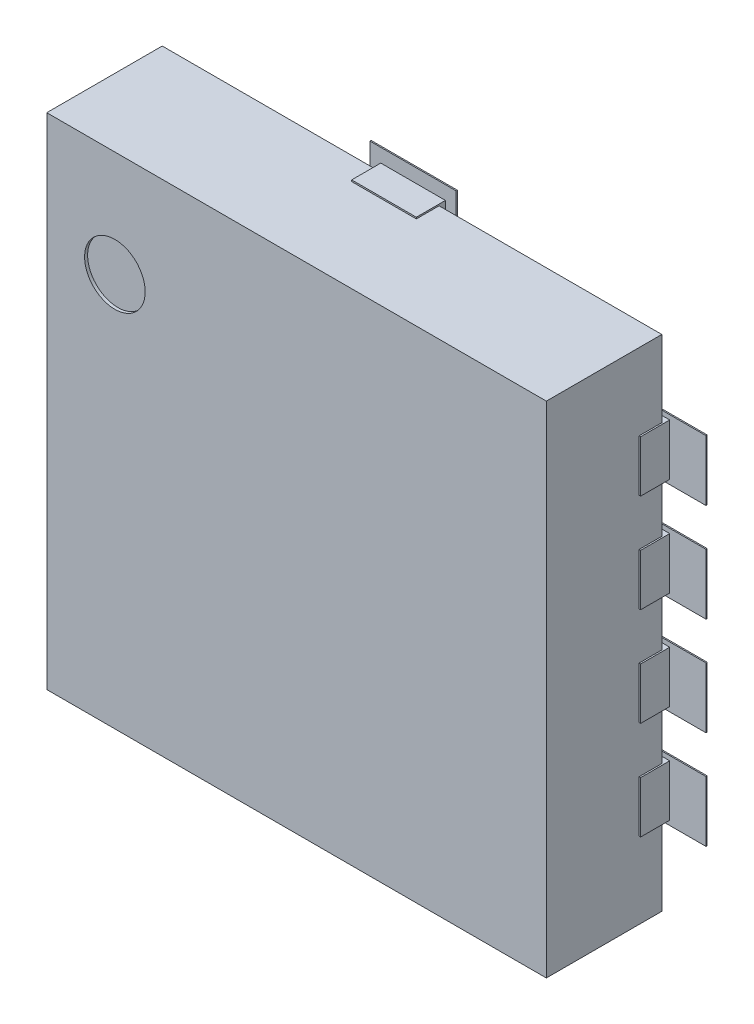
ISO-10303-21;
HEADER;
FILE_DESCRIPTION(('STEP AP214'),'2;1');
FILE_NAME('part.step','',(''),(''),'','','');
FILE_SCHEMA(('AUTOMOTIVE_DESIGN { 1 0 10303 214 1 1 1 1 }'));
ENDSEC;
DATA;
#1=APPLICATION_CONTEXT('core data for automotive mechanical design processes');
#2=APPLICATION_PROTOCOL_DEFINITION('international standard','automotive_design',2000,#1);
#3=PRODUCT_CONTEXT('',#1,'mechanical');
#4=PRODUCT('Part','Part','',(#3));
#5=PRODUCT_RELATED_PRODUCT_CATEGORY('part','',(#4));
#6=PRODUCT_DEFINITION_FORMATION('','',#4);
#7=PRODUCT_DEFINITION_CONTEXT('part definition',#1,'design');
#8=PRODUCT_DEFINITION('design','',#6,#7);
#9=PRODUCT_DEFINITION_SHAPE('','',#8);
#10=(LENGTH_UNIT() NAMED_UNIT(*) SI_UNIT(.MILLI.,.METRE.));
#11=(NAMED_UNIT(*) PLANE_ANGLE_UNIT() SI_UNIT($,.RADIAN.));
#12=(NAMED_UNIT(*) SI_UNIT($,.STERADIAN.) SOLID_ANGLE_UNIT());
#13=UNCERTAINTY_MEASURE_WITH_UNIT(LENGTH_MEASURE(1.E-05),#10,'distance_accuracy_value','');
#14=(GEOMETRIC_REPRESENTATION_CONTEXT(3) GLOBAL_UNCERTAINTY_ASSIGNED_CONTEXT((#13)) GLOBAL_UNIT_ASSIGNED_CONTEXT((#10,
#11,#12)) REPRESENTATION_CONTEXT('',''));
#15=CARTESIAN_POINT('',(0.,0.,0.));
#16=DIRECTION('',(0.,0.,1.));
#17=DIRECTION('',(1.,0.,0.));
#18=AXIS2_PLACEMENT_3D('',#15,#16,#17);
#19=CARTESIAN_POINT('',(0.,0.,0.0762));
#20=DIRECTION('',(0.,0.,1.));
#21=DIRECTION('',(1.,0.,0.));
#22=AXIS2_PLACEMENT_3D('',#19,#20,#21);
#23=PLANE('',#22);
#24=DIRECTION('',(1.,0.,0.));
#25=VECTOR('',#24,1.);
#26=CARTESIAN_POINT('',(0.,-1.75000000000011,0.0762));
#27=LINE('',#26,#25);
#28=CARTESIAN_POINT('',(-0.31999999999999,-1.75000000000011,0.0762));
#29=VERTEX_POINT('',#28);
#30=CARTESIAN_POINT('',(0.249999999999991,-1.75000000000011,0.0762));
#31=VERTEX_POINT('',#30);
#32=EDGE_CURVE('E694',#29,#31,#27,.T.);
#33=ORIENTED_EDGE('',*,*,#32,.F.);
#34=DIRECTION('',(0.,1.,0.));
#35=VECTOR('',#34,1.);
#36=CARTESIAN_POINT('',(-0.31999999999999,0.,0.0762));
#37=LINE('',#36,#35);
#38=CARTESIAN_POINT('',(-0.31999999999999,-1.22499999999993,0.0762));
#39=VERTEX_POINT('',#38);
#40=EDGE_CURVE('E710',#39,#29,#37,.F.);
#41=ORIENTED_EDGE('',*,*,#40,.F.);
#42=DIRECTION('',(1.,0.,0.));
#43=VECTOR('',#42,1.);
#44=CARTESIAN_POINT('',(0.,-1.22499999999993,0.0762));
#45=LINE('',#44,#43);
#46=CARTESIAN_POINT('',(-0.579999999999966,-1.22499999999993,0.0762));
#47=VERTEX_POINT('',#46);
#48=EDGE_CURVE('E677',#47,#39,#45,.T.);
#49=ORIENTED_EDGE('',*,*,#48,.F.);
#50=DIRECTION('',(0.,1.,0.));
#51=VECTOR('',#50,1.);
#52=CARTESIAN_POINT('',(-0.579999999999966,1.22499999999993,0.0762));
#53=LINE('',#52,#51);
#54=CARTESIAN_POINT('',(-0.579999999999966,1.22499999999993,0.0762));
#55=VERTEX_POINT('',#54);
#56=EDGE_CURVE('E824',#55,#47,#53,.F.);
#57=ORIENTED_EDGE('',*,*,#56,.F.);
#58=DIRECTION('',(1.,0.,0.));
#59=VECTOR('',#58,1.);
#60=CARTESIAN_POINT('',(-0.31999999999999,1.22499999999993,0.0762));
#61=LINE('',#60,#59);
#62=CARTESIAN_POINT('',(-0.31999999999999,1.22499999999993,0.0762));
#63=VERTEX_POINT('',#62);
#64=EDGE_CURVE('E819',#63,#55,#61,.F.);
#65=ORIENTED_EDGE('',*,*,#64,.F.);
#66=DIRECTION('',(0.,1.,0.));
#67=VECTOR('',#66,1.);
#68=CARTESIAN_POINT('',(-0.31999999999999,1.75000000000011,0.0762));
#69=LINE('',#68,#67);
#70=CARTESIAN_POINT('',(-0.31999999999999,1.75000000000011,0.0762));
#71=VERTEX_POINT('',#70);
#72=EDGE_CURVE('E814',#71,#63,#69,.F.);
#73=ORIENTED_EDGE('',*,*,#72,.F.);
#74=DIRECTION('',(1.,0.,0.));
#75=VECTOR('',#74,1.);
#76=CARTESIAN_POINT('',(0.249999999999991,1.75000000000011,0.0762));
#77=LINE('',#76,#75);
#78=CARTESIAN_POINT('',(0.249999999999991,1.75000000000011,0.0762));
#79=VERTEX_POINT('',#78);
#80=EDGE_CURVE('E809',#79,#71,#77,.F.);
#81=ORIENTED_EDGE('',*,*,#80,.F.);
#82=DIRECTION('',(0.,1.,0.));
#83=VECTOR('',#82,1.);
#84=CARTESIAN_POINT('',(0.249999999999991,1.22499999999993,0.0762));
#85=LINE('',#84,#83);
#86=CARTESIAN_POINT('',(0.249999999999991,1.22499999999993,0.0762));
#87=VERTEX_POINT('',#86);
#88=EDGE_CURVE('E804',#87,#79,#85,.T.);
#89=ORIENTED_EDGE('',*,*,#88,.F.);
#90=DIRECTION('',(1.,0.,0.));
#91=VECTOR('',#90,1.);
#92=CARTESIAN_POINT('',(1.34999999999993,1.22499999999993,0.0762));
#93=LINE('',#92,#91);
#94=CARTESIAN_POINT('',(1.34999999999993,1.22499999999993,0.0762));
#95=VERTEX_POINT('',#94);
#96=EDGE_CURVE('E799',#95,#87,#93,.F.);
#97=ORIENTED_EDGE('',*,*,#96,.F.);
#98=DIRECTION('',(0.,1.,0.));
#99=VECTOR('',#98,1.);
#100=CARTESIAN_POINT('',(1.34999999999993,1.17500000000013,0.0762));
#101=LINE('',#100,#99);
#102=CARTESIAN_POINT('',(1.34999999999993,1.17500000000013,0.0762));
#103=VERTEX_POINT('',#102);
#104=EDGE_CURVE('E794',#103,#95,#101,.T.);
#105=ORIENTED_EDGE('',*,*,#104,.F.);
#106=DIRECTION('',(1.,0.,0.));
#107=VECTOR('',#106,1.);
#108=CARTESIAN_POINT('',(1.90000000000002,1.17500000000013,0.0762));
#109=LINE('',#108,#107);
#110=CARTESIAN_POINT('',(1.90000000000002,1.17500000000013,0.0762));
#111=VERTEX_POINT('',#110);
#112=EDGE_CURVE('E789',#111,#103,#109,.F.);
#113=ORIENTED_EDGE('',*,*,#112,.F.);
#114=DIRECTION('',(0.,1.,0.));
#115=VECTOR('',#114,1.);
#116=CARTESIAN_POINT('',(1.90000000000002,0.774999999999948,0.0762));
#117=LINE('',#116,#115);
#118=CARTESIAN_POINT('',(1.90000000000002,0.774999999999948,0.0762));
#119=VERTEX_POINT('',#118);
#120=EDGE_CURVE('E784',#119,#111,#117,.T.);
#121=ORIENTED_EDGE('',*,*,#120,.F.);
#122=DIRECTION('',(1.,0.,0.));
#123=VECTOR('',#122,1.);
#124=CARTESIAN_POINT('',(1.34999999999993,0.774999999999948,0.0762));
#125=LINE('',#124,#123);
#126=CARTESIAN_POINT('',(1.34999999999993,0.774999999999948,0.0762));
#127=VERTEX_POINT('',#126);
#128=EDGE_CURVE('E779',#127,#119,#125,.T.);
#129=ORIENTED_EDGE('',*,*,#128,.F.);
#130=DIRECTION('',(0.,1.,0.));
#131=VECTOR('',#130,1.);
#132=CARTESIAN_POINT('',(1.34999999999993,0.524999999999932,0.0762));
#133=LINE('',#132,#131);
#134=CARTESIAN_POINT('',(1.34999999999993,0.524999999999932,0.0762));
#135=VERTEX_POINT('',#134);
#136=EDGE_CURVE('E774',#135,#127,#133,.T.);
#137=ORIENTED_EDGE('',*,*,#136,.F.);
#138=DIRECTION('',(1.,0.,0.));
#139=VECTOR('',#138,1.);
#140=CARTESIAN_POINT('',(1.90000000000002,0.524999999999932,0.0762));
#141=LINE('',#140,#139);
#142=CARTESIAN_POINT('',(1.90000000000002,0.524999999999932,0.0762));
#143=VERTEX_POINT('',#142);
#144=EDGE_CURVE('E769',#143,#135,#141,.F.);
#145=ORIENTED_EDGE('',*,*,#144,.F.);
#146=DIRECTION('',(0.,1.,0.));
#147=VECTOR('',#146,1.);
#148=CARTESIAN_POINT('',(1.90000000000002,0.125000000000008,0.0762));
#149=LINE('',#148,#147);
#150=CARTESIAN_POINT('',(1.90000000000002,0.125000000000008,0.0762));
#151=VERTEX_POINT('',#150);
#152=EDGE_CURVE('E764',#151,#143,#149,.T.);
#153=ORIENTED_EDGE('',*,*,#152,.F.);
#154=DIRECTION('',(1.,0.,0.));
#155=VECTOR('',#154,1.);
#156=CARTESIAN_POINT('',(1.34999999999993,0.125000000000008,0.0762));
#157=LINE('',#156,#155);
#158=CARTESIAN_POINT('',(1.34999999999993,0.125000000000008,0.0762));
#159=VERTEX_POINT('',#158);
#160=EDGE_CURVE('E759',#159,#151,#157,.T.);
#161=ORIENTED_EDGE('',*,*,#160,.F.);
#162=DIRECTION('',(0.,1.,0.));
#163=VECTOR('',#162,1.);
#164=CARTESIAN_POINT('',(1.34999999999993,-0.125000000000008,0.0762));
#165=LINE('',#164,#163);
#166=CARTESIAN_POINT('',(1.34999999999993,-0.125000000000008,0.0762));
#167=VERTEX_POINT('',#166);
#168=EDGE_CURVE('E754',#167,#159,#165,.T.);
#169=ORIENTED_EDGE('',*,*,#168,.F.);
#170=DIRECTION('',(1.,0.,0.));
#171=VECTOR('',#170,1.);
#172=CARTESIAN_POINT('',(1.90000000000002,-0.125000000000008,0.0762));
#173=LINE('',#172,#171);
#174=CARTESIAN_POINT('',(1.90000000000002,-0.125000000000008,0.0762));
#175=VERTEX_POINT('',#174);
#176=EDGE_CURVE('E749',#175,#167,#173,.F.);
#177=ORIENTED_EDGE('',*,*,#176,.F.);
#178=DIRECTION('',(0.,1.,0.));
#179=VECTOR('',#178,1.);
#180=CARTESIAN_POINT('',(1.90000000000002,-0.524999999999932,0.0762));
#181=LINE('',#180,#179);
#182=CARTESIAN_POINT('',(1.90000000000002,-0.524999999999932,0.0762));
#183=VERTEX_POINT('',#182);
#184=EDGE_CURVE('E744',#183,#175,#181,.T.);
#185=ORIENTED_EDGE('',*,*,#184,.F.);
#186=DIRECTION('',(1.,0.,0.));
#187=VECTOR('',#186,1.);
#188=CARTESIAN_POINT('',(1.34999999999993,-0.524999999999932,0.0762));
#189=LINE('',#188,#187);
#190=CARTESIAN_POINT('',(1.34999999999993,-0.524999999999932,0.0762));
#191=VERTEX_POINT('',#190);
#192=EDGE_CURVE('E739',#191,#183,#189,.T.);
#193=ORIENTED_EDGE('',*,*,#192,.F.);
#194=DIRECTION('',(0.,1.,0.));
#195=VECTOR('',#194,1.);
#196=CARTESIAN_POINT('',(1.34999999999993,-0.774999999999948,0.0762));
#197=LINE('',#196,#195);
#198=CARTESIAN_POINT('',(1.34999999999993,-0.774999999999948,0.0762));
#199=VERTEX_POINT('',#198);
#200=EDGE_CURVE('E734',#199,#191,#197,.T.);
#201=ORIENTED_EDGE('',*,*,#200,.F.);
#202=DIRECTION('',(1.,0.,0.));
#203=VECTOR('',#202,1.);
#204=CARTESIAN_POINT('',(1.90000000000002,-0.774999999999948,0.0762));
#205=LINE('',#204,#203);
#206=CARTESIAN_POINT('',(1.90000000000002,-0.774999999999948,0.0762));
#207=VERTEX_POINT('',#206);
#208=EDGE_CURVE('E729',#207,#199,#205,.F.);
#209=ORIENTED_EDGE('',*,*,#208,.F.);
#210=DIRECTION('',(0.,1.,0.));
#211=VECTOR('',#210,1.);
#212=CARTESIAN_POINT('',(1.90000000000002,-1.17500000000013,0.0762));
#213=LINE('',#212,#211);
#214=CARTESIAN_POINT('',(1.90000000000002,-1.17500000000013,0.0762));
#215=VERTEX_POINT('',#214);
#216=EDGE_CURVE('E724',#215,#207,#213,.T.);
#217=ORIENTED_EDGE('',*,*,#216,.F.);
#218=DIRECTION('',(1.,0.,0.));
#219=VECTOR('',#218,1.);
#220=CARTESIAN_POINT('',(1.34999999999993,-1.17500000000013,0.0762));
#221=LINE('',#220,#219);
#222=CARTESIAN_POINT('',(1.34999999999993,-1.17500000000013,0.0762));
#223=VERTEX_POINT('',#222);
#224=EDGE_CURVE('E719',#223,#215,#221,.T.);
#225=ORIENTED_EDGE('',*,*,#224,.F.);
#226=DIRECTION('',(0.,1.,0.));
#227=VECTOR('',#226,1.);
#228=CARTESIAN_POINT('',(1.34999999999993,-1.22499999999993,0.0762));
#229=LINE('',#228,#227);
#230=CARTESIAN_POINT('',(1.34999999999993,-1.22499999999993,0.0762));
#231=VERTEX_POINT('',#230);
#232=EDGE_CURVE('E693',#231,#223,#229,.T.);
#233=ORIENTED_EDGE('',*,*,#232,.F.);
#234=DIRECTION('',(1.,0.,0.));
#235=VECTOR('',#234,1.);
#236=CARTESIAN_POINT('',(0.,-1.22499999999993,0.0762));
#237=LINE('',#236,#235);
#238=CARTESIAN_POINT('',(0.249999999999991,-1.22499999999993,0.0762));
#239=VERTEX_POINT('',#238);
#240=EDGE_CURVE('E699',#239,#231,#237,.T.);
#241=ORIENTED_EDGE('',*,*,#240,.F.);
#242=DIRECTION('',(0.,1.,0.));
#243=VECTOR('',#242,1.);
#244=CARTESIAN_POINT('',(0.249999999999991,0.,0.0762));
#245=LINE('',#244,#243);
#246=EDGE_CURVE('E683',#31,#239,#245,.T.);
#247=ORIENTED_EDGE('',*,*,#246,.F.);
#248=EDGE_LOOP('',(#33,#41,#49,#57,#65,#73,#81,#89,#97,#105,#113,#121,#129,#137,#145,#153,#161,
#169,#177,#185,#193,#201,#209,#217,#225,#233,#241,#247));
#249=FACE_BOUND('',#248,.T.);
#250=ADVANCED_FACE('F16',(#249),#23,.F.);
#251=CARTESIAN_POINT('',(0.,0.,0.0762));
#252=DIRECTION('',(0.,0.,1.));
#253=DIRECTION('',(1.,0.,0.));
#254=AXIS2_PLACEMENT_3D('',#251,#252,#253);
#255=PLANE('',#254);
#256=DIRECTION('',(1.,0.,0.));
#257=VECTOR('',#256,1.);
#258=CARTESIAN_POINT('',(-0.801500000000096,0.521999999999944,0.0762));
#259=LINE('',#258,#257);
#260=CARTESIAN_POINT('',(-0.801500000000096,0.521999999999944,0.0762));
#261=VERTEX_POINT('',#260);
#262=CARTESIAN_POINT('',(-1.90649999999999,0.521999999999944,0.0762));
#263=VERTEX_POINT('',#262);
#264=EDGE_CURVE('E840',#261,#263,#259,.F.);
#265=ORIENTED_EDGE('',*,*,#264,.F.);
#266=DIRECTION('',(0.,1.,0.));
#267=VECTOR('',#266,1.);
#268=CARTESIAN_POINT('',(-0.801500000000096,0.127999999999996,0.0762));
#269=LINE('',#268,#267);
#270=CARTESIAN_POINT('',(-0.801500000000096,0.127999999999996,0.0762));
#271=VERTEX_POINT('',#270);
#272=EDGE_CURVE('E704',#271,#261,#269,.T.);
#273=ORIENTED_EDGE('',*,*,#272,.F.);
#274=DIRECTION('',(1.,0.,0.));
#275=VECTOR('',#274,1.);
#276=CARTESIAN_POINT('',(-1.90649999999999,0.127999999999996,0.0762));
#277=LINE('',#276,#275);
#278=CARTESIAN_POINT('',(-1.90649999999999,0.127999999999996,0.0762));
#279=VERTEX_POINT('',#278);
#280=EDGE_CURVE('E853',#279,#271,#277,.T.);
#281=ORIENTED_EDGE('',*,*,#280,.F.);
#282=DIRECTION('',(0.,1.,0.));
#283=VECTOR('',#282,1.);
#284=CARTESIAN_POINT('',(-1.90649999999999,0.521999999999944,0.0762));
#285=LINE('',#284,#283);
#286=EDGE_CURVE('E845',#263,#279,#285,.F.);
#287=ORIENTED_EDGE('',*,*,#286,.F.);
#288=EDGE_LOOP('',(#265,#273,#281,#287));
#289=FACE_BOUND('',#288,.T.);
#290=ADVANCED_FACE('F2048',(#289),#255,.F.);
#291=CARTESIAN_POINT('',(0.,0.,0.0762));
#292=DIRECTION('',(0.,0.,1.));
#293=DIRECTION('',(1.,0.,0.));
#294=AXIS2_PLACEMENT_3D('',#291,#292,#293);
#295=PLANE('',#294);
#296=DIRECTION('',(1.,0.,0.));
#297=VECTOR('',#296,1.);
#298=CARTESIAN_POINT('',(-0.801500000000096,-0.127999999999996,0.0762));
#299=LINE('',#298,#297);
#300=CARTESIAN_POINT('',(-0.801500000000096,-0.127999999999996,0.0762));
#301=VERTEX_POINT('',#300);
#302=CARTESIAN_POINT('',(-1.90649999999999,-0.127999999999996,0.0762));
#303=VERTEX_POINT('',#302);
#304=EDGE_CURVE('E861',#301,#303,#299,.F.);
#305=ORIENTED_EDGE('',*,*,#304,.F.);
#306=DIRECTION('',(0.,1.,0.));
#307=VECTOR('',#306,1.);
#308=CARTESIAN_POINT('',(-0.801500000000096,-0.521999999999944,0.0762));
#309=LINE('',#308,#307);
#310=CARTESIAN_POINT('',(-0.801500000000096,-0.521999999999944,0.0762));
#311=VERTEX_POINT('',#310);
#312=EDGE_CURVE('E856',#311,#301,#309,.T.);
#313=ORIENTED_EDGE('',*,*,#312,.F.);
#314=DIRECTION('',(1.,0.,0.));
#315=VECTOR('',#314,1.);
#316=CARTESIAN_POINT('',(-1.90649999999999,-0.521999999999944,0.0762));
#317=LINE('',#316,#315);
#318=CARTESIAN_POINT('',(-1.90649999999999,-0.521999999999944,0.0762));
#319=VERTEX_POINT('',#318);
#320=EDGE_CURVE('E874',#319,#311,#317,.T.);
#321=ORIENTED_EDGE('',*,*,#320,.F.);
#322=DIRECTION('',(0.,1.,0.));
#323=VECTOR('',#322,1.);
#324=CARTESIAN_POINT('',(-1.90649999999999,-0.127999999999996,0.0762));
#325=LINE('',#324,#323);
#326=EDGE_CURVE('E866',#303,#319,#325,.F.);
#327=ORIENTED_EDGE('',*,*,#326,.F.);
#328=EDGE_LOOP('',(#305,#313,#321,#327));
#329=FACE_BOUND('',#328,.T.);
#330=ADVANCED_FACE('F2045',(#329),#295,.F.);
#331=CARTESIAN_POINT('',(0.,0.,0.0762));
#332=DIRECTION('',(0.,0.,1.));
#333=DIRECTION('',(1.,0.,0.));
#334=AXIS2_PLACEMENT_3D('',#331,#332,#333);
#335=PLANE('',#334);
#336=DIRECTION('',(1.,0.,0.));
#337=VECTOR('',#336,1.);
#338=CARTESIAN_POINT('',(-0.801500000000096,-0.777999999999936,0.0762));
#339=LINE('',#338,#337);
#340=CARTESIAN_POINT('',(-0.801500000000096,-0.777999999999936,0.0762));
#341=VERTEX_POINT('',#340);
#342=CARTESIAN_POINT('',(-1.90649999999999,-0.777999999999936,0.0762));
#343=VERTEX_POINT('',#342);
#344=EDGE_CURVE('E882',#341,#343,#339,.F.);
#345=ORIENTED_EDGE('',*,*,#344,.F.);
#346=DIRECTION('',(0.,1.,0.));
#347=VECTOR('',#346,1.);
#348=CARTESIAN_POINT('',(-0.801500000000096,-1.17199999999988,0.0762));
#349=LINE('',#348,#347);
#350=CARTESIAN_POINT('',(-0.801500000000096,-1.17199999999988,0.0762));
#351=VERTEX_POINT('',#350);
#352=EDGE_CURVE('E877',#351,#341,#349,.T.);
#353=ORIENTED_EDGE('',*,*,#352,.F.);
#354=DIRECTION('',(1.,0.,0.));
#355=VECTOR('',#354,1.);
#356=CARTESIAN_POINT('',(-1.90649999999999,-1.17199999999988,0.0762));
#357=LINE('',#356,#355);
#358=CARTESIAN_POINT('',(-1.90649999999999,-1.17199999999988,0.0762));
#359=VERTEX_POINT('',#358);
#360=EDGE_CURVE('E895',#359,#351,#357,.T.);
#361=ORIENTED_EDGE('',*,*,#360,.F.);
#362=DIRECTION('',(0.,1.,0.));
#363=VECTOR('',#362,1.);
#364=CARTESIAN_POINT('',(-1.90649999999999,-0.777999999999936,0.0762));
#365=LINE('',#364,#363);
#366=EDGE_CURVE('E887',#343,#359,#365,.F.);
#367=ORIENTED_EDGE('',*,*,#366,.F.);
#368=EDGE_LOOP('',(#345,#353,#361,#367));
#369=FACE_BOUND('',#368,.T.);
#370=ADVANCED_FACE('F2041',(#369),#335,.F.);
#371=CARTESIAN_POINT('',(0.,0.,0.0762));
#372=DIRECTION('',(0.,0.,1.));
#373=DIRECTION('',(1.,0.,0.));
#374=AXIS2_PLACEMENT_3D('',#371,#372,#373);
#375=PLANE('',#374);
#376=DIRECTION('',(1.,0.,0.));
#377=VECTOR('',#376,1.);
#378=CARTESIAN_POINT('',(-0.801500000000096,1.17199999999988,0.0762));
#379=LINE('',#378,#377);
#380=CARTESIAN_POINT('',(-0.801500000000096,1.17199999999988,0.0762));
#381=VERTEX_POINT('',#380);
#382=CARTESIAN_POINT('',(-1.90649999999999,1.17199999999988,0.0762));
#383=VERTEX_POINT('',#382);
#384=EDGE_CURVE('E903',#381,#383,#379,.F.);
#385=ORIENTED_EDGE('',*,*,#384,.F.);
#386=DIRECTION('',(0.,1.,0.));
#387=VECTOR('',#386,1.);
#388=CARTESIAN_POINT('',(-0.801500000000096,0.777999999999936,0.0762));
#389=LINE('',#388,#387);
#390=CARTESIAN_POINT('',(-0.801500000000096,0.777999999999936,0.0762));
#391=VERTEX_POINT('',#390);
#392=EDGE_CURVE('E898',#391,#381,#389,.T.);
#393=ORIENTED_EDGE('',*,*,#392,.F.);
#394=DIRECTION('',(1.,0.,0.));
#395=VECTOR('',#394,1.);
#396=CARTESIAN_POINT('',(-1.90649999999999,0.777999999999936,0.0762));
#397=LINE('',#396,#395);
#398=CARTESIAN_POINT('',(-1.90649999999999,0.777999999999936,0.0762));
#399=VERTEX_POINT('',#398);
#400=EDGE_CURVE('E916',#399,#391,#397,.T.);
#401=ORIENTED_EDGE('',*,*,#400,.F.);
#402=DIRECTION('',(0.,1.,0.));
#403=VECTOR('',#402,1.);
#404=CARTESIAN_POINT('',(-1.90649999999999,1.17199999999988,0.0762));
#405=LINE('',#404,#403);
#406=EDGE_CURVE('E908',#383,#399,#405,.F.);
#407=ORIENTED_EDGE('',*,*,#406,.F.);
#408=EDGE_LOOP('',(#385,#393,#401,#407));
#409=FACE_BOUND('',#408,.T.);
#410=ADVANCED_FACE('F2037',(#409),#375,.F.);
#411=CARTESIAN_POINT('',(1.34999999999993,-1.22499999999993,0.0762));
#412=DIRECTION('',(1.,0.,0.));
#413=DIRECTION('',(0.,0.,-1.));
#414=AXIS2_PLACEMENT_3D('',#411,#412,#413);
#415=PLANE('',#414);
#416=DIRECTION('',(0.,0.,-1.));
#417=VECTOR('',#416,1.);
#418=CARTESIAN_POINT('',(1.34999999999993,-1.22499999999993,0.0762));
#419=LINE('',#418,#417);
#420=CARTESIAN_POINT('',(1.34999999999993,-1.22499999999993,0.0841999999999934));
#421=VERTEX_POINT('',#420);
#422=EDGE_CURVE('E705',#231,#421,#419,.F.);
#423=ORIENTED_EDGE('',*,*,#422,.F.);
#424=ORIENTED_EDGE('',*,*,#232,.T.);
#425=DIRECTION('',(0.,0.,-1.));
#426=VECTOR('',#425,1.);
#427=CARTESIAN_POINT('',(1.34999999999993,-1.17500000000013,0.0762));
#428=LINE('',#427,#426);
#429=CARTESIAN_POINT('',(1.34999999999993,-1.17500000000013,0.0841999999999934));
#430=VERTEX_POINT('',#429);
#431=EDGE_CURVE('E716',#430,#223,#428,.T.);
#432=ORIENTED_EDGE('',*,*,#431,.F.);
#433=DIRECTION('',(0.,1.,0.));
#434=VECTOR('',#433,1.);
#435=CARTESIAN_POINT('',(1.34999999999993,0.,0.0841999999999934));
#436=LINE('',#435,#434);
#437=EDGE_CURVE('E919',#421,#430,#436,.T.);
#438=ORIENTED_EDGE('',*,*,#437,.F.);
#439=EDGE_LOOP('',(#423,#424,#432,#438));
#440=FACE_BOUND('',#439,.T.);
#441=ADVANCED_FACE('F2033',(#440),#415,.T.);
#442=CARTESIAN_POINT('',(1.34999999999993,-1.17500000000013,0.0762));
#443=DIRECTION('',(0.,-1.,0.));
#444=DIRECTION('',(0.,0.,-1.));
#445=AXIS2_PLACEMENT_3D('',#442,#443,#444);
#446=PLANE('',#445);
#447=ORIENTED_EDGE('',*,*,#431,.T.);
#448=ORIENTED_EDGE('',*,*,#224,.T.);
#449=DIRECTION('',(0.,0.,-1.));
#450=VECTOR('',#449,1.);
#451=CARTESIAN_POINT('',(1.90000000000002,-1.17500000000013,0.0762));
#452=LINE('',#451,#450);
#453=CARTESIAN_POINT('',(1.90000000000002,-1.17500000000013,0.0841999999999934));
#454=VERTEX_POINT('',#453);
#455=EDGE_CURVE('E721',#454,#215,#452,.T.);
#456=ORIENTED_EDGE('',*,*,#455,.F.);
#457=DIRECTION('',(1.,0.,0.));
#458=VECTOR('',#457,1.);
#459=CARTESIAN_POINT('',(0.,-1.17500000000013,0.0841999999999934));
#460=LINE('',#459,#458);
#461=EDGE_CURVE('E922',#430,#454,#460,.T.);
#462=ORIENTED_EDGE('',*,*,#461,.F.);
#463=EDGE_LOOP('',(#447,#448,#456,#462));
#464=FACE_BOUND('',#463,.T.);
#465=ADVANCED_FACE('F2029',(#464),#446,.T.);
#466=CARTESIAN_POINT('',(1.90000000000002,-1.17500000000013,0.0762));
#467=DIRECTION('',(1.,0.,0.));
#468=DIRECTION('',(0.,0.,-1.));
#469=AXIS2_PLACEMENT_3D('',#466,#467,#468);
#470=PLANE('',#469);
#471=ORIENTED_EDGE('',*,*,#455,.T.);
#472=ORIENTED_EDGE('',*,*,#216,.T.);
#473=DIRECTION('',(0.,0.,1.));
#474=VECTOR('',#473,1.);
#475=CARTESIAN_POINT('',(1.90000000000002,-0.774999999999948,0.0762));
#476=LINE('',#475,#474);
#477=CARTESIAN_POINT('',(1.90000000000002,-0.774999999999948,0.0841999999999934));
#478=VERTEX_POINT('',#477);
#479=EDGE_CURVE('E726',#478,#207,#476,.F.);
#480=ORIENTED_EDGE('',*,*,#479,.F.);
#481=DIRECTION('',(0.,1.,0.));
#482=VECTOR('',#481,1.);
#483=CARTESIAN_POINT('',(1.90000000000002,0.,0.0841999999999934));
#484=LINE('',#483,#482);
#485=EDGE_CURVE('E925',#454,#478,#484,.T.);
#486=ORIENTED_EDGE('',*,*,#485,.F.);
#487=EDGE_LOOP('',(#471,#472,#480,#486));
#488=FACE_BOUND('',#487,.T.);
#489=ADVANCED_FACE('F2025',(#488),#470,.T.);
#490=CARTESIAN_POINT('',(1.90000000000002,-0.774999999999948,0.0762));
#491=DIRECTION('',(0.,1.,0.));
#492=DIRECTION('',(0.,0.,1.));
#493=AXIS2_PLACEMENT_3D('',#490,#491,#492);
#494=PLANE('',#493);
#495=ORIENTED_EDGE('',*,*,#479,.T.);
#496=ORIENTED_EDGE('',*,*,#208,.T.);
#497=DIRECTION('',(0.,0.,-1.));
#498=VECTOR('',#497,1.);
#499=CARTESIAN_POINT('',(1.34999999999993,-0.774999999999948,0.0762));
#500=LINE('',#499,#498);
#501=CARTESIAN_POINT('',(1.34999999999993,-0.774999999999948,0.0841999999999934));
#502=VERTEX_POINT('',#501);
#503=EDGE_CURVE('E731',#502,#199,#500,.T.);
#504=ORIENTED_EDGE('',*,*,#503,.F.);
#505=DIRECTION('',(1.,0.,0.));
#506=VECTOR('',#505,1.);
#507=CARTESIAN_POINT('',(0.,-0.774999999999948,0.0841999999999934));
#508=LINE('',#507,#506);
#509=EDGE_CURVE('E928',#478,#502,#508,.F.);
#510=ORIENTED_EDGE('',*,*,#509,.F.);
#511=EDGE_LOOP('',(#495,#496,#504,#510));
#512=FACE_BOUND('',#511,.T.);
#513=ADVANCED_FACE('F2021',(#512),#494,.T.);
#514=CARTESIAN_POINT('',(1.34999999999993,-0.774999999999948,0.0762));
#515=DIRECTION('',(1.,0.,0.));
#516=DIRECTION('',(0.,0.,-1.));
#517=AXIS2_PLACEMENT_3D('',#514,#515,#516);
#518=PLANE('',#517);
#519=ORIENTED_EDGE('',*,*,#503,.T.);
#520=ORIENTED_EDGE('',*,*,#200,.T.);
#521=DIRECTION('',(0.,0.,-1.));
#522=VECTOR('',#521,1.);
#523=CARTESIAN_POINT('',(1.34999999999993,-0.524999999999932,0.0762));
#524=LINE('',#523,#522);
#525=CARTESIAN_POINT('',(1.34999999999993,-0.524999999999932,0.0841999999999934));
#526=VERTEX_POINT('',#525);
#527=EDGE_CURVE('E736',#526,#191,#524,.T.);
#528=ORIENTED_EDGE('',*,*,#527,.F.);
#529=DIRECTION('',(0.,1.,0.));
#530=VECTOR('',#529,1.);
#531=CARTESIAN_POINT('',(1.34999999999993,0.,0.0841999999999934));
#532=LINE('',#531,#530);
#533=EDGE_CURVE('E931',#502,#526,#532,.T.);
#534=ORIENTED_EDGE('',*,*,#533,.F.);
#535=EDGE_LOOP('',(#519,#520,#528,#534));
#536=FACE_BOUND('',#535,.T.);
#537=ADVANCED_FACE('F2017',(#536),#518,.T.);
#538=CARTESIAN_POINT('',(1.34999999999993,-0.524999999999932,0.0762));
#539=DIRECTION('',(0.,-1.,0.));
#540=DIRECTION('',(0.,0.,-1.));
#541=AXIS2_PLACEMENT_3D('',#538,#539,#540);
#542=PLANE('',#541);
#543=ORIENTED_EDGE('',*,*,#527,.T.);
#544=ORIENTED_EDGE('',*,*,#192,.T.);
#545=DIRECTION('',(0.,0.,-1.));
#546=VECTOR('',#545,1.);
#547=CARTESIAN_POINT('',(1.90000000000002,-0.524999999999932,0.0762));
#548=LINE('',#547,#546);
#549=CARTESIAN_POINT('',(1.90000000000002,-0.524999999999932,0.0841999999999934));
#550=VERTEX_POINT('',#549);
#551=EDGE_CURVE('E741',#550,#183,#548,.T.);
#552=ORIENTED_EDGE('',*,*,#551,.F.);
#553=DIRECTION('',(1.,0.,0.));
#554=VECTOR('',#553,1.);
#555=CARTESIAN_POINT('',(0.,-0.524999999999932,0.0841999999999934));
#556=LINE('',#555,#554);
#557=EDGE_CURVE('E934',#526,#550,#556,.T.);
#558=ORIENTED_EDGE('',*,*,#557,.F.);
#559=EDGE_LOOP('',(#543,#544,#552,#558));
#560=FACE_BOUND('',#559,.T.);
#561=ADVANCED_FACE('F2013',(#560),#542,.T.);
#562=CARTESIAN_POINT('',(1.90000000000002,-0.524999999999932,0.0762));
#563=DIRECTION('',(1.,0.,0.));
#564=DIRECTION('',(0.,0.,-1.));
#565=AXIS2_PLACEMENT_3D('',#562,#563,#564);
#566=PLANE('',#565);
#567=ORIENTED_EDGE('',*,*,#551,.T.);
#568=ORIENTED_EDGE('',*,*,#184,.T.);
#569=DIRECTION('',(0.,0.,1.));
#570=VECTOR('',#569,1.);
#571=CARTESIAN_POINT('',(1.90000000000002,-0.125000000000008,0.0762));
#572=LINE('',#571,#570);
#573=CARTESIAN_POINT('',(1.90000000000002,-0.125000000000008,0.0841999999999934));
#574=VERTEX_POINT('',#573);
#575=EDGE_CURVE('E746',#574,#175,#572,.F.);
#576=ORIENTED_EDGE('',*,*,#575,.F.);
#577=DIRECTION('',(0.,1.,0.));
#578=VECTOR('',#577,1.);
#579=CARTESIAN_POINT('',(1.90000000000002,0.,0.0841999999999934));
#580=LINE('',#579,#578);
#581=EDGE_CURVE('E937',#550,#574,#580,.T.);
#582=ORIENTED_EDGE('',*,*,#581,.F.);
#583=EDGE_LOOP('',(#567,#568,#576,#582));
#584=FACE_BOUND('',#583,.T.);
#585=ADVANCED_FACE('F2009',(#584),#566,.T.);
#586=CARTESIAN_POINT('',(1.90000000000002,-0.125000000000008,0.0762));
#587=DIRECTION('',(0.,1.,0.));
#588=DIRECTION('',(0.,0.,1.));
#589=AXIS2_PLACEMENT_3D('',#586,#587,#588);
#590=PLANE('',#589);
#591=ORIENTED_EDGE('',*,*,#575,.T.);
#592=ORIENTED_EDGE('',*,*,#176,.T.);
#593=DIRECTION('',(0.,0.,-1.));
#594=VECTOR('',#593,1.);
#595=CARTESIAN_POINT('',(1.34999999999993,-0.125000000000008,0.0762));
#596=LINE('',#595,#594);
#597=CARTESIAN_POINT('',(1.34999999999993,-0.125000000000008,0.0841999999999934));
#598=VERTEX_POINT('',#597);
#599=EDGE_CURVE('E751',#598,#167,#596,.T.);
#600=ORIENTED_EDGE('',*,*,#599,.F.);
#601=DIRECTION('',(1.,0.,0.));
#602=VECTOR('',#601,1.);
#603=CARTESIAN_POINT('',(0.,-0.125000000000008,0.0841999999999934));
#604=LINE('',#603,#602);
#605=EDGE_CURVE('E940',#574,#598,#604,.F.);
#606=ORIENTED_EDGE('',*,*,#605,.F.);
#607=EDGE_LOOP('',(#591,#592,#600,#606));
#608=FACE_BOUND('',#607,.T.);
#609=ADVANCED_FACE('F2005',(#608),#590,.T.);
#610=CARTESIAN_POINT('',(1.34999999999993,-0.125000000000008,0.0762));
#611=DIRECTION('',(1.,0.,0.));
#612=DIRECTION('',(0.,0.,-1.));
#613=AXIS2_PLACEMENT_3D('',#610,#611,#612);
#614=PLANE('',#613);
#615=ORIENTED_EDGE('',*,*,#599,.T.);
#616=ORIENTED_EDGE('',*,*,#168,.T.);
#617=DIRECTION('',(0.,0.,-1.));
#618=VECTOR('',#617,1.);
#619=CARTESIAN_POINT('',(1.34999999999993,0.125000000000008,0.0762));
#620=LINE('',#619,#618);
#621=CARTESIAN_POINT('',(1.34999999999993,0.125000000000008,0.0841999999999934));
#622=VERTEX_POINT('',#621);
#623=EDGE_CURVE('E756',#622,#159,#620,.T.);
#624=ORIENTED_EDGE('',*,*,#623,.F.);
#625=DIRECTION('',(0.,1.,0.));
#626=VECTOR('',#625,1.);
#627=CARTESIAN_POINT('',(1.34999999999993,0.,0.0841999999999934));
#628=LINE('',#627,#626);
#629=EDGE_CURVE('E943',#598,#622,#628,.T.);
#630=ORIENTED_EDGE('',*,*,#629,.F.);
#631=EDGE_LOOP('',(#615,#616,#624,#630));
#632=FACE_BOUND('',#631,.T.);
#633=ADVANCED_FACE('F2001',(#632),#614,.T.);
#634=CARTESIAN_POINT('',(1.34999999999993,0.125000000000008,0.0762));
#635=DIRECTION('',(0.,-1.,0.));
#636=DIRECTION('',(0.,0.,-1.));
#637=AXIS2_PLACEMENT_3D('',#634,#635,#636);
#638=PLANE('',#637);
#639=ORIENTED_EDGE('',*,*,#623,.T.);
#640=ORIENTED_EDGE('',*,*,#160,.T.);
#641=DIRECTION('',(0.,0.,-1.));
#642=VECTOR('',#641,1.);
#643=CARTESIAN_POINT('',(1.90000000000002,0.125000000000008,0.0762));
#644=LINE('',#643,#642);
#645=CARTESIAN_POINT('',(1.90000000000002,0.125000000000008,0.0841999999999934));
#646=VERTEX_POINT('',#645);
#647=EDGE_CURVE('E761',#646,#151,#644,.T.);
#648=ORIENTED_EDGE('',*,*,#647,.F.);
#649=DIRECTION('',(1.,0.,0.));
#650=VECTOR('',#649,1.);
#651=CARTESIAN_POINT('',(0.,0.125000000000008,0.0841999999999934));
#652=LINE('',#651,#650);
#653=EDGE_CURVE('E946',#622,#646,#652,.T.);
#654=ORIENTED_EDGE('',*,*,#653,.F.);
#655=EDGE_LOOP('',(#639,#640,#648,#654));
#656=FACE_BOUND('',#655,.T.);
#657=ADVANCED_FACE('F1997',(#656),#638,.T.);
#658=CARTESIAN_POINT('',(1.90000000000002,0.125000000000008,0.0762));
#659=DIRECTION('',(1.,0.,0.));
#660=DIRECTION('',(0.,0.,-1.));
#661=AXIS2_PLACEMENT_3D('',#658,#659,#660);
#662=PLANE('',#661);
#663=ORIENTED_EDGE('',*,*,#647,.T.);
#664=ORIENTED_EDGE('',*,*,#152,.T.);
#665=DIRECTION('',(0.,0.,1.));
#666=VECTOR('',#665,1.);
#667=CARTESIAN_POINT('',(1.90000000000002,0.524999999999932,0.0762));
#668=LINE('',#667,#666);
#669=CARTESIAN_POINT('',(1.90000000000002,0.524999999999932,0.0841999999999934));
#670=VERTEX_POINT('',#669);
#671=EDGE_CURVE('E766',#670,#143,#668,.F.);
#672=ORIENTED_EDGE('',*,*,#671,.F.);
#673=DIRECTION('',(0.,1.,0.));
#674=VECTOR('',#673,1.);
#675=CARTESIAN_POINT('',(1.90000000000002,0.,0.0841999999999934));
#676=LINE('',#675,#674);
#677=EDGE_CURVE('E949',#646,#670,#676,.T.);
#678=ORIENTED_EDGE('',*,*,#677,.F.);
#679=EDGE_LOOP('',(#663,#664,#672,#678));
#680=FACE_BOUND('',#679,.T.);
#681=ADVANCED_FACE('F1993',(#680),#662,.T.);
#682=CARTESIAN_POINT('',(1.90000000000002,0.524999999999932,0.0762));
#683=DIRECTION('',(0.,1.,0.));
#684=DIRECTION('',(0.,0.,1.));
#685=AXIS2_PLACEMENT_3D('',#682,#683,#684);
#686=PLANE('',#685);
#687=ORIENTED_EDGE('',*,*,#671,.T.);
#688=ORIENTED_EDGE('',*,*,#144,.T.);
#689=DIRECTION('',(0.,0.,-1.));
#690=VECTOR('',#689,1.);
#691=CARTESIAN_POINT('',(1.34999999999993,0.524999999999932,0.0762));
#692=LINE('',#691,#690);
#693=CARTESIAN_POINT('',(1.34999999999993,0.524999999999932,0.0841999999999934));
#694=VERTEX_POINT('',#693);
#695=EDGE_CURVE('E771',#694,#135,#692,.T.);
#696=ORIENTED_EDGE('',*,*,#695,.F.);
#697=DIRECTION('',(1.,0.,0.));
#698=VECTOR('',#697,1.);
#699=CARTESIAN_POINT('',(0.,0.524999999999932,0.0841999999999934));
#700=LINE('',#699,#698);
#701=EDGE_CURVE('E952',#670,#694,#700,.F.);
#702=ORIENTED_EDGE('',*,*,#701,.F.);
#703=EDGE_LOOP('',(#687,#688,#696,#702));
#704=FACE_BOUND('',#703,.T.);
#705=ADVANCED_FACE('F1989',(#704),#686,.T.);
#706=CARTESIAN_POINT('',(1.34999999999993,0.524999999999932,0.0762));
#707=DIRECTION('',(1.,0.,0.));
#708=DIRECTION('',(0.,0.,-1.));
#709=AXIS2_PLACEMENT_3D('',#706,#707,#708);
#710=PLANE('',#709);
#711=ORIENTED_EDGE('',*,*,#695,.T.);
#712=ORIENTED_EDGE('',*,*,#136,.T.);
#713=DIRECTION('',(0.,0.,-1.));
#714=VECTOR('',#713,1.);
#715=CARTESIAN_POINT('',(1.34999999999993,0.774999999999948,0.0762));
#716=LINE('',#715,#714);
#717=CARTESIAN_POINT('',(1.34999999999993,0.774999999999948,0.0841999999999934));
#718=VERTEX_POINT('',#717);
#719=EDGE_CURVE('E776',#718,#127,#716,.T.);
#720=ORIENTED_EDGE('',*,*,#719,.F.);
#721=DIRECTION('',(0.,1.,0.));
#722=VECTOR('',#721,1.);
#723=CARTESIAN_POINT('',(1.34999999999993,0.,0.0841999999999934));
#724=LINE('',#723,#722);
#725=EDGE_CURVE('E955',#694,#718,#724,.T.);
#726=ORIENTED_EDGE('',*,*,#725,.F.);
#727=EDGE_LOOP('',(#711,#712,#720,#726));
#728=FACE_BOUND('',#727,.T.);
#729=ADVANCED_FACE('F1985',(#728),#710,.T.);
#730=CARTESIAN_POINT('',(1.34999999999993,0.774999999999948,0.0762));
#731=DIRECTION('',(0.,-1.,0.));
#732=DIRECTION('',(0.,0.,-1.));
#733=AXIS2_PLACEMENT_3D('',#730,#731,#732);
#734=PLANE('',#733);
#735=ORIENTED_EDGE('',*,*,#719,.T.);
#736=ORIENTED_EDGE('',*,*,#128,.T.);
#737=DIRECTION('',(0.,0.,-1.));
#738=VECTOR('',#737,1.);
#739=CARTESIAN_POINT('',(1.90000000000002,0.774999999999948,0.0762));
#740=LINE('',#739,#738);
#741=CARTESIAN_POINT('',(1.90000000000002,0.774999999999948,0.0841999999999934));
#742=VERTEX_POINT('',#741);
#743=EDGE_CURVE('E781',#742,#119,#740,.T.);
#744=ORIENTED_EDGE('',*,*,#743,.F.);
#745=DIRECTION('',(1.,0.,0.));
#746=VECTOR('',#745,1.);
#747=CARTESIAN_POINT('',(0.,0.774999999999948,0.0841999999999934));
#748=LINE('',#747,#746);
#749=EDGE_CURVE('E958',#718,#742,#748,.T.);
#750=ORIENTED_EDGE('',*,*,#749,.F.);
#751=EDGE_LOOP('',(#735,#736,#744,#750));
#752=FACE_BOUND('',#751,.T.);
#753=ADVANCED_FACE('F1981',(#752),#734,.T.);
#754=CARTESIAN_POINT('',(1.90000000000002,0.774999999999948,0.0762));
#755=DIRECTION('',(1.,0.,0.));
#756=DIRECTION('',(0.,0.,-1.));
#757=AXIS2_PLACEMENT_3D('',#754,#755,#756);
#758=PLANE('',#757);
#759=ORIENTED_EDGE('',*,*,#743,.T.);
#760=ORIENTED_EDGE('',*,*,#120,.T.);
#761=DIRECTION('',(0.,0.,1.));
#762=VECTOR('',#761,1.);
#763=CARTESIAN_POINT('',(1.90000000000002,1.17500000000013,0.0762));
#764=LINE('',#763,#762);
#765=CARTESIAN_POINT('',(1.90000000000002,1.17500000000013,0.0841999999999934));
#766=VERTEX_POINT('',#765);
#767=EDGE_CURVE('E786',#766,#111,#764,.F.);
#768=ORIENTED_EDGE('',*,*,#767,.F.);
#769=DIRECTION('',(0.,1.,0.));
#770=VECTOR('',#769,1.);
#771=CARTESIAN_POINT('',(1.90000000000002,0.,0.0841999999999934));
#772=LINE('',#771,#770);
#773=EDGE_CURVE('E961',#742,#766,#772,.T.);
#774=ORIENTED_EDGE('',*,*,#773,.F.);
#775=EDGE_LOOP('',(#759,#760,#768,#774));
#776=FACE_BOUND('',#775,.T.);
#777=ADVANCED_FACE('F1977',(#776),#758,.T.);
#778=CARTESIAN_POINT('',(1.90000000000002,1.17500000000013,0.0762));
#779=DIRECTION('',(0.,1.,0.));
#780=DIRECTION('',(0.,0.,1.));
#781=AXIS2_PLACEMENT_3D('',#778,#779,#780);
#782=PLANE('',#781);
#783=ORIENTED_EDGE('',*,*,#767,.T.);
#784=ORIENTED_EDGE('',*,*,#112,.T.);
#785=DIRECTION('',(0.,0.,-1.));
#786=VECTOR('',#785,1.);
#787=CARTESIAN_POINT('',(1.34999999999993,1.17500000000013,0.0762));
#788=LINE('',#787,#786);
#789=CARTESIAN_POINT('',(1.34999999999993,1.17500000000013,0.0841999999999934));
#790=VERTEX_POINT('',#789);
#791=EDGE_CURVE('E791',#790,#103,#788,.T.);
#792=ORIENTED_EDGE('',*,*,#791,.F.);
#793=DIRECTION('',(1.,0.,0.));
#794=VECTOR('',#793,1.);
#795=CARTESIAN_POINT('',(0.,1.17500000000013,0.0841999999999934));
#796=LINE('',#795,#794);
#797=EDGE_CURVE('E964',#766,#790,#796,.F.);
#798=ORIENTED_EDGE('',*,*,#797,.F.);
#799=EDGE_LOOP('',(#783,#784,#792,#798));
#800=FACE_BOUND('',#799,.T.);
#801=ADVANCED_FACE('F1973',(#800),#782,.T.);
#802=CARTESIAN_POINT('',(1.34999999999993,1.17500000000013,0.0762));
#803=DIRECTION('',(1.,0.,0.));
#804=DIRECTION('',(0.,0.,-1.));
#805=AXIS2_PLACEMENT_3D('',#802,#803,#804);
#806=PLANE('',#805);
#807=ORIENTED_EDGE('',*,*,#791,.T.);
#808=ORIENTED_EDGE('',*,*,#104,.T.);
#809=DIRECTION('',(0.,0.,1.));
#810=VECTOR('',#809,1.);
#811=CARTESIAN_POINT('',(1.34999999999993,1.22499999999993,0.0762));
#812=LINE('',#811,#810);
#813=CARTESIAN_POINT('',(1.34999999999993,1.22499999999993,0.0841999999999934));
#814=VERTEX_POINT('',#813);
#815=EDGE_CURVE('E796',#814,#95,#812,.F.);
#816=ORIENTED_EDGE('',*,*,#815,.F.);
#817=DIRECTION('',(0.,1.,0.));
#818=VECTOR('',#817,1.);
#819=CARTESIAN_POINT('',(1.34999999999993,0.,0.0841999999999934));
#820=LINE('',#819,#818);
#821=EDGE_CURVE('E967',#790,#814,#820,.T.);
#822=ORIENTED_EDGE('',*,*,#821,.F.);
#823=EDGE_LOOP('',(#807,#808,#816,#822));
#824=FACE_BOUND('',#823,.T.);
#825=ADVANCED_FACE('F1969',(#824),#806,.T.);
#826=CARTESIAN_POINT('',(1.34999999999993,1.22499999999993,0.0762));
#827=DIRECTION('',(0.,1.,0.));
#828=DIRECTION('',(0.,0.,1.));
#829=AXIS2_PLACEMENT_3D('',#826,#827,#828);
#830=PLANE('',#829);
#831=ORIENTED_EDGE('',*,*,#815,.T.);
#832=ORIENTED_EDGE('',*,*,#96,.T.);
#833=DIRECTION('',(0.,0.,-1.));
#834=VECTOR('',#833,1.);
#835=CARTESIAN_POINT('',(0.249999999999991,1.22499999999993,0.0762));
#836=LINE('',#835,#834);
#837=CARTESIAN_POINT('',(0.249999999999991,1.22499999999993,0.0841999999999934));
#838=VERTEX_POINT('',#837);
#839=EDGE_CURVE('E801',#838,#87,#836,.T.);
#840=ORIENTED_EDGE('',*,*,#839,.F.);
#841=DIRECTION('',(1.,0.,0.));
#842=VECTOR('',#841,1.);
#843=CARTESIAN_POINT('',(0.,1.22499999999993,0.0841999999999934));
#844=LINE('',#843,#842);
#845=EDGE_CURVE('E970',#814,#838,#844,.F.);
#846=ORIENTED_EDGE('',*,*,#845,.F.);
#847=EDGE_LOOP('',(#831,#832,#840,#846));
#848=FACE_BOUND('',#847,.T.);
#849=ADVANCED_FACE('F1965',(#848),#830,.T.);
#850=CARTESIAN_POINT('',(0.249999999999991,1.22499999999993,0.0762));
#851=DIRECTION('',(1.,0.,0.));
#852=DIRECTION('',(0.,0.,-1.));
#853=AXIS2_PLACEMENT_3D('',#850,#851,#852);
#854=PLANE('',#853);
#855=ORIENTED_EDGE('',*,*,#839,.T.);
#856=ORIENTED_EDGE('',*,*,#88,.T.);
#857=DIRECTION('',(0.,0.,1.));
#858=VECTOR('',#857,1.);
#859=CARTESIAN_POINT('',(0.249999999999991,1.75000000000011,0.0762));
#860=LINE('',#859,#858);
#861=CARTESIAN_POINT('',(0.249999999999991,1.75000000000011,0.0841999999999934));
#862=VERTEX_POINT('',#861);
#863=EDGE_CURVE('E806',#862,#79,#860,.F.);
#864=ORIENTED_EDGE('',*,*,#863,.F.);
#865=DIRECTION('',(0.,1.,0.));
#866=VECTOR('',#865,1.);
#867=CARTESIAN_POINT('',(0.249999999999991,0.,0.0841999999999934));
#868=LINE('',#867,#866);
#869=EDGE_CURVE('E973',#838,#862,#868,.T.);
#870=ORIENTED_EDGE('',*,*,#869,.F.);
#871=EDGE_LOOP('',(#855,#856,#864,#870));
#872=FACE_BOUND('',#871,.T.);
#873=ADVANCED_FACE('F1961',(#872),#854,.T.);
#874=CARTESIAN_POINT('',(0.249999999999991,1.75000000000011,0.0762));
#875=DIRECTION('',(0.,1.,0.));
#876=DIRECTION('',(0.,0.,1.));
#877=AXIS2_PLACEMENT_3D('',#874,#875,#876);
#878=PLANE('',#877);
#879=ORIENTED_EDGE('',*,*,#863,.T.);
#880=ORIENTED_EDGE('',*,*,#80,.T.);
#881=DIRECTION('',(0.,0.,1.));
#882=VECTOR('',#881,1.);
#883=CARTESIAN_POINT('',(-0.31999999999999,1.75000000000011,0.0762));
#884=LINE('',#883,#882);
#885=CARTESIAN_POINT('',(-0.31999999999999,1.75000000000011,0.0841999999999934));
#886=VERTEX_POINT('',#885);
#887=EDGE_CURVE('E811',#886,#71,#884,.F.);
#888=ORIENTED_EDGE('',*,*,#887,.F.);
#889=DIRECTION('',(1.,0.,0.));
#890=VECTOR('',#889,1.);
#891=CARTESIAN_POINT('',(0.,1.75000000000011,0.0841999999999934));
#892=LINE('',#891,#890);
#893=EDGE_CURVE('E976',#862,#886,#892,.F.);
#894=ORIENTED_EDGE('',*,*,#893,.F.);
#895=EDGE_LOOP('',(#879,#880,#888,#894));
#896=FACE_BOUND('',#895,.T.);
#897=ADVANCED_FACE('F1957',(#896),#878,.T.);
#898=CARTESIAN_POINT('',(-0.31999999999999,1.75000000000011,0.0762));
#899=DIRECTION('',(-1.,0.,0.));
#900=DIRECTION('',(0.,0.,1.));
#901=AXIS2_PLACEMENT_3D('',#898,#899,#900);
#902=PLANE('',#901);
#903=ORIENTED_EDGE('',*,*,#887,.T.);
#904=ORIENTED_EDGE('',*,*,#72,.T.);
#905=DIRECTION('',(0.,0.,1.));
#906=VECTOR('',#905,1.);
#907=CARTESIAN_POINT('',(-0.31999999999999,1.22499999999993,0.0762));
#908=LINE('',#907,#906);
#909=CARTESIAN_POINT('',(-0.31999999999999,1.22499999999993,0.0841999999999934));
#910=VERTEX_POINT('',#909);
#911=EDGE_CURVE('E816',#910,#63,#908,.F.);
#912=ORIENTED_EDGE('',*,*,#911,.F.);
#913=DIRECTION('',(0.,1.,0.));
#914=VECTOR('',#913,1.);
#915=CARTESIAN_POINT('',(-0.31999999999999,0.,0.0841999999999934));
#916=LINE('',#915,#914);
#917=EDGE_CURVE('E979',#886,#910,#916,.F.);
#918=ORIENTED_EDGE('',*,*,#917,.F.);
#919=EDGE_LOOP('',(#903,#904,#912,#918));
#920=FACE_BOUND('',#919,.T.);
#921=ADVANCED_FACE('F1953',(#920),#902,.T.);
#922=CARTESIAN_POINT('',(-0.31999999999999,1.22499999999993,0.0762));
#923=DIRECTION('',(0.,1.,0.));
#924=DIRECTION('',(0.,0.,1.));
#925=AXIS2_PLACEMENT_3D('',#922,#923,#924);
#926=PLANE('',#925);
#927=ORIENTED_EDGE('',*,*,#911,.T.);
#928=ORIENTED_EDGE('',*,*,#64,.T.);
#929=DIRECTION('',(0.,0.,1.));
#930=VECTOR('',#929,1.);
#931=CARTESIAN_POINT('',(-0.579999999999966,1.22499999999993,0.0762));
#932=LINE('',#931,#930);
#933=CARTESIAN_POINT('',(-0.579999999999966,1.22499999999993,0.0841999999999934));
#934=VERTEX_POINT('',#933);
#935=EDGE_CURVE('E821',#934,#55,#932,.F.);
#936=ORIENTED_EDGE('',*,*,#935,.F.);
#937=DIRECTION('',(1.,0.,0.));
#938=VECTOR('',#937,1.);
#939=CARTESIAN_POINT('',(0.,1.22499999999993,0.0841999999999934));
#940=LINE('',#939,#938);
#941=EDGE_CURVE('E982',#910,#934,#940,.F.);
#942=ORIENTED_EDGE('',*,*,#941,.F.);
#943=EDGE_LOOP('',(#927,#928,#936,#942));
#944=FACE_BOUND('',#943,.T.);
#945=ADVANCED_FACE('F1949',(#944),#926,.T.);
#946=CARTESIAN_POINT('',(-0.579999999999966,1.22499999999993,0.0762));
#947=DIRECTION('',(-1.,0.,0.));
#948=DIRECTION('',(0.,0.,1.));
#949=AXIS2_PLACEMENT_3D('',#946,#947,#948);
#950=PLANE('',#949);
#951=ORIENTED_EDGE('',*,*,#935,.T.);
#952=ORIENTED_EDGE('',*,*,#56,.T.);
#953=DIRECTION('',(0.,0.,-1.));
#954=VECTOR('',#953,1.);
#955=CARTESIAN_POINT('',(-0.579999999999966,-1.22499999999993,0.0762));
#956=LINE('',#955,#954);
#957=CARTESIAN_POINT('',(-0.579999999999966,-1.22499999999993,0.0841999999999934));
#958=VERTEX_POINT('',#957);
#959=EDGE_CURVE('E827',#958,#47,#956,.T.);
#960=ORIENTED_EDGE('',*,*,#959,.F.);
#961=DIRECTION('',(0.,1.,0.));
#962=VECTOR('',#961,1.);
#963=CARTESIAN_POINT('',(-0.579999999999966,0.,0.0841999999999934));
#964=LINE('',#963,#962);
#965=EDGE_CURVE('E985',#934,#958,#964,.F.);
#966=ORIENTED_EDGE('',*,*,#965,.F.);
#967=EDGE_LOOP('',(#951,#952,#960,#966));
#968=FACE_BOUND('',#967,.T.);
#969=ADVANCED_FACE('F1946',(#968),#950,.T.);
#970=CARTESIAN_POINT('',(-0.579999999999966,-1.22499999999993,0.0762));
#971=DIRECTION('',(0.,-1.,0.));
#972=DIRECTION('',(0.,0.,-1.));
#973=AXIS2_PLACEMENT_3D('',#970,#971,#972);
#974=PLANE('',#973);
#975=ORIENTED_EDGE('',*,*,#959,.T.);
#976=ORIENTED_EDGE('',*,*,#48,.T.);
#977=DIRECTION('',(0.,0.,1.));
#978=VECTOR('',#977,1.);
#979=CARTESIAN_POINT('',(-0.31999999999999,-1.22499999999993,0.0762));
#980=LINE('',#979,#978);
#981=CARTESIAN_POINT('',(-0.31999999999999,-1.22499999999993,0.0841999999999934));
#982=VERTEX_POINT('',#981);
#983=EDGE_CURVE('E829',#982,#39,#980,.F.);
#984=ORIENTED_EDGE('',*,*,#983,.F.);
#985=DIRECTION('',(1.,0.,0.));
#986=VECTOR('',#985,1.);
#987=CARTESIAN_POINT('',(0.,-1.22499999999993,0.0841999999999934));
#988=LINE('',#987,#986);
#989=EDGE_CURVE('E988',#958,#982,#988,.T.);
#990=ORIENTED_EDGE('',*,*,#989,.F.);
#991=EDGE_LOOP('',(#975,#976,#984,#990));
#992=FACE_BOUND('',#991,.T.);
#993=ADVANCED_FACE('F1942',(#992),#974,.T.);
#994=CARTESIAN_POINT('',(-0.31999999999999,-1.22499999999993,0.0762));
#995=DIRECTION('',(-1.,0.,0.));
#996=DIRECTION('',(0.,0.,1.));
#997=AXIS2_PLACEMENT_3D('',#994,#995,#996);
#998=PLANE('',#997);
#999=ORIENTED_EDGE('',*,*,#983,.T.);
#1000=ORIENTED_EDGE('',*,*,#40,.T.);
#1001=DIRECTION('',(0.,0.,-1.));
#1002=VECTOR('',#1001,1.);
#1003=CARTESIAN_POINT('',(-0.31999999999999,-1.75000000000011,0.0762));
#1004=LINE('',#1003,#1002);
#1005=CARTESIAN_POINT('',(-0.31999999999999,-1.75000000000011,0.0841999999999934));
#1006=VERTEX_POINT('',#1005);
#1007=EDGE_CURVE('E831',#1006,#29,#1004,.T.);
#1008=ORIENTED_EDGE('',*,*,#1007,.F.);
#1009=DIRECTION('',(0.,1.,0.));
#1010=VECTOR('',#1009,1.);
#1011=CARTESIAN_POINT('',(-0.31999999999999,0.,0.0841999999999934));
#1012=LINE('',#1011,#1010);
#1013=EDGE_CURVE('E991',#982,#1006,#1012,.F.);
#1014=ORIENTED_EDGE('',*,*,#1013,.F.);
#1015=EDGE_LOOP('',(#999,#1000,#1008,#1014));
#1016=FACE_BOUND('',#1015,.T.);
#1017=ADVANCED_FACE('F1938',(#1016),#998,.T.);
#1018=CARTESIAN_POINT('',(-0.31999999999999,-1.75000000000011,0.0762));
#1019=DIRECTION('',(0.,-1.,0.));
#1020=DIRECTION('',(0.,0.,-1.));
#1021=AXIS2_PLACEMENT_3D('',#1018,#1019,#1020);
#1022=PLANE('',#1021);
#1023=ORIENTED_EDGE('',*,*,#1007,.T.);
#1024=ORIENTED_EDGE('',*,*,#32,.T.);
#1025=DIRECTION('',(0.,0.,-1.));
#1026=VECTOR('',#1025,1.);
#1027=CARTESIAN_POINT('',(0.249999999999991,-1.75000000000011,0.0762));
#1028=LINE('',#1027,#1026);
#1029=CARTESIAN_POINT('',(0.249999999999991,-1.75000000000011,0.0841999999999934));
#1030=VERTEX_POINT('',#1029);
#1031=EDGE_CURVE('E689',#1030,#31,#1028,.T.);
#1032=ORIENTED_EDGE('',*,*,#1031,.F.);
#1033=DIRECTION('',(1.,0.,0.));
#1034=VECTOR('',#1033,1.);
#1035=CARTESIAN_POINT('',(0.,-1.75000000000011,0.0841999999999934));
#1036=LINE('',#1035,#1034);
#1037=EDGE_CURVE('E994',#1006,#1030,#1036,.T.);
#1038=ORIENTED_EDGE('',*,*,#1037,.F.);
#1039=EDGE_LOOP('',(#1023,#1024,#1032,#1038));
#1040=FACE_BOUND('',#1039,.T.);
#1041=ADVANCED_FACE('F1935',(#1040),#1022,.T.);
#1042=CARTESIAN_POINT('',(0.249999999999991,-1.75000000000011,0.0762));
#1043=DIRECTION('',(1.,0.,0.));
#1044=DIRECTION('',(0.,0.,-1.));
#1045=AXIS2_PLACEMENT_3D('',#1042,#1043,#1044);
#1046=PLANE('',#1045);
#1047=ORIENTED_EDGE('',*,*,#1031,.T.);
#1048=ORIENTED_EDGE('',*,*,#246,.T.);
#1049=DIRECTION('',(0.,0.,-1.));
#1050=VECTOR('',#1049,1.);
#1051=CARTESIAN_POINT('',(0.249999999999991,-1.22499999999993,0.0762));
#1052=LINE('',#1051,#1050);
#1053=CARTESIAN_POINT('',(0.249999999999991,-1.22499999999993,0.0841999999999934));
#1054=VERTEX_POINT('',#1053);
#1055=EDGE_CURVE('E687',#1054,#239,#1052,.T.);
#1056=ORIENTED_EDGE('',*,*,#1055,.F.);
#1057=DIRECTION('',(0.,1.,0.));
#1058=VECTOR('',#1057,1.);
#1059=CARTESIAN_POINT('',(0.249999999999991,0.,0.0841999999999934));
#1060=LINE('',#1059,#1058);
#1061=EDGE_CURVE('E997',#1030,#1054,#1060,.T.);
#1062=ORIENTED_EDGE('',*,*,#1061,.F.);
#1063=EDGE_LOOP('',(#1047,#1048,#1056,#1062));
#1064=FACE_BOUND('',#1063,.T.);
#1065=ADVANCED_FACE('F685',(#1064),#1046,.T.);
#1066=CARTESIAN_POINT('',(0.249999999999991,-1.22499999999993,0.0762));
#1067=DIRECTION('',(0.,-1.,0.));
#1068=DIRECTION('',(0.,0.,-1.));
#1069=AXIS2_PLACEMENT_3D('',#1066,#1067,#1068);
#1070=PLANE('',#1069);
#1071=ORIENTED_EDGE('',*,*,#1055,.T.);
#1072=ORIENTED_EDGE('',*,*,#240,.T.);
#1073=ORIENTED_EDGE('',*,*,#422,.T.);
#1074=DIRECTION('',(1.,0.,0.));
#1075=VECTOR('',#1074,1.);
#1076=CARTESIAN_POINT('',(0.,-1.22499999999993,0.0841999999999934));
#1077=LINE('',#1076,#1075);
#1078=EDGE_CURVE('E702',#1054,#421,#1077,.T.);
#1079=ORIENTED_EDGE('',*,*,#1078,.F.);
#1080=EDGE_LOOP('',(#1071,#1072,#1073,#1079));
#1081=FACE_BOUND('',#1080,.T.);
#1082=ADVANCED_FACE('F697',(#1081),#1070,.T.);
#1083=CARTESIAN_POINT('',(-0.801500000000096,0.127999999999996,0.0762));
#1084=DIRECTION('',(1.,0.,0.));
#1085=DIRECTION('',(0.,0.,-1.));
#1086=AXIS2_PLACEMENT_3D('',#1083,#1084,#1085);
#1087=PLANE('',#1086);
#1088=DIRECTION('',(0.,0.,-1.));
#1089=VECTOR('',#1088,1.);
#1090=CARTESIAN_POINT('',(-0.801500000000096,0.127999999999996,0.0762));
#1091=LINE('',#1090,#1089);
#1092=CARTESIAN_POINT('',(-0.801500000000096,0.127999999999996,0.0841999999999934));
#1093=VERTEX_POINT('',#1092);
#1094=EDGE_CURVE('E847',#271,#1093,#1091,.F.);
#1095=ORIENTED_EDGE('',*,*,#1094,.F.);
#1096=ORIENTED_EDGE('',*,*,#272,.T.);
#1097=DIRECTION('',(0.,0.,1.));
#1098=VECTOR('',#1097,1.);
#1099=CARTESIAN_POINT('',(-0.801500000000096,0.521999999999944,0.0762));
#1100=LINE('',#1099,#1098);
#1101=CARTESIAN_POINT('',(-0.801500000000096,0.521999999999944,0.0841999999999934));
#1102=VERTEX_POINT('',#1101);
#1103=EDGE_CURVE('E837',#1102,#261,#1100,.F.);
#1104=ORIENTED_EDGE('',*,*,#1103,.F.);
#1105=DIRECTION('',(0.,1.,0.));
#1106=VECTOR('',#1105,1.);
#1107=CARTESIAN_POINT('',(-0.801500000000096,0.,0.0841999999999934));
#1108=LINE('',#1107,#1106);
#1109=EDGE_CURVE('E1070',#1093,#1102,#1108,.T.);
#1110=ORIENTED_EDGE('',*,*,#1109,.F.);
#1111=EDGE_LOOP('',(#1095,#1096,#1104,#1110));
#1112=FACE_BOUND('',#1111,.T.);
#1113=ADVANCED_FACE('F1926',(#1112),#1087,.T.);
#1114=CARTESIAN_POINT('',(-0.801500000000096,0.521999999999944,0.0762));
#1115=DIRECTION('',(0.,1.,0.));
#1116=DIRECTION('',(0.,0.,1.));
#1117=AXIS2_PLACEMENT_3D('',#1114,#1115,#1116);
#1118=PLANE('',#1117);
#1119=ORIENTED_EDGE('',*,*,#1103,.T.);
#1120=ORIENTED_EDGE('',*,*,#264,.T.);
#1121=DIRECTION('',(0.,0.,1.));
#1122=VECTOR('',#1121,1.);
#1123=CARTESIAN_POINT('',(-1.90649999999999,0.521999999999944,0.0762));
#1124=LINE('',#1123,#1122);
#1125=CARTESIAN_POINT('',(-1.90649999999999,0.521999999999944,0.0841999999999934));
#1126=VERTEX_POINT('',#1125);
#1127=EDGE_CURVE('E842',#1126,#263,#1124,.F.);
#1128=ORIENTED_EDGE('',*,*,#1127,.F.);
#1129=DIRECTION('',(1.,0.,0.));
#1130=VECTOR('',#1129,1.);
#1131=CARTESIAN_POINT('',(0.,0.521999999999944,0.0841999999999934));
#1132=LINE('',#1131,#1130);
#1133=EDGE_CURVE('E1073',#1102,#1126,#1132,.F.);
#1134=ORIENTED_EDGE('',*,*,#1133,.F.);
#1135=EDGE_LOOP('',(#1119,#1120,#1128,#1134));
#1136=FACE_BOUND('',#1135,.T.);
#1137=ADVANCED_FACE('F1922',(#1136),#1118,.T.);
#1138=CARTESIAN_POINT('',(-1.90649999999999,0.521999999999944,0.0762));
#1139=DIRECTION('',(-1.,0.,0.));
#1140=DIRECTION('',(0.,0.,1.));
#1141=AXIS2_PLACEMENT_3D('',#1138,#1139,#1140);
#1142=PLANE('',#1141);
#1143=ORIENTED_EDGE('',*,*,#1127,.T.);
#1144=ORIENTED_EDGE('',*,*,#286,.T.);
#1145=DIRECTION('',(0.,0.,-1.));
#1146=VECTOR('',#1145,1.);
#1147=CARTESIAN_POINT('',(-1.90649999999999,0.127999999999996,0.0762));
#1148=LINE('',#1147,#1146);
#1149=CARTESIAN_POINT('',(-1.90649999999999,0.127999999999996,0.0841999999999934));
#1150=VERTEX_POINT('',#1149);
#1151=EDGE_CURVE('E850',#1150,#279,#1148,.T.);
#1152=ORIENTED_EDGE('',*,*,#1151,.F.);
#1153=DIRECTION('',(0.,1.,0.));
#1154=VECTOR('',#1153,1.);
#1155=CARTESIAN_POINT('',(-1.90649999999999,0.,0.0841999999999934));
#1156=LINE('',#1155,#1154);
#1157=EDGE_CURVE('E1076',#1126,#1150,#1156,.F.);
#1158=ORIENTED_EDGE('',*,*,#1157,.F.);
#1159=EDGE_LOOP('',(#1143,#1144,#1152,#1158));
#1160=FACE_BOUND('',#1159,.T.);
#1161=ADVANCED_FACE('F1918',(#1160),#1142,.T.);
#1162=CARTESIAN_POINT('',(-1.90649999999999,0.127999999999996,0.0762));
#1163=DIRECTION('',(0.,-1.,0.));
#1164=DIRECTION('',(0.,0.,-1.));
#1165=AXIS2_PLACEMENT_3D('',#1162,#1163,#1164);
#1166=PLANE('',#1165);
#1167=ORIENTED_EDGE('',*,*,#1151,.T.);
#1168=ORIENTED_EDGE('',*,*,#280,.T.);
#1169=ORIENTED_EDGE('',*,*,#1094,.T.);
#1170=DIRECTION('',(1.,0.,0.));
#1171=VECTOR('',#1170,1.);
#1172=CARTESIAN_POINT('',(0.,0.127999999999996,0.0841999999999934));
#1173=LINE('',#1172,#1171);
#1174=EDGE_CURVE('E1079',#1150,#1093,#1173,.T.);
#1175=ORIENTED_EDGE('',*,*,#1174,.F.);
#1176=EDGE_LOOP('',(#1167,#1168,#1169,#1175));
#1177=FACE_BOUND('',#1176,.T.);
#1178=ADVANCED_FACE('F1914',(#1177),#1166,.T.);
#1179=CARTESIAN_POINT('',(-0.801500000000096,-0.521999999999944,0.0762));
#1180=DIRECTION('',(1.,0.,0.));
#1181=DIRECTION('',(0.,0.,-1.));
#1182=AXIS2_PLACEMENT_3D('',#1179,#1180,#1181);
#1183=PLANE('',#1182);
#1184=DIRECTION('',(0.,0.,-1.));
#1185=VECTOR('',#1184,1.);
#1186=CARTESIAN_POINT('',(-0.801500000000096,-0.521999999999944,0.0762));
#1187=LINE('',#1186,#1185);
#1188=CARTESIAN_POINT('',(-0.801500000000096,-0.521999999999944,0.0841999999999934));
#1189=VERTEX_POINT('',#1188);
#1190=EDGE_CURVE('E868',#311,#1189,#1187,.F.);
#1191=ORIENTED_EDGE('',*,*,#1190,.F.);
#1192=ORIENTED_EDGE('',*,*,#312,.T.);
#1193=DIRECTION('',(0.,0.,1.));
#1194=VECTOR('',#1193,1.);
#1195=CARTESIAN_POINT('',(-0.801500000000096,-0.127999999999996,0.0762));
#1196=LINE('',#1195,#1194);
#1197=CARTESIAN_POINT('',(-0.801500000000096,-0.127999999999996,0.0841999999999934));
#1198=VERTEX_POINT('',#1197);
#1199=EDGE_CURVE('E858',#1198,#301,#1196,.F.);
#1200=ORIENTED_EDGE('',*,*,#1199,.F.);
#1201=DIRECTION('',(0.,1.,0.));
#1202=VECTOR('',#1201,1.);
#1203=CARTESIAN_POINT('',(-0.801500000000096,0.,0.0841999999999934));
#1204=LINE('',#1203,#1202);
#1205=EDGE_CURVE('E1085',#1189,#1198,#1204,.T.);
#1206=ORIENTED_EDGE('',*,*,#1205,.F.);
#1207=EDGE_LOOP('',(#1191,#1192,#1200,#1206));
#1208=FACE_BOUND('',#1207,.T.);
#1209=ADVANCED_FACE('F1910',(#1208),#1183,.T.);
#1210=CARTESIAN_POINT('',(-0.801500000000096,-0.127999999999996,0.0762));
#1211=DIRECTION('',(0.,1.,0.));
#1212=DIRECTION('',(0.,0.,1.));
#1213=AXIS2_PLACEMENT_3D('',#1210,#1211,#1212);
#1214=PLANE('',#1213);
#1215=ORIENTED_EDGE('',*,*,#1199,.T.);
#1216=ORIENTED_EDGE('',*,*,#304,.T.);
#1217=DIRECTION('',(0.,0.,1.));
#1218=VECTOR('',#1217,1.);
#1219=CARTESIAN_POINT('',(-1.90649999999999,-0.127999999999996,0.0762));
#1220=LINE('',#1219,#1218);
#1221=CARTESIAN_POINT('',(-1.90649999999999,-0.127999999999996,0.0841999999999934));
#1222=VERTEX_POINT('',#1221);
#1223=EDGE_CURVE('E863',#1222,#303,#1220,.F.);
#1224=ORIENTED_EDGE('',*,*,#1223,.F.);
#1225=DIRECTION('',(1.,0.,0.));
#1226=VECTOR('',#1225,1.);
#1227=CARTESIAN_POINT('',(0.,-0.127999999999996,0.0841999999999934));
#1228=LINE('',#1227,#1226);
#1229=EDGE_CURVE('E1088',#1198,#1222,#1228,.F.);
#1230=ORIENTED_EDGE('',*,*,#1229,.F.);
#1231=EDGE_LOOP('',(#1215,#1216,#1224,#1230));
#1232=FACE_BOUND('',#1231,.T.);
#1233=ADVANCED_FACE('F1906',(#1232),#1214,.T.);
#1234=CARTESIAN_POINT('',(-1.90649999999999,-0.127999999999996,0.0762));
#1235=DIRECTION('',(-1.,0.,0.));
#1236=DIRECTION('',(0.,0.,1.));
#1237=AXIS2_PLACEMENT_3D('',#1234,#1235,#1236);
#1238=PLANE('',#1237);
#1239=ORIENTED_EDGE('',*,*,#1223,.T.);
#1240=ORIENTED_EDGE('',*,*,#326,.T.);
#1241=DIRECTION('',(0.,0.,-1.));
#1242=VECTOR('',#1241,1.);
#1243=CARTESIAN_POINT('',(-1.90649999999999,-0.521999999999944,0.0762));
#1244=LINE('',#1243,#1242);
#1245=CARTESIAN_POINT('',(-1.90649999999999,-0.521999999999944,0.0841999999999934));
#1246=VERTEX_POINT('',#1245);
#1247=EDGE_CURVE('E871',#1246,#319,#1244,.T.);
#1248=ORIENTED_EDGE('',*,*,#1247,.F.);
#1249=DIRECTION('',(0.,1.,0.));
#1250=VECTOR('',#1249,1.);
#1251=CARTESIAN_POINT('',(-1.90649999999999,0.,0.0841999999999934));
#1252=LINE('',#1251,#1250);
#1253=EDGE_CURVE('E1091',#1222,#1246,#1252,.F.);
#1254=ORIENTED_EDGE('',*,*,#1253,.F.);
#1255=EDGE_LOOP('',(#1239,#1240,#1248,#1254));
#1256=FACE_BOUND('',#1255,.T.);
#1257=ADVANCED_FACE('F1902',(#1256),#1238,.T.);
#1258=CARTESIAN_POINT('',(-1.90649999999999,-0.521999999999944,0.0762));
#1259=DIRECTION('',(0.,-1.,0.));
#1260=DIRECTION('',(0.,0.,-1.));
#1261=AXIS2_PLACEMENT_3D('',#1258,#1259,#1260);
#1262=PLANE('',#1261);
#1263=ORIENTED_EDGE('',*,*,#1247,.T.);
#1264=ORIENTED_EDGE('',*,*,#320,.T.);
#1265=ORIENTED_EDGE('',*,*,#1190,.T.);
#1266=DIRECTION('',(1.,0.,0.));
#1267=VECTOR('',#1266,1.);
#1268=CARTESIAN_POINT('',(0.,-0.521999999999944,0.0841999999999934));
#1269=LINE('',#1268,#1267);
#1270=EDGE_CURVE('E1094',#1246,#1189,#1269,.T.);
#1271=ORIENTED_EDGE('',*,*,#1270,.F.);
#1272=EDGE_LOOP('',(#1263,#1264,#1265,#1271));
#1273=FACE_BOUND('',#1272,.T.);
#1274=ADVANCED_FACE('F1898',(#1273),#1262,.T.);
#1275=CARTESIAN_POINT('',(-0.801500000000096,-1.17199999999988,0.0762));
#1276=DIRECTION('',(1.,0.,0.));
#1277=DIRECTION('',(0.,0.,-1.));
#1278=AXIS2_PLACEMENT_3D('',#1275,#1276,#1277);
#1279=PLANE('',#1278);
#1280=DIRECTION('',(0.,0.,-1.));
#1281=VECTOR('',#1280,1.);
#1282=CARTESIAN_POINT('',(-0.801500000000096,-1.17199999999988,0.0762));
#1283=LINE('',#1282,#1281);
#1284=CARTESIAN_POINT('',(-0.801500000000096,-1.17199999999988,0.0841999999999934));
#1285=VERTEX_POINT('',#1284);
#1286=EDGE_CURVE('E889',#351,#1285,#1283,.F.);
#1287=ORIENTED_EDGE('',*,*,#1286,.F.);
#1288=ORIENTED_EDGE('',*,*,#352,.T.);
#1289=DIRECTION('',(0.,0.,1.));
#1290=VECTOR('',#1289,1.);
#1291=CARTESIAN_POINT('',(-0.801500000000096,-0.777999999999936,0.0762));
#1292=LINE('',#1291,#1290);
#1293=CARTESIAN_POINT('',(-0.801500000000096,-0.777999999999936,0.0841999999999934));
#1294=VERTEX_POINT('',#1293);
#1295=EDGE_CURVE('E879',#1294,#341,#1292,.F.);
#1296=ORIENTED_EDGE('',*,*,#1295,.F.);
#1297=DIRECTION('',(0.,1.,0.));
#1298=VECTOR('',#1297,1.);
#1299=CARTESIAN_POINT('',(-0.801500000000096,0.,0.0841999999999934));
#1300=LINE('',#1299,#1298);
#1301=EDGE_CURVE('E1100',#1285,#1294,#1300,.T.);
#1302=ORIENTED_EDGE('',*,*,#1301,.F.);
#1303=EDGE_LOOP('',(#1287,#1288,#1296,#1302));
#1304=FACE_BOUND('',#1303,.T.);
#1305=ADVANCED_FACE('F1894',(#1304),#1279,.T.);
#1306=CARTESIAN_POINT('',(-0.801500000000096,-0.777999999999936,0.0762));
#1307=DIRECTION('',(0.,1.,0.));
#1308=DIRECTION('',(0.,0.,1.));
#1309=AXIS2_PLACEMENT_3D('',#1306,#1307,#1308);
#1310=PLANE('',#1309);
#1311=ORIENTED_EDGE('',*,*,#1295,.T.);
#1312=ORIENTED_EDGE('',*,*,#344,.T.);
#1313=DIRECTION('',(0.,0.,1.));
#1314=VECTOR('',#1313,1.);
#1315=CARTESIAN_POINT('',(-1.90649999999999,-0.777999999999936,0.0762));
#1316=LINE('',#1315,#1314);
#1317=CARTESIAN_POINT('',(-1.90649999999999,-0.777999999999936,0.0841999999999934));
#1318=VERTEX_POINT('',#1317);
#1319=EDGE_CURVE('E884',#1318,#343,#1316,.F.);
#1320=ORIENTED_EDGE('',*,*,#1319,.F.);
#1321=DIRECTION('',(1.,0.,0.));
#1322=VECTOR('',#1321,1.);
#1323=CARTESIAN_POINT('',(0.,-0.777999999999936,0.0841999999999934));
#1324=LINE('',#1323,#1322);
#1325=EDGE_CURVE('E1103',#1294,#1318,#1324,.F.);
#1326=ORIENTED_EDGE('',*,*,#1325,.F.);
#1327=EDGE_LOOP('',(#1311,#1312,#1320,#1326));
#1328=FACE_BOUND('',#1327,.T.);
#1329=ADVANCED_FACE('F1890',(#1328),#1310,.T.);
#1330=CARTESIAN_POINT('',(-1.90649999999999,-0.777999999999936,0.0762));
#1331=DIRECTION('',(-1.,0.,0.));
#1332=DIRECTION('',(0.,0.,1.));
#1333=AXIS2_PLACEMENT_3D('',#1330,#1331,#1332);
#1334=PLANE('',#1333);
#1335=ORIENTED_EDGE('',*,*,#1319,.T.);
#1336=ORIENTED_EDGE('',*,*,#366,.T.);
#1337=DIRECTION('',(0.,0.,-1.));
#1338=VECTOR('',#1337,1.);
#1339=CARTESIAN_POINT('',(-1.90649999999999,-1.17199999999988,0.0762));
#1340=LINE('',#1339,#1338);
#1341=CARTESIAN_POINT('',(-1.90649999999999,-1.17199999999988,0.0841999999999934));
#1342=VERTEX_POINT('',#1341);
#1343=EDGE_CURVE('E892',#1342,#359,#1340,.T.);
#1344=ORIENTED_EDGE('',*,*,#1343,.F.);
#1345=DIRECTION('',(0.,1.,0.));
#1346=VECTOR('',#1345,1.);
#1347=CARTESIAN_POINT('',(-1.90649999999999,0.,0.0841999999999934));
#1348=LINE('',#1347,#1346);
#1349=EDGE_CURVE('E1106',#1318,#1342,#1348,.F.);
#1350=ORIENTED_EDGE('',*,*,#1349,.F.);
#1351=EDGE_LOOP('',(#1335,#1336,#1344,#1350));
#1352=FACE_BOUND('',#1351,.T.);
#1353=ADVANCED_FACE('F1886',(#1352),#1334,.T.);
#1354=CARTESIAN_POINT('',(-1.90649999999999,-1.17199999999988,0.0762));
#1355=DIRECTION('',(0.,-1.,0.));
#1356=DIRECTION('',(0.,0.,-1.));
#1357=AXIS2_PLACEMENT_3D('',#1354,#1355,#1356);
#1358=PLANE('',#1357);
#1359=ORIENTED_EDGE('',*,*,#1343,.T.);
#1360=ORIENTED_EDGE('',*,*,#360,.T.);
#1361=ORIENTED_EDGE('',*,*,#1286,.T.);
#1362=DIRECTION('',(1.,0.,0.));
#1363=VECTOR('',#1362,1.);
#1364=CARTESIAN_POINT('',(0.,-1.17199999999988,0.0841999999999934));
#1365=LINE('',#1364,#1363);
#1366=EDGE_CURVE('E1109',#1342,#1285,#1365,.T.);
#1367=ORIENTED_EDGE('',*,*,#1366,.F.);
#1368=EDGE_LOOP('',(#1359,#1360,#1361,#1367));
#1369=FACE_BOUND('',#1368,.T.);
#1370=ADVANCED_FACE('F1882',(#1369),#1358,.T.);
#1371=CARTESIAN_POINT('',(-0.801500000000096,0.777999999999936,0.0762));
#1372=DIRECTION('',(1.,0.,0.));
#1373=DIRECTION('',(0.,0.,-1.));
#1374=AXIS2_PLACEMENT_3D('',#1371,#1372,#1373);
#1375=PLANE('',#1374);
#1376=DIRECTION('',(0.,0.,-1.));
#1377=VECTOR('',#1376,1.);
#1378=CARTESIAN_POINT('',(-0.801500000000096,0.777999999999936,0.0762));
#1379=LINE('',#1378,#1377);
#1380=CARTESIAN_POINT('',(-0.801500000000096,0.777999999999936,0.0841999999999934));
#1381=VERTEX_POINT('',#1380);
#1382=EDGE_CURVE('E910',#391,#1381,#1379,.F.);
#1383=ORIENTED_EDGE('',*,*,#1382,.F.);
#1384=ORIENTED_EDGE('',*,*,#392,.T.);
#1385=DIRECTION('',(0.,0.,1.));
#1386=VECTOR('',#1385,1.);
#1387=CARTESIAN_POINT('',(-0.801500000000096,1.17199999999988,0.0762));
#1388=LINE('',#1387,#1386);
#1389=CARTESIAN_POINT('',(-0.801500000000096,1.17199999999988,0.0841999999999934));
#1390=VERTEX_POINT('',#1389);
#1391=EDGE_CURVE('E900',#1390,#381,#1388,.F.);
#1392=ORIENTED_EDGE('',*,*,#1391,.F.);
#1393=DIRECTION('',(0.,1.,0.));
#1394=VECTOR('',#1393,1.);
#1395=CARTESIAN_POINT('',(-0.801500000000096,0.,0.0841999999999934));
#1396=LINE('',#1395,#1394);
#1397=EDGE_CURVE('E1115',#1381,#1390,#1396,.T.);
#1398=ORIENTED_EDGE('',*,*,#1397,.F.);
#1399=EDGE_LOOP('',(#1383,#1384,#1392,#1398));
#1400=FACE_BOUND('',#1399,.T.);
#1401=ADVANCED_FACE('F1878',(#1400),#1375,.T.);
#1402=CARTESIAN_POINT('',(-0.801500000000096,1.17199999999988,0.0762));
#1403=DIRECTION('',(0.,1.,0.));
#1404=DIRECTION('',(0.,0.,1.));
#1405=AXIS2_PLACEMENT_3D('',#1402,#1403,#1404);
#1406=PLANE('',#1405);
#1407=ORIENTED_EDGE('',*,*,#1391,.T.);
#1408=ORIENTED_EDGE('',*,*,#384,.T.);
#1409=DIRECTION('',(0.,0.,1.));
#1410=VECTOR('',#1409,1.);
#1411=CARTESIAN_POINT('',(-1.90649999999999,1.17199999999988,0.0762));
#1412=LINE('',#1411,#1410);
#1413=CARTESIAN_POINT('',(-1.90649999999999,1.17199999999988,0.0841999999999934));
#1414=VERTEX_POINT('',#1413);
#1415=EDGE_CURVE('E905',#1414,#383,#1412,.F.);
#1416=ORIENTED_EDGE('',*,*,#1415,.F.);
#1417=DIRECTION('',(1.,0.,0.));
#1418=VECTOR('',#1417,1.);
#1419=CARTESIAN_POINT('',(0.,1.17199999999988,0.0841999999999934));
#1420=LINE('',#1419,#1418);
#1421=EDGE_CURVE('E1118',#1390,#1414,#1420,.F.);
#1422=ORIENTED_EDGE('',*,*,#1421,.F.);
#1423=EDGE_LOOP('',(#1407,#1408,#1416,#1422));
#1424=FACE_BOUND('',#1423,.T.);
#1425=ADVANCED_FACE('F1874',(#1424),#1406,.T.);
#1426=CARTESIAN_POINT('',(-1.90649999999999,1.17199999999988,0.0762));
#1427=DIRECTION('',(-1.,0.,0.));
#1428=DIRECTION('',(0.,0.,1.));
#1429=AXIS2_PLACEMENT_3D('',#1426,#1427,#1428);
#1430=PLANE('',#1429);
#1431=ORIENTED_EDGE('',*,*,#1415,.T.);
#1432=ORIENTED_EDGE('',*,*,#406,.T.);
#1433=DIRECTION('',(0.,0.,-1.));
#1434=VECTOR('',#1433,1.);
#1435=CARTESIAN_POINT('',(-1.90649999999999,0.777999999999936,0.0762));
#1436=LINE('',#1435,#1434);
#1437=CARTESIAN_POINT('',(-1.90649999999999,0.777999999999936,0.0841999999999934));
#1438=VERTEX_POINT('',#1437);
#1439=EDGE_CURVE('E913',#1438,#399,#1436,.T.);
#1440=ORIENTED_EDGE('',*,*,#1439,.F.);
#1441=DIRECTION('',(0.,1.,0.));
#1442=VECTOR('',#1441,1.);
#1443=CARTESIAN_POINT('',(-1.90649999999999,0.,0.0841999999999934));
#1444=LINE('',#1443,#1442);
#1445=EDGE_CURVE('E1121',#1414,#1438,#1444,.F.);
#1446=ORIENTED_EDGE('',*,*,#1445,.F.);
#1447=EDGE_LOOP('',(#1431,#1432,#1440,#1446));
#1448=FACE_BOUND('',#1447,.T.);
#1449=ADVANCED_FACE('F1870',(#1448),#1430,.T.);
#1450=CARTESIAN_POINT('',(-1.90649999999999,0.777999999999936,0.0762));
#1451=DIRECTION('',(0.,-1.,0.));
#1452=DIRECTION('',(0.,0.,-1.));
#1453=AXIS2_PLACEMENT_3D('',#1450,#1451,#1452);
#1454=PLANE('',#1453);
#1455=ORIENTED_EDGE('',*,*,#1439,.T.);
#1456=ORIENTED_EDGE('',*,*,#400,.T.);
#1457=ORIENTED_EDGE('',*,*,#1382,.T.);
#1458=DIRECTION('',(1.,0.,0.));
#1459=VECTOR('',#1458,1.);
#1460=CARTESIAN_POINT('',(0.,0.777999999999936,0.0841999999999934));
#1461=LINE('',#1460,#1459);
#1462=EDGE_CURVE('E1124',#1438,#1381,#1461,.T.);
#1463=ORIENTED_EDGE('',*,*,#1462,.F.);
#1464=EDGE_LOOP('',(#1455,#1456,#1457,#1463));
#1465=FACE_BOUND('',#1464,.T.);
#1466=ADVANCED_FACE('F1866',(#1465),#1454,.T.);
#1467=CARTESIAN_POINT('',(0.,0.,0.0841999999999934));
#1468=DIRECTION('',(0.,0.,1.));
#1469=DIRECTION('',(1.,0.,0.));
#1470=AXIS2_PLACEMENT_3D('',#1467,#1468,#1469);
#1471=PLANE('',#1470);
#1472=DIRECTION('',(0.,1.,0.));
#1473=VECTOR('',#1472,1.);
#1474=CARTESIAN_POINT('',(0.178499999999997,0.,0.0841999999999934));
#1475=LINE('',#1474,#1473);
#1476=CARTESIAN_POINT('',(0.178499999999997,1.65999999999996,0.0841999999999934));
#1477=VERTEX_POINT('',#1476);
#1478=CARTESIAN_POINT('',(0.178499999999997,1.14499999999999,0.0841999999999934));
#1479=VERTEX_POINT('',#1478);
#1480=EDGE_CURVE('E1054',#1477,#1479,#1475,.F.);
#1481=ORIENTED_EDGE('',*,*,#1480,.T.);
#1482=DIRECTION('',(1.,0.,0.));
#1483=VECTOR('',#1482,1.);
#1484=CARTESIAN_POINT('',(1.65999999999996,1.14499999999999,0.0841999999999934));
#1485=LINE('',#1484,#1483);
#1486=CARTESIAN_POINT('',(1.65999999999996,1.14499999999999,0.0841999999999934));
#1487=VERTEX_POINT('',#1486);
#1488=EDGE_CURVE('E1064',#1487,#1479,#1485,.F.);
#1489=ORIENTED_EDGE('',*,*,#1488,.F.);
#1490=DIRECTION('',(0.,1.,0.));
#1491=VECTOR('',#1490,1.);
#1492=CARTESIAN_POINT('',(1.65999999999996,0.,0.0841999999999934));
#1493=LINE('',#1492,#1491);
#1494=CARTESIAN_POINT('',(1.65999999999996,0.805000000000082,0.0841999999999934));
#1495=VERTEX_POINT('',#1494);
#1496=EDGE_CURVE('E1000',#1487,#1495,#1493,.F.);
#1497=ORIENTED_EDGE('',*,*,#1496,.T.);
#1498=DIRECTION('',(1.,0.,0.));
#1499=VECTOR('',#1498,1.);
#1500=CARTESIAN_POINT('',(0.,0.805000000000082,0.0841999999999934));
#1501=LINE('',#1500,#1499);
#1502=CARTESIAN_POINT('',(1.01000000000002,0.805000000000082,0.0841999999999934));
#1503=VERTEX_POINT('',#1502);
#1504=EDGE_CURVE('E1003',#1495,#1503,#1501,.F.);
#1505=ORIENTED_EDGE('',*,*,#1504,.T.);
#1506=DIRECTION('',(0.,1.,0.));
#1507=VECTOR('',#1506,1.);
#1508=CARTESIAN_POINT('',(1.01000000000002,0.,0.0841999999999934));
#1509=LINE('',#1508,#1507);
#1510=CARTESIAN_POINT('',(1.01000000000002,0.495000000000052,0.0841999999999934));
#1511=VERTEX_POINT('',#1510);
#1512=EDGE_CURVE('E1006',#1503,#1511,#1509,.F.);
#1513=ORIENTED_EDGE('',*,*,#1512,.T.);
#1514=DIRECTION('',(1.,0.,0.));
#1515=VECTOR('',#1514,1.);
#1516=CARTESIAN_POINT('',(0.,0.495000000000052,0.0841999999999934));
#1517=LINE('',#1516,#1515);
#1518=CARTESIAN_POINT('',(1.65999999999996,0.495000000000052,0.0841999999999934));
#1519=VERTEX_POINT('',#1518);
#1520=EDGE_CURVE('E1009',#1511,#1519,#1517,.T.);
#1521=ORIENTED_EDGE('',*,*,#1520,.T.);
#1522=DIRECTION('',(0.,1.,0.));
#1523=VECTOR('',#1522,1.);
#1524=CARTESIAN_POINT('',(1.65999999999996,0.,0.0841999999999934));
#1525=LINE('',#1524,#1523);
#1526=CARTESIAN_POINT('',(1.65999999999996,0.15499999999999,0.0841999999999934));
#1527=VERTEX_POINT('',#1526);
#1528=EDGE_CURVE('E1012',#1519,#1527,#1525,.F.);
#1529=ORIENTED_EDGE('',*,*,#1528,.T.);
#1530=DIRECTION('',(1.,0.,0.));
#1531=VECTOR('',#1530,1.);
#1532=CARTESIAN_POINT('',(0.,0.15499999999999,0.0841999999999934));
#1533=LINE('',#1532,#1531);
#1534=CARTESIAN_POINT('',(1.01000000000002,0.15499999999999,0.0841999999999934));
#1535=VERTEX_POINT('',#1534);
#1536=EDGE_CURVE('E1015',#1527,#1535,#1533,.F.);
#1537=ORIENTED_EDGE('',*,*,#1536,.T.);
#1538=DIRECTION('',(0.,1.,0.));
#1539=VECTOR('',#1538,1.);
#1540=CARTESIAN_POINT('',(1.01000000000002,0.,0.0841999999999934));
#1541=LINE('',#1540,#1539);
#1542=CARTESIAN_POINT('',(1.01000000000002,-0.15499999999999,0.0841999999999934));
#1543=VERTEX_POINT('',#1542);
#1544=EDGE_CURVE('E1018',#1535,#1543,#1541,.F.);
#1545=ORIENTED_EDGE('',*,*,#1544,.T.);
#1546=DIRECTION('',(1.,0.,0.));
#1547=VECTOR('',#1546,1.);
#1548=CARTESIAN_POINT('',(0.,-0.15499999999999,0.0841999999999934));
#1549=LINE('',#1548,#1547);
#1550=CARTESIAN_POINT('',(1.65999999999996,-0.15499999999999,0.0841999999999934));
#1551=VERTEX_POINT('',#1550);
#1552=EDGE_CURVE('E1021',#1543,#1551,#1549,.T.);
#1553=ORIENTED_EDGE('',*,*,#1552,.T.);
#1554=DIRECTION('',(0.,1.,0.));
#1555=VECTOR('',#1554,1.);
#1556=CARTESIAN_POINT('',(1.65999999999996,0.,0.0841999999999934));
#1557=LINE('',#1556,#1555);
#1558=CARTESIAN_POINT('',(1.65999999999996,-0.495000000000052,0.0841999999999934));
#1559=VERTEX_POINT('',#1558);
#1560=EDGE_CURVE('E1024',#1551,#1559,#1557,.F.);
#1561=ORIENTED_EDGE('',*,*,#1560,.T.);
#1562=DIRECTION('',(1.,0.,0.));
#1563=VECTOR('',#1562,1.);
#1564=CARTESIAN_POINT('',(0.,-0.495000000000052,0.0841999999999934));
#1565=LINE('',#1564,#1563);
#1566=CARTESIAN_POINT('',(1.01000000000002,-0.495000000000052,0.0841999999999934));
#1567=VERTEX_POINT('',#1566);
#1568=EDGE_CURVE('E1027',#1559,#1567,#1565,.F.);
#1569=ORIENTED_EDGE('',*,*,#1568,.T.);
#1570=DIRECTION('',(0.,1.,0.));
#1571=VECTOR('',#1570,1.);
#1572=CARTESIAN_POINT('',(1.01000000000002,0.,0.0841999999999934));
#1573=LINE('',#1572,#1571);
#1574=CARTESIAN_POINT('',(1.01000000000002,-0.805000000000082,0.0841999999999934));
#1575=VERTEX_POINT('',#1574);
#1576=EDGE_CURVE('E1030',#1567,#1575,#1573,.F.);
#1577=ORIENTED_EDGE('',*,*,#1576,.T.);
#1578=DIRECTION('',(1.,0.,0.));
#1579=VECTOR('',#1578,1.);
#1580=CARTESIAN_POINT('',(0.,-0.805000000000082,0.0841999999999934));
#1581=LINE('',#1580,#1579);
#1582=CARTESIAN_POINT('',(1.65999999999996,-0.805000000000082,0.0841999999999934));
#1583=VERTEX_POINT('',#1582);
#1584=EDGE_CURVE('E1033',#1575,#1583,#1581,.T.);
#1585=ORIENTED_EDGE('',*,*,#1584,.T.);
#1586=DIRECTION('',(0.,1.,0.));
#1587=VECTOR('',#1586,1.);
#1588=CARTESIAN_POINT('',(1.65999999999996,0.,0.0841999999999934));
#1589=LINE('',#1588,#1587);
#1590=CARTESIAN_POINT('',(1.65999999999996,-1.14499999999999,0.0841999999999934));
#1591=VERTEX_POINT('',#1590);
#1592=EDGE_CURVE('E1036',#1583,#1591,#1589,.F.);
#1593=ORIENTED_EDGE('',*,*,#1592,.T.);
#1594=DIRECTION('',(1.,0.,0.));
#1595=VECTOR('',#1594,1.);
#1596=CARTESIAN_POINT('',(0.178499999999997,-1.14499999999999,0.0841999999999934));
#1597=LINE('',#1596,#1595);
#1598=CARTESIAN_POINT('',(0.178499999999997,-1.14499999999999,0.0841999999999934));
#1599=VERTEX_POINT('',#1598);
#1600=EDGE_CURVE('E1135',#1599,#1591,#1597,.T.);
#1601=ORIENTED_EDGE('',*,*,#1600,.F.);
#1602=DIRECTION('',(0.,1.,0.));
#1603=VECTOR('',#1602,1.);
#1604=CARTESIAN_POINT('',(0.178499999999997,0.,0.0841999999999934));
#1605=LINE('',#1604,#1603);
#1606=CARTESIAN_POINT('',(0.178499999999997,-1.65999999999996,0.0841999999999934));
#1607=VERTEX_POINT('',#1606);
#1608=EDGE_CURVE('E1038',#1599,#1607,#1605,.F.);
#1609=ORIENTED_EDGE('',*,*,#1608,.T.);
#1610=DIRECTION('',(1.,0.,0.));
#1611=VECTOR('',#1610,1.);
#1612=CARTESIAN_POINT('',(0.,-1.65999999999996,0.0841999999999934));
#1613=LINE('',#1612,#1611);
#1614=CARTESIAN_POINT('',(-0.248499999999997,-1.65999999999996,0.0841999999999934));
#1615=VERTEX_POINT('',#1614);
#1616=EDGE_CURVE('E1041',#1607,#1615,#1613,.F.);
#1617=ORIENTED_EDGE('',*,*,#1616,.T.);
#1618=DIRECTION('',(0.,1.,0.));
#1619=VECTOR('',#1618,1.);
#1620=CARTESIAN_POINT('',(-0.248499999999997,0.,0.0841999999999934));
#1621=LINE('',#1620,#1619);
#1622=CARTESIAN_POINT('',(-0.248499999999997,-1.14499999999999,0.0841999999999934));
#1623=VERTEX_POINT('',#1622);
#1624=EDGE_CURVE('E1044',#1615,#1623,#1621,.T.);
#1625=ORIENTED_EDGE('',*,*,#1624,.T.);
#1626=DIRECTION('',(1.,0.,0.));
#1627=VECTOR('',#1626,1.);
#1628=CARTESIAN_POINT('',(0.,-1.14499999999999,0.0841999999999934));
#1629=LINE('',#1628,#1627);
#1630=CARTESIAN_POINT('',(-0.545000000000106,-1.14499999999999,0.0841999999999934));
#1631=VERTEX_POINT('',#1630);
#1632=EDGE_CURVE('E1047',#1623,#1631,#1629,.F.);
#1633=ORIENTED_EDGE('',*,*,#1632,.T.);
#1634=DIRECTION('',(0.,1.,0.));
#1635=VECTOR('',#1634,1.);
#1636=CARTESIAN_POINT('',(-0.545000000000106,1.14499999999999,0.0841999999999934));
#1637=LINE('',#1636,#1635);
#1638=CARTESIAN_POINT('',(-0.545000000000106,1.14499999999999,0.0841999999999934));
#1639=VERTEX_POINT('',#1638);
#1640=EDGE_CURVE('E1144',#1639,#1631,#1637,.F.);
#1641=ORIENTED_EDGE('',*,*,#1640,.F.);
#1642=DIRECTION('',(1.,0.,0.));
#1643=VECTOR('',#1642,1.);
#1644=CARTESIAN_POINT('',(0.,1.14499999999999,0.0841999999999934));
#1645=LINE('',#1644,#1643);
#1646=CARTESIAN_POINT('',(-0.248499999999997,1.14499999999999,0.0841999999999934));
#1647=VERTEX_POINT('',#1646);
#1648=EDGE_CURVE('E1049',#1639,#1647,#1645,.T.);
#1649=ORIENTED_EDGE('',*,*,#1648,.T.);
#1650=DIRECTION('',(0.,1.,0.));
#1651=VECTOR('',#1650,1.);
#1652=CARTESIAN_POINT('',(-0.248499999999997,0.,0.0841999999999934));
#1653=LINE('',#1652,#1651);
#1654=CARTESIAN_POINT('',(-0.248499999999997,1.65999999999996,0.0841999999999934));
#1655=VERTEX_POINT('',#1654);
#1656=EDGE_CURVE('E1052',#1647,#1655,#1653,.T.);
#1657=ORIENTED_EDGE('',*,*,#1656,.T.);
#1658=DIRECTION('',(1.,0.,0.));
#1659=VECTOR('',#1658,1.);
#1660=CARTESIAN_POINT('',(0.178499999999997,1.65999999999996,0.0841999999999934));
#1661=LINE('',#1660,#1659);
#1662=EDGE_CURVE('E1067',#1477,#1655,#1661,.F.);
#1663=ORIENTED_EDGE('',*,*,#1662,.F.);
#1664=EDGE_LOOP('',(#1481,#1489,#1497,#1505,#1513,#1521,#1529,#1537,#1545,#1553,#1561,#1569,
#1577,#1585,#1593,#1601,#1609,#1617,#1625,#1633,#1641,#1649,#1657,#1663));
#1665=FACE_BOUND('',#1664,.T.);
#1666=ORIENTED_EDGE('',*,*,#1061,.T.);
#1667=ORIENTED_EDGE('',*,*,#1078,.T.);
#1668=ORIENTED_EDGE('',*,*,#437,.T.);
#1669=ORIENTED_EDGE('',*,*,#461,.T.);
#1670=ORIENTED_EDGE('',*,*,#485,.T.);
#1671=ORIENTED_EDGE('',*,*,#509,.T.);
#1672=ORIENTED_EDGE('',*,*,#533,.T.);
#1673=ORIENTED_EDGE('',*,*,#557,.T.);
#1674=ORIENTED_EDGE('',*,*,#581,.T.);
#1675=ORIENTED_EDGE('',*,*,#605,.T.);
#1676=ORIENTED_EDGE('',*,*,#629,.T.);
#1677=ORIENTED_EDGE('',*,*,#653,.T.);
#1678=ORIENTED_EDGE('',*,*,#677,.T.);
#1679=ORIENTED_EDGE('',*,*,#701,.T.);
#1680=ORIENTED_EDGE('',*,*,#725,.T.);
#1681=ORIENTED_EDGE('',*,*,#749,.T.);
#1682=ORIENTED_EDGE('',*,*,#773,.T.);
#1683=ORIENTED_EDGE('',*,*,#797,.T.);
#1684=ORIENTED_EDGE('',*,*,#821,.T.);
#1685=ORIENTED_EDGE('',*,*,#845,.T.);
#1686=ORIENTED_EDGE('',*,*,#869,.T.);
#1687=ORIENTED_EDGE('',*,*,#893,.T.);
#1688=ORIENTED_EDGE('',*,*,#917,.T.);
#1689=ORIENTED_EDGE('',*,*,#941,.T.);
#1690=ORIENTED_EDGE('',*,*,#965,.T.);
#1691=ORIENTED_EDGE('',*,*,#989,.T.);
#1692=ORIENTED_EDGE('',*,*,#1013,.T.);
#1693=ORIENTED_EDGE('',*,*,#1037,.T.);
#1694=EDGE_LOOP('',(#1666,#1667,#1668,#1669,#1670,#1671,#1672,#1673,#1674,#1675,#1676,#1677,
#1678,#1679,#1680,#1681,#1682,#1683,#1684,#1685,#1686,#1687,#1688,#1689,#1690,#1691,#1692,#1693));
#1695=FACE_BOUND('',#1694,.T.);
#1696=ADVANCED_FACE('F1862',(#1665,#1695),#1471,.T.);
#1697=CARTESIAN_POINT('',(1.65999999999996,1.14499999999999,0.0762));
#1698=DIRECTION('',(0.,1.,0.));
#1699=DIRECTION('',(0.,0.,1.));
#1700=AXIS2_PLACEMENT_3D('',#1697,#1698,#1699);
#1701=PLANE('',#1700);
#1702=DIRECTION('',(0.,0.,-1.));
#1703=VECTOR('',#1702,1.);
#1704=CARTESIAN_POINT('',(1.65999999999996,1.14499999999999,0.0762));
#1705=LINE('',#1704,#1703);
#1706=CARTESIAN_POINT('',(1.65999999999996,1.14499999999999,0.276199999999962));
#1707=VERTEX_POINT('',#1706);
#1708=EDGE_CURVE('E1155',#1487,#1707,#1705,.F.);
#1709=ORIENTED_EDGE('',*,*,#1708,.F.);
#1710=ORIENTED_EDGE('',*,*,#1488,.T.);
#1711=DIRECTION('',(0.,0.,1.));
#1712=VECTOR('',#1711,1.);
#1713=CARTESIAN_POINT('',(0.178499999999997,1.14499999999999,0.0762));
#1714=LINE('',#1713,#1712);
#1715=CARTESIAN_POINT('',(0.178499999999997,1.14499999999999,0.126200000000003));
#1716=VERTEX_POINT('',#1715);
#1717=EDGE_CURVE('E1057',#1479,#1716,#1714,.T.);
#1718=ORIENTED_EDGE('',*,*,#1717,.T.);
#1719=DIRECTION('',(1.,0.,0.));
#1720=VECTOR('',#1719,1.);
#1721=CARTESIAN_POINT('',(0.,1.14499999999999,0.126200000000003));
#1722=LINE('',#1721,#1720);
#1723=CARTESIAN_POINT('',(1.65,1.14499999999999,0.126200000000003));
#1724=VERTEX_POINT('',#1723);
#1725=EDGE_CURVE('E1167',#1716,#1724,#1722,.T.);
#1726=ORIENTED_EDGE('',*,*,#1725,.T.);
#1727=DIRECTION('',(0.,0.,1.));
#1728=VECTOR('',#1727,1.);
#1729=CARTESIAN_POINT('',(1.65,1.14499999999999,0.0762));
#1730=LINE('',#1729,#1728);
#1731=CARTESIAN_POINT('',(1.65,1.14499999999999,0.276199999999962));
#1732=VERTEX_POINT('',#1731);
#1733=EDGE_CURVE('E1059',#1724,#1732,#1730,.T.);
#1734=ORIENTED_EDGE('',*,*,#1733,.T.);
#1735=DIRECTION('',(1.,0.,0.));
#1736=VECTOR('',#1735,1.);
#1737=CARTESIAN_POINT('',(1.65999999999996,1.14499999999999,0.276199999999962));
#1738=LINE('',#1737,#1736);
#1739=EDGE_CURVE('E1062',#1732,#1707,#1738,.T.);
#1740=ORIENTED_EDGE('',*,*,#1739,.T.);
#1741=EDGE_LOOP('',(#1709,#1710,#1718,#1726,#1734,#1740));
#1742=FACE_BOUND('',#1741,.T.);
#1743=ADVANCED_FACE('F1858',(#1742),#1701,.T.);
#1744=CARTESIAN_POINT('',(0.178499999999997,1.65999999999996,0.0762));
#1745=DIRECTION('',(0.,1.,0.));
#1746=DIRECTION('',(0.,0.,1.));
#1747=AXIS2_PLACEMENT_3D('',#1744,#1745,#1746);
#1748=PLANE('',#1747);
#1749=DIRECTION('',(0.,0.,-1.));
#1750=VECTOR('',#1749,1.);
#1751=CARTESIAN_POINT('',(0.178499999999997,1.65999999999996,0.0762));
#1752=LINE('',#1751,#1750);
#1753=CARTESIAN_POINT('',(0.178499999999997,1.65999999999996,0.276199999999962));
#1754=VERTEX_POINT('',#1753);
#1755=EDGE_CURVE('E1172',#1477,#1754,#1752,.F.);
#1756=ORIENTED_EDGE('',*,*,#1755,.F.);
#1757=ORIENTED_EDGE('',*,*,#1662,.T.);
#1758=DIRECTION('',(0.,0.,1.));
#1759=VECTOR('',#1758,1.);
#1760=CARTESIAN_POINT('',(-0.248499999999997,1.65999999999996,0.0762));
#1761=LINE('',#1760,#1759);
#1762=CARTESIAN_POINT('',(-0.248499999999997,1.65999999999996,0.276199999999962));
#1763=VERTEX_POINT('',#1762);
#1764=EDGE_CURVE('E1164',#1763,#1655,#1761,.F.);
#1765=ORIENTED_EDGE('',*,*,#1764,.F.);
#1766=DIRECTION('',(1.,0.,0.));
#1767=VECTOR('',#1766,1.);
#1768=CARTESIAN_POINT('',(0.,1.65999999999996,0.276199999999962));
#1769=LINE('',#1768,#1767);
#1770=EDGE_CURVE('E1180',#1754,#1763,#1769,.F.);
#1771=ORIENTED_EDGE('',*,*,#1770,.F.);
#1772=EDGE_LOOP('',(#1756,#1757,#1765,#1771));
#1773=FACE_BOUND('',#1772,.T.);
#1774=ADVANCED_FACE('F1854',(#1773),#1748,.T.);
#1775=CARTESIAN_POINT('',(-1.65999999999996,0.474999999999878,0.0762));
#1776=DIRECTION('',(-1.,0.,0.));
#1777=DIRECTION('',(0.,0.,1.));
#1778=AXIS2_PLACEMENT_3D('',#1775,#1776,#1777);
#1779=PLANE('',#1778);
#1780=DIRECTION('',(0.,0.,1.));
#1781=VECTOR('',#1780,1.);
#1782=CARTESIAN_POINT('',(-1.65999999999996,0.474999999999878,0.0762));
#1783=LINE('',#1782,#1781);
#1784=CARTESIAN_POINT('',(-1.65999999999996,0.474999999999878,0.0841999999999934));
#1785=VERTEX_POINT('',#1784);
#1786=CARTESIAN_POINT('',(-1.65999999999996,0.474999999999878,0.276199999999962));
#1787=VERTEX_POINT('',#1786);
#1788=EDGE_CURVE('E1194',#1785,#1787,#1783,.T.);
#1789=ORIENTED_EDGE('',*,*,#1788,.F.);
#1790=DIRECTION('',(0.,1.,0.));
#1791=VECTOR('',#1790,1.);
#1792=CARTESIAN_POINT('',(-1.65999999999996,0.,0.0841999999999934));
#1793=LINE('',#1792,#1791);
#1794=CARTESIAN_POINT('',(-1.65999999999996,0.175000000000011,0.0841999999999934));
#1795=VERTEX_POINT('',#1794);
#1796=EDGE_CURVE('E1082',#1795,#1785,#1793,.T.);
#1797=ORIENTED_EDGE('',*,*,#1796,.F.);
#1798=DIRECTION('',(0.,0.,-1.));
#1799=VECTOR('',#1798,1.);
#1800=CARTESIAN_POINT('',(-1.65999999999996,0.175000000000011,0.0762));
#1801=LINE('',#1800,#1799);
#1802=CARTESIAN_POINT('',(-1.65999999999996,0.175000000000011,0.276199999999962));
#1803=VERTEX_POINT('',#1802);
#1804=EDGE_CURVE('E1213',#1803,#1795,#1801,.T.);
#1805=ORIENTED_EDGE('',*,*,#1804,.F.);
#1806=DIRECTION('',(0.,1.,0.));
#1807=VECTOR('',#1806,1.);
#1808=CARTESIAN_POINT('',(-1.65999999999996,0.,0.276199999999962));
#1809=LINE('',#1808,#1807);
#1810=EDGE_CURVE('E1205',#1787,#1803,#1809,.F.);
#1811=ORIENTED_EDGE('',*,*,#1810,.F.);
#1812=EDGE_LOOP('',(#1789,#1797,#1805,#1811));
#1813=FACE_BOUND('',#1812,.T.);
#1814=ADVANCED_FACE('F1850',(#1813),#1779,.T.);
#1815=CARTESIAN_POINT('',(0.,0.,0.0841999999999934));
#1816=DIRECTION('',(0.,0.,1.));
#1817=DIRECTION('',(1.,0.,0.));
#1818=AXIS2_PLACEMENT_3D('',#1815,#1816,#1817);
#1819=PLANE('',#1818);
#1820=DIRECTION('',(1.,0.,0.));
#1821=VECTOR('',#1820,1.);
#1822=CARTESIAN_POINT('',(-1.65999999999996,0.175000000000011,0.0841999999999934));
#1823=LINE('',#1822,#1821);
#1824=CARTESIAN_POINT('',(-0.849999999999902,0.175000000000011,0.0841999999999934));
#1825=VERTEX_POINT('',#1824);
#1826=EDGE_CURVE('E1216',#1795,#1825,#1823,.T.);
#1827=ORIENTED_EDGE('',*,*,#1826,.F.);
#1828=ORIENTED_EDGE('',*,*,#1796,.T.);
#1829=DIRECTION('',(1.,0.,0.));
#1830=VECTOR('',#1829,1.);
#1831=CARTESIAN_POINT('',(-0.849999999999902,0.474999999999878,0.0841999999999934));
#1832=LINE('',#1831,#1830);
#1833=CARTESIAN_POINT('',(-0.849999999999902,0.474999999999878,0.0841999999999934));
#1834=VERTEX_POINT('',#1833);
#1835=EDGE_CURVE('E1199',#1834,#1785,#1832,.F.);
#1836=ORIENTED_EDGE('',*,*,#1835,.F.);
#1837=DIRECTION('',(0.,1.,0.));
#1838=VECTOR('',#1837,1.);
#1839=CARTESIAN_POINT('',(-0.849999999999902,0.175000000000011,0.0841999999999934));
#1840=LINE('',#1839,#1838);
#1841=EDGE_CURVE('E1138',#1825,#1834,#1840,.T.);
#1842=ORIENTED_EDGE('',*,*,#1841,.F.);
#1843=EDGE_LOOP('',(#1827,#1828,#1836,#1842));
#1844=FACE_BOUND('',#1843,.T.);
#1845=ORIENTED_EDGE('',*,*,#1157,.T.);
#1846=ORIENTED_EDGE('',*,*,#1174,.T.);
#1847=ORIENTED_EDGE('',*,*,#1109,.T.);
#1848=ORIENTED_EDGE('',*,*,#1133,.T.);
#1849=EDGE_LOOP('',(#1845,#1846,#1847,#1848));
#1850=FACE_BOUND('',#1849,.T.);
#1851=ADVANCED_FACE('F1846',(#1844,#1850),#1819,.T.);
#1852=CARTESIAN_POINT('',(-1.65999999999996,-0.175000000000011,0.0762));
#1853=DIRECTION('',(-1.,0.,0.));
#1854=DIRECTION('',(0.,0.,1.));
#1855=AXIS2_PLACEMENT_3D('',#1852,#1853,#1854);
#1856=PLANE('',#1855);
#1857=DIRECTION('',(0.,0.,1.));
#1858=VECTOR('',#1857,1.);
#1859=CARTESIAN_POINT('',(-1.65999999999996,-0.175000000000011,0.0762));
#1860=LINE('',#1859,#1858);
#1861=CARTESIAN_POINT('',(-1.65999999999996,-0.175000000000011,0.0841999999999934));
#1862=VERTEX_POINT('',#1861);
#1863=CARTESIAN_POINT('',(-1.65999999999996,-0.175000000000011,0.276199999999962));
#1864=VERTEX_POINT('',#1863);
#1865=EDGE_CURVE('E1219',#1862,#1864,#1860,.T.);
#1866=ORIENTED_EDGE('',*,*,#1865,.F.);
#1867=DIRECTION('',(0.,1.,0.));
#1868=VECTOR('',#1867,1.);
#1869=CARTESIAN_POINT('',(-1.65999999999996,0.,0.0841999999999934));
#1870=LINE('',#1869,#1868);
#1871=CARTESIAN_POINT('',(-1.65999999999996,-0.474999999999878,0.0841999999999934));
#1872=VERTEX_POINT('',#1871);
#1873=EDGE_CURVE('E1097',#1872,#1862,#1870,.T.);
#1874=ORIENTED_EDGE('',*,*,#1873,.F.);
#1875=DIRECTION('',(0.,0.,-1.));
#1876=VECTOR('',#1875,1.);
#1877=CARTESIAN_POINT('',(-1.65999999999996,-0.474999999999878,0.0762));
#1878=LINE('',#1877,#1876);
#1879=CARTESIAN_POINT('',(-1.65999999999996,-0.474999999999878,0.276199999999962));
#1880=VERTEX_POINT('',#1879);
#1881=EDGE_CURVE('E1238',#1880,#1872,#1878,.T.);
#1882=ORIENTED_EDGE('',*,*,#1881,.F.);
#1883=DIRECTION('',(0.,1.,0.));
#1884=VECTOR('',#1883,1.);
#1885=CARTESIAN_POINT('',(-1.65999999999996,0.,0.276199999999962));
#1886=LINE('',#1885,#1884);
#1887=EDGE_CURVE('E1230',#1864,#1880,#1886,.F.);
#1888=ORIENTED_EDGE('',*,*,#1887,.F.);
#1889=EDGE_LOOP('',(#1866,#1874,#1882,#1888));
#1890=FACE_BOUND('',#1889,.T.);
#1891=ADVANCED_FACE('F1842',(#1890),#1856,.T.);
#1892=CARTESIAN_POINT('',(0.,0.,0.0841999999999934));
#1893=DIRECTION('',(0.,0.,1.));
#1894=DIRECTION('',(1.,0.,0.));
#1895=AXIS2_PLACEMENT_3D('',#1892,#1893,#1894);
#1896=PLANE('',#1895);
#1897=DIRECTION('',(0.,1.,0.));
#1898=VECTOR('',#1897,1.);
#1899=CARTESIAN_POINT('',(-0.849999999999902,-0.474999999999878,0.0841999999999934));
#1900=LINE('',#1899,#1898);
#1901=CARTESIAN_POINT('',(-0.849999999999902,-0.474999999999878,0.0841999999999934));
#1902=VERTEX_POINT('',#1901);
#1903=CARTESIAN_POINT('',(-0.849999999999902,-0.175000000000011,0.0841999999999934));
#1904=VERTEX_POINT('',#1903);
#1905=EDGE_CURVE('E1140',#1902,#1904,#1900,.T.);
#1906=ORIENTED_EDGE('',*,*,#1905,.F.);
#1907=DIRECTION('',(1.,0.,0.));
#1908=VECTOR('',#1907,1.);
#1909=CARTESIAN_POINT('',(-1.65999999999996,-0.474999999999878,0.0841999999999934));
#1910=LINE('',#1909,#1908);
#1911=EDGE_CURVE('E1241',#1872,#1902,#1910,.T.);
#1912=ORIENTED_EDGE('',*,*,#1911,.F.);
#1913=ORIENTED_EDGE('',*,*,#1873,.T.);
#1914=DIRECTION('',(1.,0.,0.));
#1915=VECTOR('',#1914,1.);
#1916=CARTESIAN_POINT('',(-0.849999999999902,-0.175000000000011,0.0841999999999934));
#1917=LINE('',#1916,#1915);
#1918=EDGE_CURVE('E1224',#1904,#1862,#1917,.F.);
#1919=ORIENTED_EDGE('',*,*,#1918,.F.);
#1920=EDGE_LOOP('',(#1906,#1912,#1913,#1919));
#1921=FACE_BOUND('',#1920,.T.);
#1922=ORIENTED_EDGE('',*,*,#1253,.T.);
#1923=ORIENTED_EDGE('',*,*,#1270,.T.);
#1924=ORIENTED_EDGE('',*,*,#1205,.T.);
#1925=ORIENTED_EDGE('',*,*,#1229,.T.);
#1926=EDGE_LOOP('',(#1922,#1923,#1924,#1925));
#1927=FACE_BOUND('',#1926,.T.);
#1928=ADVANCED_FACE('F1838',(#1921,#1927),#1896,.T.);
#1929=CARTESIAN_POINT('',(-1.65999999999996,-0.825000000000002,0.0762));
#1930=DIRECTION('',(-1.,0.,0.));
#1931=DIRECTION('',(0.,0.,1.));
#1932=AXIS2_PLACEMENT_3D('',#1929,#1930,#1931);
#1933=PLANE('',#1932);
#1934=DIRECTION('',(0.,0.,1.));
#1935=VECTOR('',#1934,1.);
#1936=CARTESIAN_POINT('',(-1.65999999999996,-0.825000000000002,0.0762));
#1937=LINE('',#1936,#1935);
#1938=CARTESIAN_POINT('',(-1.65999999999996,-0.825000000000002,0.0841999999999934));
#1939=VERTEX_POINT('',#1938);
#1940=CARTESIAN_POINT('',(-1.65999999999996,-0.825000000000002,0.276199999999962));
#1941=VERTEX_POINT('',#1940);
#1942=EDGE_CURVE('E1244',#1939,#1941,#1937,.T.);
#1943=ORIENTED_EDGE('',*,*,#1942,.F.);
#1944=DIRECTION('',(0.,1.,0.));
#1945=VECTOR('',#1944,1.);
#1946=CARTESIAN_POINT('',(-1.65999999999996,0.,0.0841999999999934));
#1947=LINE('',#1946,#1945);
#1948=CARTESIAN_POINT('',(-1.65999999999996,-1.12500000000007,0.0841999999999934));
#1949=VERTEX_POINT('',#1948);
#1950=EDGE_CURVE('E1112',#1949,#1939,#1947,.T.);
#1951=ORIENTED_EDGE('',*,*,#1950,.F.);
#1952=DIRECTION('',(0.,0.,-1.));
#1953=VECTOR('',#1952,1.);
#1954=CARTESIAN_POINT('',(-1.65999999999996,-1.12500000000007,0.0762));
#1955=LINE('',#1954,#1953);
#1956=CARTESIAN_POINT('',(-1.65999999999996,-1.12500000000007,0.276199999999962));
#1957=VERTEX_POINT('',#1956);
#1958=EDGE_CURVE('E1263',#1957,#1949,#1955,.T.);
#1959=ORIENTED_EDGE('',*,*,#1958,.F.);
#1960=DIRECTION('',(0.,1.,0.));
#1961=VECTOR('',#1960,1.);
#1962=CARTESIAN_POINT('',(-1.65999999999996,0.,0.276199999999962));
#1963=LINE('',#1962,#1961);
#1964=EDGE_CURVE('E1255',#1941,#1957,#1963,.F.);
#1965=ORIENTED_EDGE('',*,*,#1964,.F.);
#1966=EDGE_LOOP('',(#1943,#1951,#1959,#1965));
#1967=FACE_BOUND('',#1966,.T.);
#1968=ADVANCED_FACE('F1834',(#1967),#1933,.T.);
#1969=CARTESIAN_POINT('',(0.,0.,0.0841999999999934));
#1970=DIRECTION('',(0.,0.,1.));
#1971=DIRECTION('',(1.,0.,0.));
#1972=AXIS2_PLACEMENT_3D('',#1969,#1970,#1971);
#1973=PLANE('',#1972);
#1974=DIRECTION('',(0.,1.,0.));
#1975=VECTOR('',#1974,1.);
#1976=CARTESIAN_POINT('',(-0.849999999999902,-1.12500000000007,0.0841999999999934));
#1977=LINE('',#1976,#1975);
#1978=CARTESIAN_POINT('',(-0.849999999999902,-1.12500000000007,0.0841999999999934));
#1979=VERTEX_POINT('',#1978);
#1980=CARTESIAN_POINT('',(-0.849999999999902,-0.825000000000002,0.0841999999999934));
#1981=VERTEX_POINT('',#1980);
#1982=EDGE_CURVE('E1142',#1979,#1981,#1977,.T.);
#1983=ORIENTED_EDGE('',*,*,#1982,.F.);
#1984=DIRECTION('',(1.,0.,0.));
#1985=VECTOR('',#1984,1.);
#1986=CARTESIAN_POINT('',(-1.65999999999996,-1.12500000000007,0.0841999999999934));
#1987=LINE('',#1986,#1985);
#1988=EDGE_CURVE('E1266',#1949,#1979,#1987,.T.);
#1989=ORIENTED_EDGE('',*,*,#1988,.F.);
#1990=ORIENTED_EDGE('',*,*,#1950,.T.);
#1991=DIRECTION('',(1.,0.,0.));
#1992=VECTOR('',#1991,1.);
#1993=CARTESIAN_POINT('',(-0.849999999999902,-0.825000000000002,0.0841999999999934));
#1994=LINE('',#1993,#1992);
#1995=EDGE_CURVE('E1249',#1981,#1939,#1994,.F.);
#1996=ORIENTED_EDGE('',*,*,#1995,.F.);
#1997=EDGE_LOOP('',(#1983,#1989,#1990,#1996));
#1998=FACE_BOUND('',#1997,.T.);
#1999=ORIENTED_EDGE('',*,*,#1349,.T.);
#2000=ORIENTED_EDGE('',*,*,#1366,.T.);
#2001=ORIENTED_EDGE('',*,*,#1301,.T.);
#2002=ORIENTED_EDGE('',*,*,#1325,.T.);
#2003=EDGE_LOOP('',(#1999,#2000,#2001,#2002));
#2004=FACE_BOUND('',#2003,.T.);
#2005=ADVANCED_FACE('F1830',(#1998,#2004),#1973,.T.);
#2006=CARTESIAN_POINT('',(0.,0.,0.0841999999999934));
#2007=DIRECTION('',(0.,0.,1.));
#2008=DIRECTION('',(1.,0.,0.));
#2009=AXIS2_PLACEMENT_3D('',#2006,#2007,#2008);
#2010=PLANE('',#2009);
#2011=DIRECTION('',(1.,0.,0.));
#2012=VECTOR('',#2011,1.);
#2013=CARTESIAN_POINT('',(-1.65999999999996,0.825000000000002,0.0841999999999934));
#2014=LINE('',#2013,#2012);
#2015=CARTESIAN_POINT('',(-1.65999999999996,0.825000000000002,0.0841999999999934));
#2016=VERTEX_POINT('',#2015);
#2017=CARTESIAN_POINT('',(-0.849999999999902,0.825000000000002,0.0841999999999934));
#2018=VERTEX_POINT('',#2017);
#2019=EDGE_CURVE('E1191',#2016,#2018,#2014,.T.);
#2020=ORIENTED_EDGE('',*,*,#2019,.F.);
#2021=DIRECTION('',(0.,1.,0.));
#2022=VECTOR('',#2021,1.);
#2023=CARTESIAN_POINT('',(-1.65999999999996,1.12500000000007,0.0841999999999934));
#2024=LINE('',#2023,#2022);
#2025=CARTESIAN_POINT('',(-1.65999999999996,1.12500000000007,0.0841999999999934));
#2026=VERTEX_POINT('',#2025);
#2027=EDGE_CURVE('E1127',#2026,#2016,#2024,.F.);
#2028=ORIENTED_EDGE('',*,*,#2027,.F.);
#2029=DIRECTION('',(1.,0.,0.));
#2030=VECTOR('',#2029,1.);
#2031=CARTESIAN_POINT('',(-0.849999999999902,1.12500000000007,0.0841999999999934));
#2032=LINE('',#2031,#2030);
#2033=CARTESIAN_POINT('',(-0.849999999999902,1.12500000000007,0.0841999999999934));
#2034=VERTEX_POINT('',#2033);
#2035=EDGE_CURVE('E1274',#2034,#2026,#2032,.F.);
#2036=ORIENTED_EDGE('',*,*,#2035,.F.);
#2037=DIRECTION('',(0.,1.,0.));
#2038=VECTOR('',#2037,1.);
#2039=CARTESIAN_POINT('',(-0.849999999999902,0.825000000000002,0.0841999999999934));
#2040=LINE('',#2039,#2038);
#2041=EDGE_CURVE('E1150',#2018,#2034,#2040,.T.);
#2042=ORIENTED_EDGE('',*,*,#2041,.F.);
#2043=EDGE_LOOP('',(#2020,#2028,#2036,#2042));
#2044=FACE_BOUND('',#2043,.T.);
#2045=ORIENTED_EDGE('',*,*,#1445,.T.);
#2046=ORIENTED_EDGE('',*,*,#1462,.T.);
#2047=ORIENTED_EDGE('',*,*,#1397,.T.);
#2048=ORIENTED_EDGE('',*,*,#1421,.T.);
#2049=EDGE_LOOP('',(#2045,#2046,#2047,#2048));
#2050=FACE_BOUND('',#2049,.T.);
#2051=ADVANCED_FACE('F1826',(#2044,#2050),#2010,.T.);
#2052=CARTESIAN_POINT('',(-1.65999999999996,1.12500000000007,0.0762));
#2053=DIRECTION('',(-1.,0.,0.));
#2054=DIRECTION('',(0.,0.,1.));
#2055=AXIS2_PLACEMENT_3D('',#2052,#2053,#2054);
#2056=PLANE('',#2055);
#2057=DIRECTION('',(0.,0.,1.));
#2058=VECTOR('',#2057,1.);
#2059=CARTESIAN_POINT('',(-1.65999999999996,1.12500000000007,0.0762));
#2060=LINE('',#2059,#2058);
#2061=CARTESIAN_POINT('',(-1.65999999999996,1.12500000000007,0.276199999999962));
#2062=VERTEX_POINT('',#2061);
#2063=EDGE_CURVE('E1269',#2026,#2062,#2060,.T.);
#2064=ORIENTED_EDGE('',*,*,#2063,.F.);
#2065=ORIENTED_EDGE('',*,*,#2027,.T.);
#2066=DIRECTION('',(0.,0.,-1.));
#2067=VECTOR('',#2066,1.);
#2068=CARTESIAN_POINT('',(-1.65999999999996,0.825000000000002,0.0762));
#2069=LINE('',#2068,#2067);
#2070=CARTESIAN_POINT('',(-1.65999999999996,0.825000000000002,0.276199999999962));
#2071=VERTEX_POINT('',#2070);
#2072=EDGE_CURVE('E1188',#2071,#2016,#2069,.T.);
#2073=ORIENTED_EDGE('',*,*,#2072,.F.);
#2074=DIRECTION('',(0.,1.,0.));
#2075=VECTOR('',#2074,1.);
#2076=CARTESIAN_POINT('',(-1.65999999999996,0.,0.276199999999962));
#2077=LINE('',#2076,#2075);
#2078=EDGE_CURVE('E1280',#2062,#2071,#2077,.F.);
#2079=ORIENTED_EDGE('',*,*,#2078,.F.);
#2080=EDGE_LOOP('',(#2064,#2065,#2073,#2079));
#2081=FACE_BOUND('',#2080,.T.);
#2082=ADVANCED_FACE('F1822',(#2081),#2056,.T.);
#2083=CARTESIAN_POINT('',(0.178499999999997,-1.14499999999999,0.0762));
#2084=DIRECTION('',(0.,-1.,0.));
#2085=DIRECTION('',(0.,0.,-1.));
#2086=AXIS2_PLACEMENT_3D('',#2083,#2084,#2085);
#2087=PLANE('',#2086);
#2088=DIRECTION('',(0.,0.,-1.));
#2089=VECTOR('',#2088,1.);
#2090=CARTESIAN_POINT('',(0.178499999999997,-1.14499999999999,0.0762));
#2091=LINE('',#2090,#2089);
#2092=CARTESIAN_POINT('',(0.178499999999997,-1.14499999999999,0.126200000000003));
#2093=VERTEX_POINT('',#2092);
#2094=EDGE_CURVE('E1286',#1599,#2093,#2091,.F.);
#2095=ORIENTED_EDGE('',*,*,#2094,.F.);
#2096=ORIENTED_EDGE('',*,*,#1600,.T.);
#2097=DIRECTION('',(0.,0.,-1.));
#2098=VECTOR('',#2097,1.);
#2099=CARTESIAN_POINT('',(1.65999999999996,-1.14499999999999,0.0762));
#2100=LINE('',#2099,#2098);
#2101=CARTESIAN_POINT('',(1.65999999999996,-1.14499999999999,0.276199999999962));
#2102=VERTEX_POINT('',#2101);
#2103=EDGE_CURVE('E1158',#2102,#1591,#2100,.T.);
#2104=ORIENTED_EDGE('',*,*,#2103,.F.);
#2105=DIRECTION('',(1.,0.,0.));
#2106=VECTOR('',#2105,1.);
#2107=CARTESIAN_POINT('',(0.178499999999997,-1.14499999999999,0.276199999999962));
#2108=LINE('',#2107,#2106);
#2109=CARTESIAN_POINT('',(1.65,-1.14499999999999,0.276199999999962));
#2110=VERTEX_POINT('',#2109);
#2111=EDGE_CURVE('E1129',#2102,#2110,#2108,.F.);
#2112=ORIENTED_EDGE('',*,*,#2111,.T.);
#2113=DIRECTION('',(0.,0.,-1.));
#2114=VECTOR('',#2113,1.);
#2115=CARTESIAN_POINT('',(1.65,-1.14499999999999,0.0762));
#2116=LINE('',#2115,#2114);
#2117=CARTESIAN_POINT('',(1.65,-1.14499999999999,0.126200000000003));
#2118=VERTEX_POINT('',#2117);
#2119=EDGE_CURVE('E1132',#2110,#2118,#2116,.T.);
#2120=ORIENTED_EDGE('',*,*,#2119,.T.);
#2121=DIRECTION('',(1.,0.,0.));
#2122=VECTOR('',#2121,1.);
#2123=CARTESIAN_POINT('',(0.,-1.14499999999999,0.126200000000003));
#2124=LINE('',#2123,#2122);
#2125=EDGE_CURVE('E1295',#2118,#2093,#2124,.F.);
#2126=ORIENTED_EDGE('',*,*,#2125,.T.);
#2127=EDGE_LOOP('',(#2095,#2096,#2104,#2112,#2120,#2126));
#2128=FACE_BOUND('',#2127,.T.);
#2129=ADVANCED_FACE('F1818',(#2128),#2087,.T.);
#2130=CARTESIAN_POINT('',(-0.849999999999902,0.175000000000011,0.0762));
#2131=DIRECTION('',(1.,0.,0.));
#2132=DIRECTION('',(0.,0.,-1.));
#2133=AXIS2_PLACEMENT_3D('',#2130,#2131,#2132);
#2134=PLANE('',#2133);
#2135=DIRECTION('',(0.,0.,-1.));
#2136=VECTOR('',#2135,1.);
#2137=CARTESIAN_POINT('',(-0.849999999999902,0.175000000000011,0.0762));
#2138=LINE('',#2137,#2136);
#2139=CARTESIAN_POINT('',(-0.849999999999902,0.175000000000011,0.126200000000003));
#2140=VERTEX_POINT('',#2139);
#2141=EDGE_CURVE('E1207',#1825,#2140,#2138,.F.);
#2142=ORIENTED_EDGE('',*,*,#2141,.F.);
#2143=ORIENTED_EDGE('',*,*,#1841,.T.);
#2144=DIRECTION('',(0.,0.,1.));
#2145=VECTOR('',#2144,1.);
#2146=CARTESIAN_POINT('',(-0.849999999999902,0.474999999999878,0.0762));
#2147=LINE('',#2146,#2145);
#2148=CARTESIAN_POINT('',(-0.849999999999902,0.474999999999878,0.126200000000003));
#2149=VERTEX_POINT('',#2148);
#2150=EDGE_CURVE('E1196',#2149,#1834,#2147,.F.);
#2151=ORIENTED_EDGE('',*,*,#2150,.F.);
#2152=DIRECTION('',(0.,1.,0.));
#2153=VECTOR('',#2152,1.);
#2154=CARTESIAN_POINT('',(-0.849999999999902,0.,0.126200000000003));
#2155=LINE('',#2154,#2153);
#2156=EDGE_CURVE('E1303',#2149,#2140,#2155,.F.);
#2157=ORIENTED_EDGE('',*,*,#2156,.T.);
#2158=EDGE_LOOP('',(#2142,#2143,#2151,#2157));
#2159=FACE_BOUND('',#2158,.T.);
#2160=ADVANCED_FACE('F1814',(#2159),#2134,.T.);
#2161=CARTESIAN_POINT('',(-0.849999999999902,-0.474999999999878,0.0762));
#2162=DIRECTION('',(1.,0.,0.));
#2163=DIRECTION('',(0.,0.,-1.));
#2164=AXIS2_PLACEMENT_3D('',#2161,#2162,#2163);
#2165=PLANE('',#2164);
#2166=DIRECTION('',(0.,0.,-1.));
#2167=VECTOR('',#2166,1.);
#2168=CARTESIAN_POINT('',(-0.849999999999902,-0.474999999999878,0.0762));
#2169=LINE('',#2168,#2167);
#2170=CARTESIAN_POINT('',(-0.849999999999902,-0.474999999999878,0.126200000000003));
#2171=VERTEX_POINT('',#2170);
#2172=EDGE_CURVE('E1232',#1902,#2171,#2169,.F.);
#2173=ORIENTED_EDGE('',*,*,#2172,.F.);
#2174=ORIENTED_EDGE('',*,*,#1905,.T.);
#2175=DIRECTION('',(0.,0.,1.));
#2176=VECTOR('',#2175,1.);
#2177=CARTESIAN_POINT('',(-0.849999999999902,-0.175000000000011,0.0762));
#2178=LINE('',#2177,#2176);
#2179=CARTESIAN_POINT('',(-0.849999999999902,-0.175000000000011,0.126200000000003));
#2180=VERTEX_POINT('',#2179);
#2181=EDGE_CURVE('E1221',#2180,#1904,#2178,.F.);
#2182=ORIENTED_EDGE('',*,*,#2181,.F.);
#2183=DIRECTION('',(0.,1.,0.));
#2184=VECTOR('',#2183,1.);
#2185=CARTESIAN_POINT('',(-0.849999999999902,0.,0.126200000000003));
#2186=LINE('',#2185,#2184);
#2187=EDGE_CURVE('E1310',#2180,#2171,#2186,.F.);
#2188=ORIENTED_EDGE('',*,*,#2187,.T.);
#2189=EDGE_LOOP('',(#2173,#2174,#2182,#2188));
#2190=FACE_BOUND('',#2189,.T.);
#2191=ADVANCED_FACE('F1810',(#2190),#2165,.T.);
#2192=CARTESIAN_POINT('',(-0.849999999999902,-1.12500000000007,0.0762));
#2193=DIRECTION('',(1.,0.,0.));
#2194=DIRECTION('',(0.,0.,-1.));
#2195=AXIS2_PLACEMENT_3D('',#2192,#2193,#2194);
#2196=PLANE('',#2195);
#2197=DIRECTION('',(0.,0.,-1.));
#2198=VECTOR('',#2197,1.);
#2199=CARTESIAN_POINT('',(-0.849999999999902,-1.12500000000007,0.0762));
#2200=LINE('',#2199,#2198);
#2201=CARTESIAN_POINT('',(-0.849999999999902,-1.12500000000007,0.126200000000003));
#2202=VERTEX_POINT('',#2201);
#2203=EDGE_CURVE('E1257',#1979,#2202,#2200,.F.);
#2204=ORIENTED_EDGE('',*,*,#2203,.F.);
#2205=ORIENTED_EDGE('',*,*,#1982,.T.);
#2206=DIRECTION('',(0.,0.,1.));
#2207=VECTOR('',#2206,1.);
#2208=CARTESIAN_POINT('',(-0.849999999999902,-0.825000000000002,0.0762));
#2209=LINE('',#2208,#2207);
#2210=CARTESIAN_POINT('',(-0.849999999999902,-0.825000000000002,0.126200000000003));
#2211=VERTEX_POINT('',#2210);
#2212=EDGE_CURVE('E1246',#2211,#1981,#2209,.F.);
#2213=ORIENTED_EDGE('',*,*,#2212,.F.);
#2214=DIRECTION('',(0.,1.,0.));
#2215=VECTOR('',#2214,1.);
#2216=CARTESIAN_POINT('',(-0.849999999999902,0.,0.126200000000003));
#2217=LINE('',#2216,#2215);
#2218=EDGE_CURVE('E1317',#2211,#2202,#2217,.F.);
#2219=ORIENTED_EDGE('',*,*,#2218,.T.);
#2220=EDGE_LOOP('',(#2204,#2205,#2213,#2219));
#2221=FACE_BOUND('',#2220,.T.);
#2222=ADVANCED_FACE('F1806',(#2221),#2196,.T.);
#2223=CARTESIAN_POINT('',(-0.545000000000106,1.14499999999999,0.0762));
#2224=DIRECTION('',(-1.,0.,0.));
#2225=DIRECTION('',(0.,0.,1.));
#2226=AXIS2_PLACEMENT_3D('',#2223,#2224,#2225);
#2227=PLANE('',#2226);
#2228=DIRECTION('',(0.,0.,1.));
#2229=VECTOR('',#2228,1.);
#2230=CARTESIAN_POINT('',(-0.545000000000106,1.14499999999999,0.0762));
#2231=LINE('',#2230,#2229);
#2232=CARTESIAN_POINT('',(-0.545000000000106,1.14499999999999,0.126200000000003));
#2233=VERTEX_POINT('',#2232);
#2234=EDGE_CURVE('E1147',#1639,#2233,#2231,.T.);
#2235=ORIENTED_EDGE('',*,*,#2234,.F.);
#2236=ORIENTED_EDGE('',*,*,#1640,.T.);
#2237=DIRECTION('',(0.,0.,-1.));
#2238=VECTOR('',#2237,1.);
#2239=CARTESIAN_POINT('',(-0.545000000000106,-1.14499999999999,0.0762));
#2240=LINE('',#2239,#2238);
#2241=CARTESIAN_POINT('',(-0.545000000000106,-1.14499999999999,0.126200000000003));
#2242=VERTEX_POINT('',#2241);
#2243=EDGE_CURVE('E1152',#2242,#1631,#2240,.T.);
#2244=ORIENTED_EDGE('',*,*,#2243,.F.);
#2245=DIRECTION('',(0.,1.,0.));
#2246=VECTOR('',#2245,1.);
#2247=CARTESIAN_POINT('',(-0.545000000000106,0.,0.126200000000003));
#2248=LINE('',#2247,#2246);
#2249=EDGE_CURVE('E1324',#2242,#2233,#2248,.T.);
#2250=ORIENTED_EDGE('',*,*,#2249,.T.);
#2251=EDGE_LOOP('',(#2235,#2236,#2244,#2250));
#2252=FACE_BOUND('',#2251,.T.);
#2253=ADVANCED_FACE('F1802',(#2252),#2227,.T.);
#2254=CARTESIAN_POINT('',(-0.248499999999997,1.14499999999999,0.0762));
#2255=DIRECTION('',(0.,1.,0.));
#2256=DIRECTION('',(0.,0.,1.));
#2257=AXIS2_PLACEMENT_3D('',#2254,#2255,#2256);
#2258=PLANE('',#2257);
#2259=DIRECTION('',(0.,0.,1.));
#2260=VECTOR('',#2259,1.);
#2261=CARTESIAN_POINT('',(-0.248499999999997,1.14499999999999,0.0762));
#2262=LINE('',#2261,#2260);
#2263=CARTESIAN_POINT('',(-0.248499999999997,1.14499999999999,0.126200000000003));
#2264=VERTEX_POINT('',#2263);
#2265=EDGE_CURVE('E1161',#1647,#2264,#2262,.T.);
#2266=ORIENTED_EDGE('',*,*,#2265,.F.);
#2267=ORIENTED_EDGE('',*,*,#1648,.F.);
#2268=ORIENTED_EDGE('',*,*,#2234,.T.);
#2269=DIRECTION('',(1.,0.,0.));
#2270=VECTOR('',#2269,1.);
#2271=CARTESIAN_POINT('',(0.,1.14499999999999,0.126200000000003));
#2272=LINE('',#2271,#2270);
#2273=EDGE_CURVE('E1326',#2233,#2264,#2272,.T.);
#2274=ORIENTED_EDGE('',*,*,#2273,.T.);
#2275=EDGE_LOOP('',(#2266,#2267,#2268,#2274));
#2276=FACE_BOUND('',#2275,.T.);
#2277=ADVANCED_FACE('F1798',(#2276),#2258,.T.);
#2278=CARTESIAN_POINT('',(-0.849999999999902,0.825000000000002,0.0762));
#2279=DIRECTION('',(1.,0.,0.));
#2280=DIRECTION('',(0.,0.,-1.));
#2281=AXIS2_PLACEMENT_3D('',#2278,#2279,#2280);
#2282=PLANE('',#2281);
#2283=DIRECTION('',(0.,0.,-1.));
#2284=VECTOR('',#2283,1.);
#2285=CARTESIAN_POINT('',(-0.849999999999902,0.825000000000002,0.0762));
#2286=LINE('',#2285,#2284);
#2287=CARTESIAN_POINT('',(-0.849999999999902,0.825000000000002,0.126200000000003));
#2288=VERTEX_POINT('',#2287);
#2289=EDGE_CURVE('E1186',#2018,#2288,#2286,.F.);
#2290=ORIENTED_EDGE('',*,*,#2289,.F.);
#2291=ORIENTED_EDGE('',*,*,#2041,.T.);
#2292=DIRECTION('',(0.,0.,1.));
#2293=VECTOR('',#2292,1.);
#2294=CARTESIAN_POINT('',(-0.849999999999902,1.12500000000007,0.0762));
#2295=LINE('',#2294,#2293);
#2296=CARTESIAN_POINT('',(-0.849999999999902,1.12500000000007,0.126200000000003));
#2297=VERTEX_POINT('',#2296);
#2298=EDGE_CURVE('E1271',#2297,#2034,#2295,.F.);
#2299=ORIENTED_EDGE('',*,*,#2298,.F.);
#2300=DIRECTION('',(0.,1.,0.));
#2301=VECTOR('',#2300,1.);
#2302=CARTESIAN_POINT('',(-0.849999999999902,0.,0.126200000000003));
#2303=LINE('',#2302,#2301);
#2304=EDGE_CURVE('E1333',#2297,#2288,#2303,.F.);
#2305=ORIENTED_EDGE('',*,*,#2304,.T.);
#2306=EDGE_LOOP('',(#2290,#2291,#2299,#2305));
#2307=FACE_BOUND('',#2306,.T.);
#2308=ADVANCED_FACE('F1794',(#2307),#2282,.T.);
#2309=CARTESIAN_POINT('',(-0.545000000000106,-1.14499999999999,0.0762));
#2310=DIRECTION('',(0.,-1.,0.));
#2311=DIRECTION('',(0.,0.,-1.));
#2312=AXIS2_PLACEMENT_3D('',#2309,#2310,#2311);
#2313=PLANE('',#2312);
#2314=ORIENTED_EDGE('',*,*,#2243,.T.);
#2315=ORIENTED_EDGE('',*,*,#1632,.F.);
#2316=DIRECTION('',(0.,0.,1.));
#2317=VECTOR('',#2316,1.);
#2318=CARTESIAN_POINT('',(-0.248499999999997,-1.14499999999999,0.0762));
#2319=LINE('',#2318,#2317);
#2320=CARTESIAN_POINT('',(-0.248499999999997,-1.14499999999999,0.126200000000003));
#2321=VERTEX_POINT('',#2320);
#2322=EDGE_CURVE('E1341',#2321,#1623,#2319,.F.);
#2323=ORIENTED_EDGE('',*,*,#2322,.F.);
#2324=DIRECTION('',(1.,0.,0.));
#2325=VECTOR('',#2324,1.);
#2326=CARTESIAN_POINT('',(0.,-1.14499999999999,0.126200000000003));
#2327=LINE('',#2326,#2325);
#2328=EDGE_CURVE('E1321',#2321,#2242,#2327,.F.);
#2329=ORIENTED_EDGE('',*,*,#2328,.T.);
#2330=EDGE_LOOP('',(#2314,#2315,#2323,#2329));
#2331=FACE_BOUND('',#2330,.T.);
#2332=ADVANCED_FACE('F1790',(#2331),#2313,.T.);
#2333=CARTESIAN_POINT('',(-0.248499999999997,-1.65999999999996,0.0762));
#2334=DIRECTION('',(0.,-1.,0.));
#2335=DIRECTION('',(0.,0.,-1.));
#2336=AXIS2_PLACEMENT_3D('',#2333,#2334,#2335);
#2337=PLANE('',#2336);
#2338=DIRECTION('',(0.,0.,1.));
#2339=VECTOR('',#2338,1.);
#2340=CARTESIAN_POINT('',(-0.248499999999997,-1.65999999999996,0.0762));
#2341=LINE('',#2340,#2339);
#2342=CARTESIAN_POINT('',(-0.248499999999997,-1.65999999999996,0.276199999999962));
#2343=VERTEX_POINT('',#2342);
#2344=EDGE_CURVE('E1336',#1615,#2343,#2341,.T.);
#2345=ORIENTED_EDGE('',*,*,#2344,.F.);
#2346=ORIENTED_EDGE('',*,*,#1616,.F.);
#2347=DIRECTION('',(0.,0.,-1.));
#2348=VECTOR('',#2347,1.);
#2349=CARTESIAN_POINT('',(0.178499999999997,-1.65999999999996,0.0762));
#2350=LINE('',#2349,#2348);
#2351=CARTESIAN_POINT('',(0.178499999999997,-1.65999999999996,0.276199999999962));
#2352=VERTEX_POINT('',#2351);
#2353=EDGE_CURVE('E1288',#2352,#1607,#2350,.T.);
#2354=ORIENTED_EDGE('',*,*,#2353,.F.);
#2355=DIRECTION('',(1.,0.,0.));
#2356=VECTOR('',#2355,1.);
#2357=CARTESIAN_POINT('',(0.,-1.65999999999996,0.276199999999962));
#2358=LINE('',#2357,#2356);
#2359=EDGE_CURVE('E1347',#2343,#2352,#2358,.T.);
#2360=ORIENTED_EDGE('',*,*,#2359,.F.);
#2361=EDGE_LOOP('',(#2345,#2346,#2354,#2360));
#2362=FACE_BOUND('',#2361,.T.);
#2363=ADVANCED_FACE('F1786',(#2362),#2337,.T.);
#2364=CARTESIAN_POINT('',(1.01000000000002,-0.805000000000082,0.0762));
#2365=DIRECTION('',(1.,0.,0.));
#2366=DIRECTION('',(0.,0.,-1.));
#2367=AXIS2_PLACEMENT_3D('',#2364,#2365,#2366);
#2368=PLANE('',#2367);
#2369=DIRECTION('',(0.,0.,1.));
#2370=VECTOR('',#2369,1.);
#2371=CARTESIAN_POINT('',(1.01000000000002,-0.805000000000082,0.0762));
#2372=LINE('',#2371,#2370);
#2373=CARTESIAN_POINT('',(1.01000000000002,-0.805000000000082,0.126200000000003));
#2374=VERTEX_POINT('',#2373);
#2375=EDGE_CURVE('E1353',#1575,#2374,#2372,.T.);
#2376=ORIENTED_EDGE('',*,*,#2375,.F.);
#2377=ORIENTED_EDGE('',*,*,#1576,.F.);
#2378=DIRECTION('',(0.,0.,-1.));
#2379=VECTOR('',#2378,1.);
#2380=CARTESIAN_POINT('',(1.01000000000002,-0.495000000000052,0.0762));
#2381=LINE('',#2380,#2379);
#2382=CARTESIAN_POINT('',(1.01000000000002,-0.495000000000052,0.126200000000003));
#2383=VERTEX_POINT('',#2382);
#2384=EDGE_CURVE('E1368',#2383,#1567,#2381,.T.);
#2385=ORIENTED_EDGE('',*,*,#2384,.F.);
#2386=DIRECTION('',(0.,1.,0.));
#2387=VECTOR('',#2386,1.);
#2388=CARTESIAN_POINT('',(1.01000000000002,0.,0.126200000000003));
#2389=LINE('',#2388,#2387);
#2390=EDGE_CURVE('E1360',#2383,#2374,#2389,.F.);
#2391=ORIENTED_EDGE('',*,*,#2390,.T.);
#2392=EDGE_LOOP('',(#2376,#2377,#2385,#2391));
#2393=FACE_BOUND('',#2392,.T.);
#2394=ADVANCED_FACE('F1782',(#2393),#2368,.T.);
#2395=CARTESIAN_POINT('',(1.65999999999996,-0.495000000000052,0.0762));
#2396=DIRECTION('',(1.,0.,0.));
#2397=DIRECTION('',(0.,0.,-1.));
#2398=AXIS2_PLACEMENT_3D('',#2395,#2396,#2397);
#2399=PLANE('',#2398);
#2400=DIRECTION('',(0.,0.,-1.));
#2401=VECTOR('',#2400,1.);
#2402=CARTESIAN_POINT('',(1.65999999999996,-0.495000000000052,0.0762));
#2403=LINE('',#2402,#2401);
#2404=CARTESIAN_POINT('',(1.65999999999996,-0.495000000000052,0.276199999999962));
#2405=VERTEX_POINT('',#2404);
#2406=EDGE_CURVE('E1363',#1559,#2405,#2403,.F.);
#2407=ORIENTED_EDGE('',*,*,#2406,.F.);
#2408=ORIENTED_EDGE('',*,*,#1560,.F.);
#2409=DIRECTION('',(0.,0.,1.));
#2410=VECTOR('',#2409,1.);
#2411=CARTESIAN_POINT('',(1.65999999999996,-0.15499999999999,0.0762));
#2412=LINE('',#2411,#2410);
#2413=CARTESIAN_POINT('',(1.65999999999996,-0.15499999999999,0.276199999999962));
#2414=VERTEX_POINT('',#2413);
#2415=EDGE_CURVE('E1381',#2414,#1551,#2412,.F.);
#2416=ORIENTED_EDGE('',*,*,#2415,.F.);
#2417=DIRECTION('',(0.,1.,0.));
#2418=VECTOR('',#2417,1.);
#2419=CARTESIAN_POINT('',(1.65999999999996,0.,0.276199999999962));
#2420=LINE('',#2419,#2418);
#2421=EDGE_CURVE('E1374',#2405,#2414,#2420,.T.);
#2422=ORIENTED_EDGE('',*,*,#2421,.F.);
#2423=EDGE_LOOP('',(#2407,#2408,#2416,#2422));
#2424=FACE_BOUND('',#2423,.T.);
#2425=ADVANCED_FACE('F1778',(#2424),#2399,.T.);
#2426=CARTESIAN_POINT('',(1.01000000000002,-0.15499999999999,0.0762));
#2427=DIRECTION('',(1.,0.,0.));
#2428=DIRECTION('',(0.,0.,-1.));
#2429=AXIS2_PLACEMENT_3D('',#2426,#2427,#2428);
#2430=PLANE('',#2429);
#2431=DIRECTION('',(0.,0.,1.));
#2432=VECTOR('',#2431,1.);
#2433=CARTESIAN_POINT('',(1.01000000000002,-0.15499999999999,0.0762));
#2434=LINE('',#2433,#2432);
#2435=CARTESIAN_POINT('',(1.01000000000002,-0.15499999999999,0.126200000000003));
#2436=VERTEX_POINT('',#2435);
#2437=EDGE_CURVE('E1376',#1543,#2436,#2434,.T.);
#2438=ORIENTED_EDGE('',*,*,#2437,.F.);
#2439=ORIENTED_EDGE('',*,*,#1544,.F.);
#2440=DIRECTION('',(0.,0.,-1.));
#2441=VECTOR('',#2440,1.);
#2442=CARTESIAN_POINT('',(1.01000000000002,0.15499999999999,0.0762));
#2443=LINE('',#2442,#2441);
#2444=CARTESIAN_POINT('',(1.01000000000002,0.15499999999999,0.126200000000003));
#2445=VERTEX_POINT('',#2444);
#2446=EDGE_CURVE('E1394',#2445,#1535,#2443,.T.);
#2447=ORIENTED_EDGE('',*,*,#2446,.F.);
#2448=DIRECTION('',(0.,1.,0.));
#2449=VECTOR('',#2448,1.);
#2450=CARTESIAN_POINT('',(1.01000000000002,0.,0.126200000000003));
#2451=LINE('',#2450,#2449);
#2452=EDGE_CURVE('E1386',#2445,#2436,#2451,.F.);
#2453=ORIENTED_EDGE('',*,*,#2452,.T.);
#2454=EDGE_LOOP('',(#2438,#2439,#2447,#2453));
#2455=FACE_BOUND('',#2454,.T.);
#2456=ADVANCED_FACE('F1774',(#2455),#2430,.T.);
#2457=CARTESIAN_POINT('',(1.65999999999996,0.15499999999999,0.0762));
#2458=DIRECTION('',(1.,0.,0.));
#2459=DIRECTION('',(0.,0.,-1.));
#2460=AXIS2_PLACEMENT_3D('',#2457,#2458,#2459);
#2461=PLANE('',#2460);
#2462=DIRECTION('',(0.,0.,-1.));
#2463=VECTOR('',#2462,1.);
#2464=CARTESIAN_POINT('',(1.65999999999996,0.15499999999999,0.0762));
#2465=LINE('',#2464,#2463);
#2466=CARTESIAN_POINT('',(1.65999999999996,0.15499999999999,0.276199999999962));
#2467=VERTEX_POINT('',#2466);
#2468=EDGE_CURVE('E1389',#1527,#2467,#2465,.F.);
#2469=ORIENTED_EDGE('',*,*,#2468,.F.);
#2470=ORIENTED_EDGE('',*,*,#1528,.F.);
#2471=DIRECTION('',(0.,0.,1.));
#2472=VECTOR('',#2471,1.);
#2473=CARTESIAN_POINT('',(1.65999999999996,0.495000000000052,0.0762));
#2474=LINE('',#2473,#2472);
#2475=CARTESIAN_POINT('',(1.65999999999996,0.495000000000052,0.276199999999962));
#2476=VERTEX_POINT('',#2475);
#2477=EDGE_CURVE('E1407',#2476,#1519,#2474,.F.);
#2478=ORIENTED_EDGE('',*,*,#2477,.F.);
#2479=DIRECTION('',(0.,1.,0.));
#2480=VECTOR('',#2479,1.);
#2481=CARTESIAN_POINT('',(1.65999999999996,0.,0.276199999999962));
#2482=LINE('',#2481,#2480);
#2483=EDGE_CURVE('E1400',#2467,#2476,#2482,.T.);
#2484=ORIENTED_EDGE('',*,*,#2483,.F.);
#2485=EDGE_LOOP('',(#2469,#2470,#2478,#2484));
#2486=FACE_BOUND('',#2485,.T.);
#2487=ADVANCED_FACE('F1770',(#2486),#2461,.T.);
#2488=CARTESIAN_POINT('',(1.01000000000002,0.495000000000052,0.0762));
#2489=DIRECTION('',(1.,0.,0.));
#2490=DIRECTION('',(0.,0.,-1.));
#2491=AXIS2_PLACEMENT_3D('',#2488,#2489,#2490);
#2492=PLANE('',#2491);
#2493=DIRECTION('',(0.,0.,1.));
#2494=VECTOR('',#2493,1.);
#2495=CARTESIAN_POINT('',(1.01000000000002,0.495000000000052,0.0762));
#2496=LINE('',#2495,#2494);
#2497=CARTESIAN_POINT('',(1.01000000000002,0.495000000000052,0.126200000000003));
#2498=VERTEX_POINT('',#2497);
#2499=EDGE_CURVE('E1402',#1511,#2498,#2496,.T.);
#2500=ORIENTED_EDGE('',*,*,#2499,.F.);
#2501=ORIENTED_EDGE('',*,*,#1512,.F.);
#2502=DIRECTION('',(0.,0.,-1.));
#2503=VECTOR('',#2502,1.);
#2504=CARTESIAN_POINT('',(1.01000000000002,0.805000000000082,0.0762));
#2505=LINE('',#2504,#2503);
#2506=CARTESIAN_POINT('',(1.01000000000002,0.805000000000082,0.126200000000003));
#2507=VERTEX_POINT('',#2506);
#2508=EDGE_CURVE('E1420',#2507,#1503,#2505,.T.);
#2509=ORIENTED_EDGE('',*,*,#2508,.F.);
#2510=DIRECTION('',(0.,1.,0.));
#2511=VECTOR('',#2510,1.);
#2512=CARTESIAN_POINT('',(1.01000000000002,0.,0.126200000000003));
#2513=LINE('',#2512,#2511);
#2514=EDGE_CURVE('E1412',#2507,#2498,#2513,.F.);
#2515=ORIENTED_EDGE('',*,*,#2514,.T.);
#2516=EDGE_LOOP('',(#2500,#2501,#2509,#2515));
#2517=FACE_BOUND('',#2516,.T.);
#2518=ADVANCED_FACE('F1766',(#2517),#2492,.T.);
#2519=CARTESIAN_POINT('',(1.65999999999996,0.805000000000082,0.0762));
#2520=DIRECTION('',(1.,0.,0.));
#2521=DIRECTION('',(0.,0.,-1.));
#2522=AXIS2_PLACEMENT_3D('',#2519,#2520,#2521);
#2523=PLANE('',#2522);
#2524=DIRECTION('',(0.,0.,-1.));
#2525=VECTOR('',#2524,1.);
#2526=CARTESIAN_POINT('',(1.65999999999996,0.805000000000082,0.0762));
#2527=LINE('',#2526,#2525);
#2528=CARTESIAN_POINT('',(1.65999999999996,0.805000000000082,0.276199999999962));
#2529=VERTEX_POINT('',#2528);
#2530=EDGE_CURVE('E1415',#1495,#2529,#2527,.F.);
#2531=ORIENTED_EDGE('',*,*,#2530,.F.);
#2532=ORIENTED_EDGE('',*,*,#1496,.F.);
#2533=ORIENTED_EDGE('',*,*,#1708,.T.);
#2534=DIRECTION('',(0.,1.,0.));
#2535=VECTOR('',#2534,1.);
#2536=CARTESIAN_POINT('',(1.65999999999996,0.,0.276199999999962));
#2537=LINE('',#2536,#2535);
#2538=EDGE_CURVE('E1426',#2529,#1707,#2537,.T.);
#2539=ORIENTED_EDGE('',*,*,#2538,.F.);
#2540=EDGE_LOOP('',(#2531,#2532,#2533,#2539));
#2541=FACE_BOUND('',#2540,.T.);
#2542=ADVANCED_FACE('F1762',(#2541),#2523,.T.);
#2543=CARTESIAN_POINT('',(1.65999999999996,-1.14499999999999,0.0762));
#2544=DIRECTION('',(1.,0.,0.));
#2545=DIRECTION('',(0.,0.,-1.));
#2546=AXIS2_PLACEMENT_3D('',#2543,#2544,#2545);
#2547=PLANE('',#2546);
#2548=ORIENTED_EDGE('',*,*,#2103,.T.);
#2549=ORIENTED_EDGE('',*,*,#1592,.F.);
#2550=DIRECTION('',(0.,0.,1.));
#2551=VECTOR('',#2550,1.);
#2552=CARTESIAN_POINT('',(1.65999999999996,-0.805000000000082,0.0762));
#2553=LINE('',#2552,#2551);
#2554=CARTESIAN_POINT('',(1.65999999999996,-0.805000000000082,0.276199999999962));
#2555=VERTEX_POINT('',#2554);
#2556=EDGE_CURVE('E1355',#2555,#1583,#2553,.F.);
#2557=ORIENTED_EDGE('',*,*,#2556,.F.);
#2558=DIRECTION('',(0.,1.,0.));
#2559=VECTOR('',#2558,1.);
#2560=CARTESIAN_POINT('',(1.65999999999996,0.,0.276199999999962));
#2561=LINE('',#2560,#2559);
#2562=EDGE_CURVE('E1429',#2102,#2555,#2561,.T.);
#2563=ORIENTED_EDGE('',*,*,#2562,.F.);
#2564=EDGE_LOOP('',(#2548,#2549,#2557,#2563));
#2565=FACE_BOUND('',#2564,.T.);
#2566=ADVANCED_FACE('F1758',(#2565),#2547,.T.);
#2567=CARTESIAN_POINT('',(-0.248499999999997,1.65999999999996,0.0762));
#2568=DIRECTION('',(-1.,0.,0.));
#2569=DIRECTION('',(0.,0.,1.));
#2570=AXIS2_PLACEMENT_3D('',#2567,#2568,#2569);
#2571=PLANE('',#2570);
#2572=ORIENTED_EDGE('',*,*,#1764,.T.);
#2573=ORIENTED_EDGE('',*,*,#1656,.F.);
#2574=ORIENTED_EDGE('',*,*,#2265,.T.);
#2575=DIRECTION('',(0.,1.,0.));
#2576=VECTOR('',#2575,1.);
#2577=CARTESIAN_POINT('',(-0.248499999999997,0.,0.126200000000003));
#2578=LINE('',#2577,#2576);
#2579=CARTESIAN_POINT('',(-0.248499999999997,1.65,0.126200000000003));
#2580=VERTEX_POINT('',#2579);
#2581=EDGE_CURVE('E1328',#2264,#2580,#2578,.T.);
#2582=ORIENTED_EDGE('',*,*,#2581,.T.);
#2583=DIRECTION('',(0.,0.,1.));
#2584=VECTOR('',#2583,1.);
#2585=CARTESIAN_POINT('',(-0.248499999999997,1.65,0.0762));
#2586=LINE('',#2585,#2584);
#2587=CARTESIAN_POINT('',(-0.248499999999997,1.65,0.276199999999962));
#2588=VERTEX_POINT('',#2587);
#2589=EDGE_CURVE('E1435',#2588,#2580,#2586,.F.);
#2590=ORIENTED_EDGE('',*,*,#2589,.F.);
#2591=DIRECTION('',(0.,1.,0.));
#2592=VECTOR('',#2591,1.);
#2593=CARTESIAN_POINT('',(-0.248499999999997,0.,0.276199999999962));
#2594=LINE('',#2593,#2592);
#2595=EDGE_CURVE('E1183',#1763,#2588,#2594,.F.);
#2596=ORIENTED_EDGE('',*,*,#2595,.F.);
#2597=EDGE_LOOP('',(#2572,#2573,#2574,#2582,#2590,#2596));
#2598=FACE_BOUND('',#2597,.T.);
#2599=ADVANCED_FACE('F1754',(#2598),#2571,.T.);
#2600=CARTESIAN_POINT('',(0.,0.,0.126200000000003));
#2601=DIRECTION('',(0.,0.,1.));
#2602=DIRECTION('',(1.,0.,0.));
#2603=AXIS2_PLACEMENT_3D('',#2600,#2601,#2602);
#2604=PLANE('',#2603);
#2605=DIRECTION('',(1.,0.,0.));
#2606=VECTOR('',#2605,1.);
#2607=CARTESIAN_POINT('',(1.65,1.65,0.126200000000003));
#2608=LINE('',#2607,#2606);
#2609=CARTESIAN_POINT('',(1.65,1.65,0.126200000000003));
#2610=VERTEX_POINT('',#2609);
#2611=CARTESIAN_POINT('',(0.178499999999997,1.65,0.126200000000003));
#2612=VERTEX_POINT('',#2611);
#2613=EDGE_CURVE('E1440',#2610,#2612,#2608,.F.);
#2614=ORIENTED_EDGE('',*,*,#2613,.F.);
#2615=DIRECTION('',(0.,1.,0.));
#2616=VECTOR('',#2615,1.);
#2617=CARTESIAN_POINT('',(1.65,0.,0.126200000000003));
#2618=LINE('',#2617,#2616);
#2619=EDGE_CURVE('E1170',#1724,#2610,#2618,.T.);
#2620=ORIENTED_EDGE('',*,*,#2619,.F.);
#2621=ORIENTED_EDGE('',*,*,#1725,.F.);
#2622=DIRECTION('',(0.,1.,0.));
#2623=VECTOR('',#2622,1.);
#2624=CARTESIAN_POINT('',(0.178499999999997,1.14499999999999,0.126200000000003));
#2625=LINE('',#2624,#2623);
#2626=EDGE_CURVE('E1174',#2612,#1716,#2625,.F.);
#2627=ORIENTED_EDGE('',*,*,#2626,.F.);
#2628=EDGE_LOOP('',(#2614,#2620,#2621,#2627));
#2629=FACE_BOUND('',#2628,.T.);
#2630=ADVANCED_FACE('F1750',(#2629),#2604,.F.);
#2631=CARTESIAN_POINT('',(0.178499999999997,1.14499999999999,0.0762));
#2632=DIRECTION('',(1.,0.,0.));
#2633=DIRECTION('',(0.,0.,-1.));
#2634=AXIS2_PLACEMENT_3D('',#2631,#2632,#2633);
#2635=PLANE('',#2634);
#2636=ORIENTED_EDGE('',*,*,#1717,.F.);
#2637=ORIENTED_EDGE('',*,*,#1480,.F.);
#2638=ORIENTED_EDGE('',*,*,#1755,.T.);
#2639=DIRECTION('',(0.,1.,0.));
#2640=VECTOR('',#2639,1.);
#2641=CARTESIAN_POINT('',(0.178499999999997,0.,0.276199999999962));
#2642=LINE('',#2641,#2640);
#2643=CARTESIAN_POINT('',(0.178499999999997,1.65,0.276199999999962));
#2644=VERTEX_POINT('',#2643);
#2645=EDGE_CURVE('E1177',#2644,#1754,#2642,.T.);
#2646=ORIENTED_EDGE('',*,*,#2645,.F.);
#2647=DIRECTION('',(0.,0.,1.));
#2648=VECTOR('',#2647,1.);
#2649=CARTESIAN_POINT('',(0.178499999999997,1.65,0.0762));
#2650=LINE('',#2649,#2648);
#2651=EDGE_CURVE('E1443',#2612,#2644,#2650,.T.);
#2652=ORIENTED_EDGE('',*,*,#2651,.F.);
#2653=ORIENTED_EDGE('',*,*,#2626,.T.);
#2654=EDGE_LOOP('',(#2636,#2637,#2638,#2646,#2652,#2653));
#2655=FACE_BOUND('',#2654,.T.);
#2656=ADVANCED_FACE('F1746',(#2655),#2635,.T.);
#2657=CARTESIAN_POINT('',(0.,0.,0.276199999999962));
#2658=DIRECTION('',(0.,0.,1.));
#2659=DIRECTION('',(1.,0.,0.));
#2660=AXIS2_PLACEMENT_3D('',#2657,#2658,#2659);
#2661=PLANE('',#2660);
#2662=ORIENTED_EDGE('',*,*,#2595,.T.);
#2663=DIRECTION('',(1.,0.,0.));
#2664=VECTOR('',#2663,1.);
#2665=CARTESIAN_POINT('',(1.65,1.65,0.276199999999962));
#2666=LINE('',#2665,#2664);
#2667=EDGE_CURVE('E1446',#2644,#2588,#2666,.F.);
#2668=ORIENTED_EDGE('',*,*,#2667,.F.);
#2669=ORIENTED_EDGE('',*,*,#2645,.T.);
#2670=ORIENTED_EDGE('',*,*,#1770,.T.);
#2671=EDGE_LOOP('',(#2662,#2668,#2669,#2670));
#2672=FACE_BOUND('',#2671,.T.);
#2673=ADVANCED_FACE('F1742',(#2672),#2661,.T.);
#2674=CARTESIAN_POINT('',(-1.65999999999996,0.825000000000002,0.0762));
#2675=DIRECTION('',(0.,-1.,0.));
#2676=DIRECTION('',(0.,0.,-1.));
#2677=AXIS2_PLACEMENT_3D('',#2674,#2675,#2676);
#2678=PLANE('',#2677);
#2679=ORIENTED_EDGE('',*,*,#2072,.T.);
#2680=ORIENTED_EDGE('',*,*,#2019,.T.);
#2681=ORIENTED_EDGE('',*,*,#2289,.T.);
#2682=DIRECTION('',(1.,0.,0.));
#2683=VECTOR('',#2682,1.);
#2684=CARTESIAN_POINT('',(0.,0.825000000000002,0.126200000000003));
#2685=LINE('',#2684,#2683);
#2686=CARTESIAN_POINT('',(-1.65,0.825000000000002,0.126200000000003));
#2687=VERTEX_POINT('',#2686);
#2688=EDGE_CURVE('E1298',#2288,#2687,#2685,.F.);
#2689=ORIENTED_EDGE('',*,*,#2688,.T.);
#2690=DIRECTION('',(0.,0.,1.));
#2691=VECTOR('',#2690,1.);
#2692=CARTESIAN_POINT('',(-1.65,0.825000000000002,0.0762));
#2693=LINE('',#2692,#2691);
#2694=CARTESIAN_POINT('',(-1.65,0.825000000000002,0.276199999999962));
#2695=VERTEX_POINT('',#2694);
#2696=EDGE_CURVE('E1449',#2695,#2687,#2693,.F.);
#2697=ORIENTED_EDGE('',*,*,#2696,.F.);
#2698=DIRECTION('',(1.,0.,0.));
#2699=VECTOR('',#2698,1.);
#2700=CARTESIAN_POINT('',(0.,0.825000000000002,0.276199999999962));
#2701=LINE('',#2700,#2699);
#2702=EDGE_CURVE('E1283',#2071,#2695,#2701,.T.);
#2703=ORIENTED_EDGE('',*,*,#2702,.F.);
#2704=EDGE_LOOP('',(#2679,#2680,#2681,#2689,#2697,#2703));
#2705=FACE_BOUND('',#2704,.T.);
#2706=ADVANCED_FACE('F1738',(#2705),#2678,.T.);
#2707=CARTESIAN_POINT('',(-0.849999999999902,0.474999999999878,0.0762));
#2708=DIRECTION('',(0.,1.,0.));
#2709=DIRECTION('',(0.,0.,1.));
#2710=AXIS2_PLACEMENT_3D('',#2707,#2708,#2709);
#2711=PLANE('',#2710);
#2712=ORIENTED_EDGE('',*,*,#2150,.T.);
#2713=ORIENTED_EDGE('',*,*,#1835,.T.);
#2714=ORIENTED_EDGE('',*,*,#1788,.T.);
#2715=DIRECTION('',(1.,0.,0.));
#2716=VECTOR('',#2715,1.);
#2717=CARTESIAN_POINT('',(0.,0.474999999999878,0.276199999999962));
#2718=LINE('',#2717,#2716);
#2719=CARTESIAN_POINT('',(-1.65,0.474999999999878,0.276199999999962));
#2720=VERTEX_POINT('',#2719);
#2721=EDGE_CURVE('E1202',#2720,#1787,#2718,.F.);
#2722=ORIENTED_EDGE('',*,*,#2721,.F.);
#2723=DIRECTION('',(0.,0.,1.));
#2724=VECTOR('',#2723,1.);
#2725=CARTESIAN_POINT('',(-1.65,0.474999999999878,0.0762));
#2726=LINE('',#2725,#2724);
#2727=CARTESIAN_POINT('',(-1.65,0.474999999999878,0.126200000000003));
#2728=VERTEX_POINT('',#2727);
#2729=EDGE_CURVE('E1455',#2728,#2720,#2726,.T.);
#2730=ORIENTED_EDGE('',*,*,#2729,.F.);
#2731=DIRECTION('',(1.,0.,0.));
#2732=VECTOR('',#2731,1.);
#2733=CARTESIAN_POINT('',(0.,0.474999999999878,0.126200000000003));
#2734=LINE('',#2733,#2732);
#2735=EDGE_CURVE('E1300',#2728,#2149,#2734,.T.);
#2736=ORIENTED_EDGE('',*,*,#2735,.T.);
#2737=EDGE_LOOP('',(#2712,#2713,#2714,#2722,#2730,#2736));
#2738=FACE_BOUND('',#2737,.T.);
#2739=ADVANCED_FACE('F1734',(#2738),#2711,.T.);
#2740=CARTESIAN_POINT('',(0.,0.,0.276199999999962));
#2741=DIRECTION('',(0.,0.,1.));
#2742=DIRECTION('',(1.,0.,0.));
#2743=AXIS2_PLACEMENT_3D('',#2740,#2741,#2742);
#2744=PLANE('',#2743);
#2745=DIRECTION('',(1.,0.,0.));
#2746=VECTOR('',#2745,1.);
#2747=CARTESIAN_POINT('',(-1.65999999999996,0.175000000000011,0.276199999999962));
#2748=LINE('',#2747,#2746);
#2749=CARTESIAN_POINT('',(-1.65,0.175000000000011,0.276199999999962));
#2750=VERTEX_POINT('',#2749);
#2751=EDGE_CURVE('E1210',#2750,#1803,#2748,.F.);
#2752=ORIENTED_EDGE('',*,*,#2751,.F.);
#2753=DIRECTION('',(0.,1.,0.));
#2754=VECTOR('',#2753,1.);
#2755=CARTESIAN_POINT('',(-1.65,1.65,0.276199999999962));
#2756=LINE('',#2755,#2754);
#2757=EDGE_CURVE('E1458',#2720,#2750,#2756,.F.);
#2758=ORIENTED_EDGE('',*,*,#2757,.F.);
#2759=ORIENTED_EDGE('',*,*,#2721,.T.);
#2760=ORIENTED_EDGE('',*,*,#1810,.T.);
#2761=EDGE_LOOP('',(#2752,#2758,#2759,#2760));
#2762=FACE_BOUND('',#2761,.T.);
#2763=ADVANCED_FACE('F1730',(#2762),#2744,.T.);
#2764=CARTESIAN_POINT('',(-1.65999999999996,0.175000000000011,0.0762));
#2765=DIRECTION('',(0.,-1.,0.));
#2766=DIRECTION('',(0.,0.,-1.));
#2767=AXIS2_PLACEMENT_3D('',#2764,#2765,#2766);
#2768=PLANE('',#2767);
#2769=ORIENTED_EDGE('',*,*,#1804,.T.);
#2770=ORIENTED_EDGE('',*,*,#1826,.T.);
#2771=ORIENTED_EDGE('',*,*,#2141,.T.);
#2772=DIRECTION('',(1.,0.,0.));
#2773=VECTOR('',#2772,1.);
#2774=CARTESIAN_POINT('',(0.,0.175000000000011,0.126200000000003));
#2775=LINE('',#2774,#2773);
#2776=CARTESIAN_POINT('',(-1.65,0.175000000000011,0.126200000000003));
#2777=VERTEX_POINT('',#2776);
#2778=EDGE_CURVE('E1305',#2140,#2777,#2775,.F.);
#2779=ORIENTED_EDGE('',*,*,#2778,.T.);
#2780=DIRECTION('',(0.,0.,1.));
#2781=VECTOR('',#2780,1.);
#2782=CARTESIAN_POINT('',(-1.65,0.175000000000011,0.0762));
#2783=LINE('',#2782,#2781);
#2784=EDGE_CURVE('E1461',#2750,#2777,#2783,.F.);
#2785=ORIENTED_EDGE('',*,*,#2784,.F.);
#2786=ORIENTED_EDGE('',*,*,#2751,.T.);
#2787=EDGE_LOOP('',(#2769,#2770,#2771,#2779,#2785,#2786));
#2788=FACE_BOUND('',#2787,.T.);
#2789=ADVANCED_FACE('F1726',(#2788),#2768,.T.);
#2790=CARTESIAN_POINT('',(-0.849999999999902,-0.175000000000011,0.0762));
#2791=DIRECTION('',(0.,1.,0.));
#2792=DIRECTION('',(0.,0.,1.));
#2793=AXIS2_PLACEMENT_3D('',#2790,#2791,#2792);
#2794=PLANE('',#2793);
#2795=ORIENTED_EDGE('',*,*,#2181,.T.);
#2796=ORIENTED_EDGE('',*,*,#1918,.T.);
#2797=ORIENTED_EDGE('',*,*,#1865,.T.);
#2798=DIRECTION('',(1.,0.,0.));
#2799=VECTOR('',#2798,1.);
#2800=CARTESIAN_POINT('',(0.,-0.175000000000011,0.276199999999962));
#2801=LINE('',#2800,#2799);
#2802=CARTESIAN_POINT('',(-1.65,-0.175000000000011,0.276199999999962));
#2803=VERTEX_POINT('',#2802);
#2804=EDGE_CURVE('E1227',#2803,#1864,#2801,.F.);
#2805=ORIENTED_EDGE('',*,*,#2804,.F.);
#2806=DIRECTION('',(0.,0.,1.));
#2807=VECTOR('',#2806,1.);
#2808=CARTESIAN_POINT('',(-1.65,-0.175000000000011,0.0762));
#2809=LINE('',#2808,#2807);
#2810=CARTESIAN_POINT('',(-1.65,-0.175000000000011,0.126200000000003));
#2811=VERTEX_POINT('',#2810);
#2812=EDGE_CURVE('E1467',#2811,#2803,#2809,.T.);
#2813=ORIENTED_EDGE('',*,*,#2812,.F.);
#2814=DIRECTION('',(1.,0.,0.));
#2815=VECTOR('',#2814,1.);
#2816=CARTESIAN_POINT('',(0.,-0.175000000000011,0.126200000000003));
#2817=LINE('',#2816,#2815);
#2818=EDGE_CURVE('E1307',#2811,#2180,#2817,.T.);
#2819=ORIENTED_EDGE('',*,*,#2818,.T.);
#2820=EDGE_LOOP('',(#2795,#2796,#2797,#2805,#2813,#2819));
#2821=FACE_BOUND('',#2820,.T.);
#2822=ADVANCED_FACE('F1722',(#2821),#2794,.T.);
#2823=CARTESIAN_POINT('',(0.,0.,0.276199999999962));
#2824=DIRECTION('',(0.,0.,1.));
#2825=DIRECTION('',(1.,0.,0.));
#2826=AXIS2_PLACEMENT_3D('',#2823,#2824,#2825);
#2827=PLANE('',#2826);
#2828=DIRECTION('',(1.,0.,0.));
#2829=VECTOR('',#2828,1.);
#2830=CARTESIAN_POINT('',(-1.65999999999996,-0.474999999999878,0.276199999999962));
#2831=LINE('',#2830,#2829);
#2832=CARTESIAN_POINT('',(-1.65,-0.474999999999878,0.276199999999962));
#2833=VERTEX_POINT('',#2832);
#2834=EDGE_CURVE('E1235',#2833,#1880,#2831,.F.);
#2835=ORIENTED_EDGE('',*,*,#2834,.F.);
#2836=DIRECTION('',(0.,1.,0.));
#2837=VECTOR('',#2836,1.);
#2838=CARTESIAN_POINT('',(-1.65,1.65,0.276199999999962));
#2839=LINE('',#2838,#2837);
#2840=EDGE_CURVE('E1470',#2803,#2833,#2839,.F.);
#2841=ORIENTED_EDGE('',*,*,#2840,.F.);
#2842=ORIENTED_EDGE('',*,*,#2804,.T.);
#2843=ORIENTED_EDGE('',*,*,#1887,.T.);
#2844=EDGE_LOOP('',(#2835,#2841,#2842,#2843));
#2845=FACE_BOUND('',#2844,.T.);
#2846=ADVANCED_FACE('F1718',(#2845),#2827,.T.);
#2847=CARTESIAN_POINT('',(-1.65999999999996,-0.474999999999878,0.0762));
#2848=DIRECTION('',(0.,-1.,0.));
#2849=DIRECTION('',(0.,0.,-1.));
#2850=AXIS2_PLACEMENT_3D('',#2847,#2848,#2849);
#2851=PLANE('',#2850);
#2852=ORIENTED_EDGE('',*,*,#1881,.T.);
#2853=ORIENTED_EDGE('',*,*,#1911,.T.);
#2854=ORIENTED_EDGE('',*,*,#2172,.T.);
#2855=DIRECTION('',(1.,0.,0.));
#2856=VECTOR('',#2855,1.);
#2857=CARTESIAN_POINT('',(0.,-0.474999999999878,0.126200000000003));
#2858=LINE('',#2857,#2856);
#2859=CARTESIAN_POINT('',(-1.65,-0.474999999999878,0.126200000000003));
#2860=VERTEX_POINT('',#2859);
#2861=EDGE_CURVE('E1312',#2171,#2860,#2858,.F.);
#2862=ORIENTED_EDGE('',*,*,#2861,.T.);
#2863=DIRECTION('',(0.,0.,1.));
#2864=VECTOR('',#2863,1.);
#2865=CARTESIAN_POINT('',(-1.65,-0.474999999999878,0.0762));
#2866=LINE('',#2865,#2864);
#2867=EDGE_CURVE('E1473',#2833,#2860,#2866,.F.);
#2868=ORIENTED_EDGE('',*,*,#2867,.F.);
#2869=ORIENTED_EDGE('',*,*,#2834,.T.);
#2870=EDGE_LOOP('',(#2852,#2853,#2854,#2862,#2868,#2869));
#2871=FACE_BOUND('',#2870,.T.);
#2872=ADVANCED_FACE('F1714',(#2871),#2851,.T.);
#2873=CARTESIAN_POINT('',(-0.849999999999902,-0.825000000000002,0.0762));
#2874=DIRECTION('',(0.,1.,0.));
#2875=DIRECTION('',(0.,0.,1.));
#2876=AXIS2_PLACEMENT_3D('',#2873,#2874,#2875);
#2877=PLANE('',#2876);
#2878=ORIENTED_EDGE('',*,*,#2212,.T.);
#2879=ORIENTED_EDGE('',*,*,#1995,.T.);
#2880=ORIENTED_EDGE('',*,*,#1942,.T.);
#2881=DIRECTION('',(1.,0.,0.));
#2882=VECTOR('',#2881,1.);
#2883=CARTESIAN_POINT('',(0.,-0.825000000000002,0.276199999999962));
#2884=LINE('',#2883,#2882);
#2885=CARTESIAN_POINT('',(-1.65,-0.825000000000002,0.276199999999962));
#2886=VERTEX_POINT('',#2885);
#2887=EDGE_CURVE('E1252',#2886,#1941,#2884,.F.);
#2888=ORIENTED_EDGE('',*,*,#2887,.F.);
#2889=DIRECTION('',(0.,0.,1.));
#2890=VECTOR('',#2889,1.);
#2891=CARTESIAN_POINT('',(-1.65,-0.825000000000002,0.0762));
#2892=LINE('',#2891,#2890);
#2893=CARTESIAN_POINT('',(-1.65,-0.825000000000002,0.126200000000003));
#2894=VERTEX_POINT('',#2893);
#2895=EDGE_CURVE('E1479',#2894,#2886,#2892,.T.);
#2896=ORIENTED_EDGE('',*,*,#2895,.F.);
#2897=DIRECTION('',(1.,0.,0.));
#2898=VECTOR('',#2897,1.);
#2899=CARTESIAN_POINT('',(0.,-0.825000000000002,0.126200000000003));
#2900=LINE('',#2899,#2898);
#2901=EDGE_CURVE('E1314',#2894,#2211,#2900,.T.);
#2902=ORIENTED_EDGE('',*,*,#2901,.T.);
#2903=EDGE_LOOP('',(#2878,#2879,#2880,#2888,#2896,#2902));
#2904=FACE_BOUND('',#2903,.T.);
#2905=ADVANCED_FACE('F1710',(#2904),#2877,.T.);
#2906=CARTESIAN_POINT('',(0.,0.,0.276199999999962));
#2907=DIRECTION('',(0.,0.,1.));
#2908=DIRECTION('',(1.,0.,0.));
#2909=AXIS2_PLACEMENT_3D('',#2906,#2907,#2908);
#2910=PLANE('',#2909);
#2911=DIRECTION('',(1.,0.,0.));
#2912=VECTOR('',#2911,1.);
#2913=CARTESIAN_POINT('',(-1.65999999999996,-1.12500000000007,0.276199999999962));
#2914=LINE('',#2913,#2912);
#2915=CARTESIAN_POINT('',(-1.65,-1.12500000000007,0.276199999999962));
#2916=VERTEX_POINT('',#2915);
#2917=EDGE_CURVE('E1260',#2916,#1957,#2914,.F.);
#2918=ORIENTED_EDGE('',*,*,#2917,.F.);
#2919=DIRECTION('',(0.,1.,0.));
#2920=VECTOR('',#2919,1.);
#2921=CARTESIAN_POINT('',(-1.65,1.65,0.276199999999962));
#2922=LINE('',#2921,#2920);
#2923=EDGE_CURVE('E1482',#2886,#2916,#2922,.F.);
#2924=ORIENTED_EDGE('',*,*,#2923,.F.);
#2925=ORIENTED_EDGE('',*,*,#2887,.T.);
#2926=ORIENTED_EDGE('',*,*,#1964,.T.);
#2927=EDGE_LOOP('',(#2918,#2924,#2925,#2926));
#2928=FACE_BOUND('',#2927,.T.);
#2929=ADVANCED_FACE('F1706',(#2928),#2910,.T.);
#2930=CARTESIAN_POINT('',(-1.65999999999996,-1.12500000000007,0.0762));
#2931=DIRECTION('',(0.,-1.,0.));
#2932=DIRECTION('',(0.,0.,-1.));
#2933=AXIS2_PLACEMENT_3D('',#2930,#2931,#2932);
#2934=PLANE('',#2933);
#2935=ORIENTED_EDGE('',*,*,#1958,.T.);
#2936=ORIENTED_EDGE('',*,*,#1988,.T.);
#2937=ORIENTED_EDGE('',*,*,#2203,.T.);
#2938=DIRECTION('',(1.,0.,0.));
#2939=VECTOR('',#2938,1.);
#2940=CARTESIAN_POINT('',(0.,-1.12500000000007,0.126200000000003));
#2941=LINE('',#2940,#2939);
#2942=CARTESIAN_POINT('',(-1.65,-1.12500000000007,0.126200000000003));
#2943=VERTEX_POINT('',#2942);
#2944=EDGE_CURVE('E1319',#2202,#2943,#2941,.F.);
#2945=ORIENTED_EDGE('',*,*,#2944,.T.);
#2946=DIRECTION('',(0.,0.,1.));
#2947=VECTOR('',#2946,1.);
#2948=CARTESIAN_POINT('',(-1.65,-1.12500000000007,0.0762));
#2949=LINE('',#2948,#2947);
#2950=EDGE_CURVE('E1485',#2916,#2943,#2949,.F.);
#2951=ORIENTED_EDGE('',*,*,#2950,.F.);
#2952=ORIENTED_EDGE('',*,*,#2917,.T.);
#2953=EDGE_LOOP('',(#2935,#2936,#2937,#2945,#2951,#2952));
#2954=FACE_BOUND('',#2953,.T.);
#2955=ADVANCED_FACE('F1702',(#2954),#2934,.T.);
#2956=CARTESIAN_POINT('',(-0.849999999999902,1.12500000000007,0.0762));
#2957=DIRECTION('',(0.,1.,0.));
#2958=DIRECTION('',(0.,0.,1.));
#2959=AXIS2_PLACEMENT_3D('',#2956,#2957,#2958);
#2960=PLANE('',#2959);
#2961=ORIENTED_EDGE('',*,*,#2298,.T.);
#2962=ORIENTED_EDGE('',*,*,#2035,.T.);
#2963=ORIENTED_EDGE('',*,*,#2063,.T.);
#2964=DIRECTION('',(1.,0.,0.));
#2965=VECTOR('',#2964,1.);
#2966=CARTESIAN_POINT('',(0.,1.12500000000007,0.276199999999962));
#2967=LINE('',#2966,#2965);
#2968=CARTESIAN_POINT('',(-1.65,1.12500000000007,0.276199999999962));
#2969=VERTEX_POINT('',#2968);
#2970=EDGE_CURVE('E1277',#2969,#2062,#2967,.F.);
#2971=ORIENTED_EDGE('',*,*,#2970,.F.);
#2972=DIRECTION('',(0.,0.,1.));
#2973=VECTOR('',#2972,1.);
#2974=CARTESIAN_POINT('',(-1.65,1.12500000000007,0.0762));
#2975=LINE('',#2974,#2973);
#2976=CARTESIAN_POINT('',(-1.65,1.12500000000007,0.126200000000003));
#2977=VERTEX_POINT('',#2976);
#2978=EDGE_CURVE('E1496',#2977,#2969,#2975,.T.);
#2979=ORIENTED_EDGE('',*,*,#2978,.F.);
#2980=DIRECTION('',(1.,0.,0.));
#2981=VECTOR('',#2980,1.);
#2982=CARTESIAN_POINT('',(0.,1.12500000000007,0.126200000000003));
#2983=LINE('',#2982,#2981);
#2984=EDGE_CURVE('E1330',#2977,#2297,#2983,.T.);
#2985=ORIENTED_EDGE('',*,*,#2984,.T.);
#2986=EDGE_LOOP('',(#2961,#2962,#2963,#2971,#2979,#2985));
#2987=FACE_BOUND('',#2986,.T.);
#2988=ADVANCED_FACE('F1698',(#2987),#2960,.T.);
#2989=CARTESIAN_POINT('',(0.,0.,0.276199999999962));
#2990=DIRECTION('',(0.,0.,1.));
#2991=DIRECTION('',(1.,0.,0.));
#2992=AXIS2_PLACEMENT_3D('',#2989,#2990,#2991);
#2993=PLANE('',#2992);
#2994=ORIENTED_EDGE('',*,*,#2702,.T.);
#2995=DIRECTION('',(0.,1.,0.));
#2996=VECTOR('',#2995,1.);
#2997=CARTESIAN_POINT('',(-1.65,1.65,0.276199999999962));
#2998=LINE('',#2997,#2996);
#2999=EDGE_CURVE('E1499',#2969,#2695,#2998,.F.);
#3000=ORIENTED_EDGE('',*,*,#2999,.F.);
#3001=ORIENTED_EDGE('',*,*,#2970,.T.);
#3002=ORIENTED_EDGE('',*,*,#2078,.T.);
#3003=EDGE_LOOP('',(#2994,#3000,#3001,#3002));
#3004=FACE_BOUND('',#3003,.T.);
#3005=ADVANCED_FACE('F1694',(#3004),#2993,.T.);
#3006=CARTESIAN_POINT('',(0.178499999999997,-1.65999999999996,0.0762));
#3007=DIRECTION('',(1.,0.,0.));
#3008=DIRECTION('',(0.,0.,-1.));
#3009=AXIS2_PLACEMENT_3D('',#3006,#3007,#3008);
#3010=PLANE('',#3009);
#3011=ORIENTED_EDGE('',*,*,#2353,.T.);
#3012=ORIENTED_EDGE('',*,*,#1608,.F.);
#3013=ORIENTED_EDGE('',*,*,#2094,.T.);
#3014=DIRECTION('',(0.,1.,0.));
#3015=VECTOR('',#3014,1.);
#3016=CARTESIAN_POINT('',(0.178499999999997,0.,0.126200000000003));
#3017=LINE('',#3016,#3015);
#3018=CARTESIAN_POINT('',(0.178499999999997,-1.65,0.126200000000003));
#3019=VERTEX_POINT('',#3018);
#3020=EDGE_CURVE('E1291',#2093,#3019,#3017,.F.);
#3021=ORIENTED_EDGE('',*,*,#3020,.T.);
#3022=DIRECTION('',(0.,0.,-1.));
#3023=VECTOR('',#3022,1.);
#3024=CARTESIAN_POINT('',(0.178499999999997,-1.65,0.0762));
#3025=LINE('',#3024,#3023);
#3026=CARTESIAN_POINT('',(0.178499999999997,-1.65,0.276199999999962));
#3027=VERTEX_POINT('',#3026);
#3028=EDGE_CURVE('E1502',#3027,#3019,#3025,.T.);
#3029=ORIENTED_EDGE('',*,*,#3028,.F.);
#3030=DIRECTION('',(0.,1.,0.));
#3031=VECTOR('',#3030,1.);
#3032=CARTESIAN_POINT('',(0.178499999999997,0.,0.276199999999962));
#3033=LINE('',#3032,#3031);
#3034=EDGE_CURVE('E1350',#2352,#3027,#3033,.T.);
#3035=ORIENTED_EDGE('',*,*,#3034,.F.);
#3036=EDGE_LOOP('',(#3011,#3012,#3013,#3021,#3029,#3035));
#3037=FACE_BOUND('',#3036,.T.);
#3038=ADVANCED_FACE('F1690',(#3037),#3010,.T.);
#3039=CARTESIAN_POINT('',(0.,0.,0.126200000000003));
#3040=DIRECTION('',(0.,0.,1.));
#3041=DIRECTION('',(1.,0.,0.));
#3042=AXIS2_PLACEMENT_3D('',#3039,#3040,#3041);
#3043=PLANE('',#3042);
#3044=DIRECTION('',(0.,1.,0.));
#3045=VECTOR('',#3044,1.);
#3046=CARTESIAN_POINT('',(1.65,0.,0.126200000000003));
#3047=LINE('',#3046,#3045);
#3048=CARTESIAN_POINT('',(1.65,-1.65,0.126200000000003));
#3049=VERTEX_POINT('',#3048);
#3050=EDGE_CURVE('E1293',#3049,#2118,#3047,.T.);
#3051=ORIENTED_EDGE('',*,*,#3050,.F.);
#3052=DIRECTION('',(1.,0.,0.));
#3053=VECTOR('',#3052,1.);
#3054=CARTESIAN_POINT('',(-1.65,-1.65,0.126200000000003));
#3055=LINE('',#3054,#3053);
#3056=EDGE_CURVE('E1505',#3019,#3049,#3055,.T.);
#3057=ORIENTED_EDGE('',*,*,#3056,.F.);
#3058=ORIENTED_EDGE('',*,*,#3020,.F.);
#3059=ORIENTED_EDGE('',*,*,#2125,.F.);
#3060=EDGE_LOOP('',(#3051,#3057,#3058,#3059));
#3061=FACE_BOUND('',#3060,.T.);
#3062=ADVANCED_FACE('F1686',(#3061),#3043,.F.);
#3063=CARTESIAN_POINT('',(0.,0.,0.126200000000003));
#3064=DIRECTION('',(0.,0.,1.));
#3065=DIRECTION('',(1.,0.,0.));
#3066=AXIS2_PLACEMENT_3D('',#3063,#3064,#3065);
#3067=PLANE('',#3066);
#3068=ORIENTED_EDGE('',*,*,#2984,.F.);
#3069=DIRECTION('',(0.,1.,0.));
#3070=VECTOR('',#3069,1.);
#3071=CARTESIAN_POINT('',(-1.65,1.65,0.126200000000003));
#3072=LINE('',#3071,#3070);
#3073=CARTESIAN_POINT('',(-1.65,1.65,0.126200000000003));
#3074=VERTEX_POINT('',#3073);
#3075=EDGE_CURVE('E1493',#3074,#2977,#3072,.F.);
#3076=ORIENTED_EDGE('',*,*,#3075,.F.);
#3077=DIRECTION('',(1.,0.,0.));
#3078=VECTOR('',#3077,1.);
#3079=CARTESIAN_POINT('',(1.65,1.65,0.126200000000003));
#3080=LINE('',#3079,#3078);
#3081=EDGE_CURVE('E1438',#2580,#3074,#3080,.F.);
#3082=ORIENTED_EDGE('',*,*,#3081,.F.);
#3083=ORIENTED_EDGE('',*,*,#2581,.F.);
#3084=ORIENTED_EDGE('',*,*,#2273,.F.);
#3085=ORIENTED_EDGE('',*,*,#2249,.F.);
#3086=ORIENTED_EDGE('',*,*,#2328,.F.);
#3087=DIRECTION('',(0.,1.,0.));
#3088=VECTOR('',#3087,1.);
#3089=CARTESIAN_POINT('',(-0.248499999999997,-1.14499999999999,0.126200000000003));
#3090=LINE('',#3089,#3088);
#3091=CARTESIAN_POINT('',(-0.248499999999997,-1.65,0.126200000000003));
#3092=VERTEX_POINT('',#3091);
#3093=EDGE_CURVE('E1338',#3092,#2321,#3090,.T.);
#3094=ORIENTED_EDGE('',*,*,#3093,.F.);
#3095=DIRECTION('',(1.,0.,0.));
#3096=VECTOR('',#3095,1.);
#3097=CARTESIAN_POINT('',(-1.65,-1.65,0.126200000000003));
#3098=LINE('',#3097,#3096);
#3099=CARTESIAN_POINT('',(-1.65,-1.65,0.126200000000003));
#3100=VERTEX_POINT('',#3099);
#3101=EDGE_CURVE('E1510',#3100,#3092,#3098,.T.);
#3102=ORIENTED_EDGE('',*,*,#3101,.F.);
#3103=DIRECTION('',(0.,1.,0.));
#3104=VECTOR('',#3103,1.);
#3105=CARTESIAN_POINT('',(-1.65,1.65,0.126200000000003));
#3106=LINE('',#3105,#3104);
#3107=EDGE_CURVE('E1488',#2943,#3100,#3106,.F.);
#3108=ORIENTED_EDGE('',*,*,#3107,.F.);
#3109=ORIENTED_EDGE('',*,*,#2944,.F.);
#3110=ORIENTED_EDGE('',*,*,#2218,.F.);
#3111=ORIENTED_EDGE('',*,*,#2901,.F.);
#3112=DIRECTION('',(0.,1.,0.));
#3113=VECTOR('',#3112,1.);
#3114=CARTESIAN_POINT('',(-1.65,1.65,0.126200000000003));
#3115=LINE('',#3114,#3113);
#3116=EDGE_CURVE('E1476',#2860,#2894,#3115,.F.);
#3117=ORIENTED_EDGE('',*,*,#3116,.F.);
#3118=ORIENTED_EDGE('',*,*,#2861,.F.);
#3119=ORIENTED_EDGE('',*,*,#2187,.F.);
#3120=ORIENTED_EDGE('',*,*,#2818,.F.);
#3121=DIRECTION('',(0.,1.,0.));
#3122=VECTOR('',#3121,1.);
#3123=CARTESIAN_POINT('',(-1.65,1.65,0.126200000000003));
#3124=LINE('',#3123,#3122);
#3125=EDGE_CURVE('E1464',#2777,#2811,#3124,.F.);
#3126=ORIENTED_EDGE('',*,*,#3125,.F.);
#3127=ORIENTED_EDGE('',*,*,#2778,.F.);
#3128=ORIENTED_EDGE('',*,*,#2156,.F.);
#3129=ORIENTED_EDGE('',*,*,#2735,.F.);
#3130=DIRECTION('',(0.,1.,0.));
#3131=VECTOR('',#3130,1.);
#3132=CARTESIAN_POINT('',(-1.65,1.65,0.126200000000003));
#3133=LINE('',#3132,#3131);
#3134=EDGE_CURVE('E1452',#2687,#2728,#3133,.F.);
#3135=ORIENTED_EDGE('',*,*,#3134,.F.);
#3136=ORIENTED_EDGE('',*,*,#2688,.F.);
#3137=ORIENTED_EDGE('',*,*,#2304,.F.);
#3138=EDGE_LOOP('',(#3068,#3076,#3082,#3083,#3084,#3085,#3086,#3094,#3102,#3108,#3109,#3110,
#3111,#3117,#3118,#3119,#3120,#3126,#3127,#3128,#3129,#3135,#3136,#3137));
#3139=FACE_BOUND('',#3138,.T.);
#3140=ADVANCED_FACE('F1682',(#3139),#3067,.F.);
#3141=CARTESIAN_POINT('',(-0.248499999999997,-1.14499999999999,0.0762));
#3142=DIRECTION('',(-1.,0.,0.));
#3143=DIRECTION('',(0.,0.,1.));
#3144=AXIS2_PLACEMENT_3D('',#3141,#3142,#3143);
#3145=PLANE('',#3144);
#3146=ORIENTED_EDGE('',*,*,#2322,.T.);
#3147=ORIENTED_EDGE('',*,*,#1624,.F.);
#3148=ORIENTED_EDGE('',*,*,#2344,.T.);
#3149=DIRECTION('',(0.,1.,0.));
#3150=VECTOR('',#3149,1.);
#3151=CARTESIAN_POINT('',(-0.248499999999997,0.,0.276199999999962));
#3152=LINE('',#3151,#3150);
#3153=CARTESIAN_POINT('',(-0.248499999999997,-1.65,0.276199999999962));
#3154=VERTEX_POINT('',#3153);
#3155=EDGE_CURVE('E1344',#3154,#2343,#3152,.F.);
#3156=ORIENTED_EDGE('',*,*,#3155,.F.);
#3157=DIRECTION('',(0.,0.,-1.));
#3158=VECTOR('',#3157,1.);
#3159=CARTESIAN_POINT('',(-0.248499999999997,-1.65,0.0762));
#3160=LINE('',#3159,#3158);
#3161=EDGE_CURVE('E1513',#3092,#3154,#3160,.F.);
#3162=ORIENTED_EDGE('',*,*,#3161,.F.);
#3163=ORIENTED_EDGE('',*,*,#3093,.T.);
#3164=EDGE_LOOP('',(#3146,#3147,#3148,#3156,#3162,#3163));
#3165=FACE_BOUND('',#3164,.T.);
#3166=ADVANCED_FACE('F1678',(#3165),#3145,.T.);
#3167=CARTESIAN_POINT('',(0.,0.,0.276199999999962));
#3168=DIRECTION('',(0.,0.,1.));
#3169=DIRECTION('',(1.,0.,0.));
#3170=AXIS2_PLACEMENT_3D('',#3167,#3168,#3169);
#3171=PLANE('',#3170);
#3172=ORIENTED_EDGE('',*,*,#3034,.T.);
#3173=DIRECTION('',(1.,0.,0.));
#3174=VECTOR('',#3173,1.);
#3175=CARTESIAN_POINT('',(-1.65,-1.65,0.276199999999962));
#3176=LINE('',#3175,#3174);
#3177=EDGE_CURVE('E1516',#3154,#3027,#3176,.T.);
#3178=ORIENTED_EDGE('',*,*,#3177,.F.);
#3179=ORIENTED_EDGE('',*,*,#3155,.T.);
#3180=ORIENTED_EDGE('',*,*,#2359,.T.);
#3181=EDGE_LOOP('',(#3172,#3178,#3179,#3180));
#3182=FACE_BOUND('',#3181,.T.);
#3183=ADVANCED_FACE('F1674',(#3182),#3171,.T.);
#3184=CARTESIAN_POINT('',(1.65999999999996,-0.805000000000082,0.0762));
#3185=DIRECTION('',(0.,1.,0.));
#3186=DIRECTION('',(0.,0.,1.));
#3187=AXIS2_PLACEMENT_3D('',#3184,#3185,#3186);
#3188=PLANE('',#3187);
#3189=ORIENTED_EDGE('',*,*,#2556,.T.);
#3190=ORIENTED_EDGE('',*,*,#1584,.F.);
#3191=ORIENTED_EDGE('',*,*,#2375,.T.);
#3192=DIRECTION('',(1.,0.,0.));
#3193=VECTOR('',#3192,1.);
#3194=CARTESIAN_POINT('',(0.,-0.805000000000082,0.126200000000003));
#3195=LINE('',#3194,#3193);
#3196=CARTESIAN_POINT('',(1.65,-0.805000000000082,0.126200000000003));
#3197=VERTEX_POINT('',#3196);
#3198=EDGE_CURVE('E1358',#2374,#3197,#3195,.T.);
#3199=ORIENTED_EDGE('',*,*,#3198,.T.);
#3200=DIRECTION('',(0.,0.,-1.));
#3201=VECTOR('',#3200,1.);
#3202=CARTESIAN_POINT('',(1.65,-0.805000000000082,0.0762));
#3203=LINE('',#3202,#3201);
#3204=CARTESIAN_POINT('',(1.65,-0.805000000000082,0.276199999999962));
#3205=VERTEX_POINT('',#3204);
#3206=EDGE_CURVE('E1519',#3205,#3197,#3203,.T.);
#3207=ORIENTED_EDGE('',*,*,#3206,.F.);
#3208=DIRECTION('',(1.,0.,0.));
#3209=VECTOR('',#3208,1.);
#3210=CARTESIAN_POINT('',(0.,-0.805000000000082,0.276199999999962));
#3211=LINE('',#3210,#3209);
#3212=EDGE_CURVE('E1432',#2555,#3205,#3211,.F.);
#3213=ORIENTED_EDGE('',*,*,#3212,.F.);
#3214=EDGE_LOOP('',(#3189,#3190,#3191,#3199,#3207,#3213));
#3215=FACE_BOUND('',#3214,.T.);
#3216=ADVANCED_FACE('F1670',(#3215),#3188,.T.);
#3217=CARTESIAN_POINT('',(0.,0.,0.126200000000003));
#3218=DIRECTION('',(0.,0.,1.));
#3219=DIRECTION('',(1.,0.,0.));
#3220=AXIS2_PLACEMENT_3D('',#3217,#3218,#3219);
#3221=PLANE('',#3220);
#3222=DIRECTION('',(1.,0.,0.));
#3223=VECTOR('',#3222,1.);
#3224=CARTESIAN_POINT('',(1.01000000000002,-0.495000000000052,0.126200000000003));
#3225=LINE('',#3224,#3223);
#3226=CARTESIAN_POINT('',(1.65,-0.495000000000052,0.126200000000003));
#3227=VERTEX_POINT('',#3226);
#3228=EDGE_CURVE('E1365',#3227,#2383,#3225,.F.);
#3229=ORIENTED_EDGE('',*,*,#3228,.F.);
#3230=DIRECTION('',(0.,1.,0.));
#3231=VECTOR('',#3230,1.);
#3232=CARTESIAN_POINT('',(1.65,-1.65,0.126200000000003));
#3233=LINE('',#3232,#3231);
#3234=EDGE_CURVE('E1522',#3197,#3227,#3233,.T.);
#3235=ORIENTED_EDGE('',*,*,#3234,.F.);
#3236=ORIENTED_EDGE('',*,*,#3198,.F.);
#3237=ORIENTED_EDGE('',*,*,#2390,.F.);
#3238=EDGE_LOOP('',(#3229,#3235,#3236,#3237));
#3239=FACE_BOUND('',#3238,.T.);
#3240=ADVANCED_FACE('F1666',(#3239),#3221,.F.);
#3241=CARTESIAN_POINT('',(1.01000000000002,-0.495000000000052,0.0762));
#3242=DIRECTION('',(0.,-1.,0.));
#3243=DIRECTION('',(0.,0.,-1.));
#3244=AXIS2_PLACEMENT_3D('',#3241,#3242,#3243);
#3245=PLANE('',#3244);
#3246=ORIENTED_EDGE('',*,*,#2384,.T.);
#3247=ORIENTED_EDGE('',*,*,#1568,.F.);
#3248=ORIENTED_EDGE('',*,*,#2406,.T.);
#3249=DIRECTION('',(1.,0.,0.));
#3250=VECTOR('',#3249,1.);
#3251=CARTESIAN_POINT('',(0.,-0.495000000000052,0.276199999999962));
#3252=LINE('',#3251,#3250);
#3253=CARTESIAN_POINT('',(1.65,-0.495000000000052,0.276199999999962));
#3254=VERTEX_POINT('',#3253);
#3255=EDGE_CURVE('E1371',#3254,#2405,#3252,.T.);
#3256=ORIENTED_EDGE('',*,*,#3255,.F.);
#3257=DIRECTION('',(0.,0.,-1.));
#3258=VECTOR('',#3257,1.);
#3259=CARTESIAN_POINT('',(1.65,-0.495000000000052,0.0762));
#3260=LINE('',#3259,#3258);
#3261=EDGE_CURVE('E1525',#3227,#3254,#3260,.F.);
#3262=ORIENTED_EDGE('',*,*,#3261,.F.);
#3263=ORIENTED_EDGE('',*,*,#3228,.T.);
#3264=EDGE_LOOP('',(#3246,#3247,#3248,#3256,#3262,#3263));
#3265=FACE_BOUND('',#3264,.T.);
#3266=ADVANCED_FACE('F1662',(#3265),#3245,.T.);
#3267=CARTESIAN_POINT('',(0.,0.,0.276199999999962));
#3268=DIRECTION('',(0.,0.,1.));
#3269=DIRECTION('',(1.,0.,0.));
#3270=AXIS2_PLACEMENT_3D('',#3267,#3268,#3269);
#3271=PLANE('',#3270);
#3272=DIRECTION('',(1.,0.,0.));
#3273=VECTOR('',#3272,1.);
#3274=CARTESIAN_POINT('',(1.65999999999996,-0.15499999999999,0.276199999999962));
#3275=LINE('',#3274,#3273);
#3276=CARTESIAN_POINT('',(1.65,-0.15499999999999,0.276199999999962));
#3277=VERTEX_POINT('',#3276);
#3278=EDGE_CURVE('E1378',#3277,#2414,#3275,.T.);
#3279=ORIENTED_EDGE('',*,*,#3278,.F.);
#3280=DIRECTION('',(0.,1.,0.));
#3281=VECTOR('',#3280,1.);
#3282=CARTESIAN_POINT('',(1.65,-1.65,0.276199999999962));
#3283=LINE('',#3282,#3281);
#3284=EDGE_CURVE('E1528',#3254,#3277,#3283,.T.);
#3285=ORIENTED_EDGE('',*,*,#3284,.F.);
#3286=ORIENTED_EDGE('',*,*,#3255,.T.);
#3287=ORIENTED_EDGE('',*,*,#2421,.T.);
#3288=EDGE_LOOP('',(#3279,#3285,#3286,#3287));
#3289=FACE_BOUND('',#3288,.T.);
#3290=ADVANCED_FACE('F1658',(#3289),#3271,.T.);
#3291=CARTESIAN_POINT('',(1.65999999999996,-0.15499999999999,0.0762));
#3292=DIRECTION('',(0.,1.,0.));
#3293=DIRECTION('',(0.,0.,1.));
#3294=AXIS2_PLACEMENT_3D('',#3291,#3292,#3293);
#3295=PLANE('',#3294);
#3296=ORIENTED_EDGE('',*,*,#2415,.T.);
#3297=ORIENTED_EDGE('',*,*,#1552,.F.);
#3298=ORIENTED_EDGE('',*,*,#2437,.T.);
#3299=DIRECTION('',(1.,0.,0.));
#3300=VECTOR('',#3299,1.);
#3301=CARTESIAN_POINT('',(0.,-0.15499999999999,0.126200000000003));
#3302=LINE('',#3301,#3300);
#3303=CARTESIAN_POINT('',(1.65,-0.15499999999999,0.126200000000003));
#3304=VERTEX_POINT('',#3303);
#3305=EDGE_CURVE('E1384',#2436,#3304,#3302,.T.);
#3306=ORIENTED_EDGE('',*,*,#3305,.T.);
#3307=DIRECTION('',(0.,0.,-1.));
#3308=VECTOR('',#3307,1.);
#3309=CARTESIAN_POINT('',(1.65,-0.15499999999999,0.0762));
#3310=LINE('',#3309,#3308);
#3311=EDGE_CURVE('E1531',#3277,#3304,#3310,.T.);
#3312=ORIENTED_EDGE('',*,*,#3311,.F.);
#3313=ORIENTED_EDGE('',*,*,#3278,.T.);
#3314=EDGE_LOOP('',(#3296,#3297,#3298,#3306,#3312,#3313));
#3315=FACE_BOUND('',#3314,.T.);
#3316=ADVANCED_FACE('F1654',(#3315),#3295,.T.);
#3317=CARTESIAN_POINT('',(0.,0.,0.126200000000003));
#3318=DIRECTION('',(0.,0.,1.));
#3319=DIRECTION('',(1.,0.,0.));
#3320=AXIS2_PLACEMENT_3D('',#3317,#3318,#3319);
#3321=PLANE('',#3320);
#3322=DIRECTION('',(1.,0.,0.));
#3323=VECTOR('',#3322,1.);
#3324=CARTESIAN_POINT('',(1.01000000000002,0.15499999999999,0.126200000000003));
#3325=LINE('',#3324,#3323);
#3326=CARTESIAN_POINT('',(1.65,0.15499999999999,0.126200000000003));
#3327=VERTEX_POINT('',#3326);
#3328=EDGE_CURVE('E1391',#3327,#2445,#3325,.F.);
#3329=ORIENTED_EDGE('',*,*,#3328,.F.);
#3330=DIRECTION('',(0.,1.,0.));
#3331=VECTOR('',#3330,1.);
#3332=CARTESIAN_POINT('',(1.65,-1.65,0.126200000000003));
#3333=LINE('',#3332,#3331);
#3334=EDGE_CURVE('E1534',#3304,#3327,#3333,.T.);
#3335=ORIENTED_EDGE('',*,*,#3334,.F.);
#3336=ORIENTED_EDGE('',*,*,#3305,.F.);
#3337=ORIENTED_EDGE('',*,*,#2452,.F.);
#3338=EDGE_LOOP('',(#3329,#3335,#3336,#3337));
#3339=FACE_BOUND('',#3338,.T.);
#3340=ADVANCED_FACE('F1650',(#3339),#3321,.F.);
#3341=CARTESIAN_POINT('',(1.01000000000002,0.15499999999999,0.0762));
#3342=DIRECTION('',(0.,-1.,0.));
#3343=DIRECTION('',(0.,0.,-1.));
#3344=AXIS2_PLACEMENT_3D('',#3341,#3342,#3343);
#3345=PLANE('',#3344);
#3346=ORIENTED_EDGE('',*,*,#2446,.T.);
#3347=ORIENTED_EDGE('',*,*,#1536,.F.);
#3348=ORIENTED_EDGE('',*,*,#2468,.T.);
#3349=DIRECTION('',(1.,0.,0.));
#3350=VECTOR('',#3349,1.);
#3351=CARTESIAN_POINT('',(0.,0.15499999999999,0.276199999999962));
#3352=LINE('',#3351,#3350);
#3353=CARTESIAN_POINT('',(1.65,0.15499999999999,0.276199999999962));
#3354=VERTEX_POINT('',#3353);
#3355=EDGE_CURVE('E1397',#3354,#2467,#3352,.T.);
#3356=ORIENTED_EDGE('',*,*,#3355,.F.);
#3357=DIRECTION('',(0.,0.,-1.));
#3358=VECTOR('',#3357,1.);
#3359=CARTESIAN_POINT('',(1.65,0.15499999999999,0.0762));
#3360=LINE('',#3359,#3358);
#3361=EDGE_CURVE('E1537',#3327,#3354,#3360,.F.);
#3362=ORIENTED_EDGE('',*,*,#3361,.F.);
#3363=ORIENTED_EDGE('',*,*,#3328,.T.);
#3364=EDGE_LOOP('',(#3346,#3347,#3348,#3356,#3362,#3363));
#3365=FACE_BOUND('',#3364,.T.);
#3366=ADVANCED_FACE('F1646',(#3365),#3345,.T.);
#3367=CARTESIAN_POINT('',(0.,0.,0.276199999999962));
#3368=DIRECTION('',(0.,0.,1.));
#3369=DIRECTION('',(1.,0.,0.));
#3370=AXIS2_PLACEMENT_3D('',#3367,#3368,#3369);
#3371=PLANE('',#3370);
#3372=DIRECTION('',(1.,0.,0.));
#3373=VECTOR('',#3372,1.);
#3374=CARTESIAN_POINT('',(1.65999999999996,0.495000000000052,0.276199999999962));
#3375=LINE('',#3374,#3373);
#3376=CARTESIAN_POINT('',(1.65,0.495000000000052,0.276199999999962));
#3377=VERTEX_POINT('',#3376);
#3378=EDGE_CURVE('E1404',#3377,#2476,#3375,.T.);
#3379=ORIENTED_EDGE('',*,*,#3378,.F.);
#3380=DIRECTION('',(0.,1.,0.));
#3381=VECTOR('',#3380,1.);
#3382=CARTESIAN_POINT('',(1.65,-1.65,0.276199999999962));
#3383=LINE('',#3382,#3381);
#3384=EDGE_CURVE('E1540',#3354,#3377,#3383,.T.);
#3385=ORIENTED_EDGE('',*,*,#3384,.F.);
#3386=ORIENTED_EDGE('',*,*,#3355,.T.);
#3387=ORIENTED_EDGE('',*,*,#2483,.T.);
#3388=EDGE_LOOP('',(#3379,#3385,#3386,#3387));
#3389=FACE_BOUND('',#3388,.T.);
#3390=ADVANCED_FACE('F1642',(#3389),#3371,.T.);
#3391=CARTESIAN_POINT('',(1.65999999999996,0.495000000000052,0.0762));
#3392=DIRECTION('',(0.,1.,0.));
#3393=DIRECTION('',(0.,0.,1.));
#3394=AXIS2_PLACEMENT_3D('',#3391,#3392,#3393);
#3395=PLANE('',#3394);
#3396=ORIENTED_EDGE('',*,*,#2477,.T.);
#3397=ORIENTED_EDGE('',*,*,#1520,.F.);
#3398=ORIENTED_EDGE('',*,*,#2499,.T.);
#3399=DIRECTION('',(1.,0.,0.));
#3400=VECTOR('',#3399,1.);
#3401=CARTESIAN_POINT('',(0.,0.495000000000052,0.126200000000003));
#3402=LINE('',#3401,#3400);
#3403=CARTESIAN_POINT('',(1.65,0.495000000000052,0.126200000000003));
#3404=VERTEX_POINT('',#3403);
#3405=EDGE_CURVE('E1410',#2498,#3404,#3402,.T.);
#3406=ORIENTED_EDGE('',*,*,#3405,.T.);
#3407=DIRECTION('',(0.,0.,-1.));
#3408=VECTOR('',#3407,1.);
#3409=CARTESIAN_POINT('',(1.65,0.495000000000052,0.0762));
#3410=LINE('',#3409,#3408);
#3411=EDGE_CURVE('E1543',#3377,#3404,#3410,.T.);
#3412=ORIENTED_EDGE('',*,*,#3411,.F.);
#3413=ORIENTED_EDGE('',*,*,#3378,.T.);
#3414=EDGE_LOOP('',(#3396,#3397,#3398,#3406,#3412,#3413));
#3415=FACE_BOUND('',#3414,.T.);
#3416=ADVANCED_FACE('F1638',(#3415),#3395,.T.);
#3417=CARTESIAN_POINT('',(0.,0.,0.126200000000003));
#3418=DIRECTION('',(0.,0.,1.));
#3419=DIRECTION('',(1.,0.,0.));
#3420=AXIS2_PLACEMENT_3D('',#3417,#3418,#3419);
#3421=PLANE('',#3420);
#3422=DIRECTION('',(1.,0.,0.));
#3423=VECTOR('',#3422,1.);
#3424=CARTESIAN_POINT('',(1.01000000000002,0.805000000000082,0.126200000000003));
#3425=LINE('',#3424,#3423);
#3426=CARTESIAN_POINT('',(1.65,0.805000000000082,0.126200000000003));
#3427=VERTEX_POINT('',#3426);
#3428=EDGE_CURVE('E1417',#3427,#2507,#3425,.F.);
#3429=ORIENTED_EDGE('',*,*,#3428,.F.);
#3430=DIRECTION('',(0.,1.,0.));
#3431=VECTOR('',#3430,1.);
#3432=CARTESIAN_POINT('',(1.65,-1.65,0.126200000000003));
#3433=LINE('',#3432,#3431);
#3434=EDGE_CURVE('E1546',#3404,#3427,#3433,.T.);
#3435=ORIENTED_EDGE('',*,*,#3434,.F.);
#3436=ORIENTED_EDGE('',*,*,#3405,.F.);
#3437=ORIENTED_EDGE('',*,*,#2514,.F.);
#3438=EDGE_LOOP('',(#3429,#3435,#3436,#3437));
#3439=FACE_BOUND('',#3438,.T.);
#3440=ADVANCED_FACE('F1634',(#3439),#3421,.F.);
#3441=CARTESIAN_POINT('',(1.01000000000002,0.805000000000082,0.0762));
#3442=DIRECTION('',(0.,-1.,0.));
#3443=DIRECTION('',(0.,0.,-1.));
#3444=AXIS2_PLACEMENT_3D('',#3441,#3442,#3443);
#3445=PLANE('',#3444);
#3446=ORIENTED_EDGE('',*,*,#2508,.T.);
#3447=ORIENTED_EDGE('',*,*,#1504,.F.);
#3448=ORIENTED_EDGE('',*,*,#2530,.T.);
#3449=DIRECTION('',(1.,0.,0.));
#3450=VECTOR('',#3449,1.);
#3451=CARTESIAN_POINT('',(0.,0.805000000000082,0.276199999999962));
#3452=LINE('',#3451,#3450);
#3453=CARTESIAN_POINT('',(1.65,0.805000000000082,0.276199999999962));
#3454=VERTEX_POINT('',#3453);
#3455=EDGE_CURVE('E1423',#3454,#2529,#3452,.T.);
#3456=ORIENTED_EDGE('',*,*,#3455,.F.);
#3457=DIRECTION('',(0.,0.,-1.));
#3458=VECTOR('',#3457,1.);
#3459=CARTESIAN_POINT('',(1.65,0.805000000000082,0.0762));
#3460=LINE('',#3459,#3458);
#3461=EDGE_CURVE('E1549',#3427,#3454,#3460,.F.);
#3462=ORIENTED_EDGE('',*,*,#3461,.F.);
#3463=ORIENTED_EDGE('',*,*,#3428,.T.);
#3464=EDGE_LOOP('',(#3446,#3447,#3448,#3456,#3462,#3463));
#3465=FACE_BOUND('',#3464,.T.);
#3466=ADVANCED_FACE('F1630',(#3465),#3445,.T.);
#3467=CARTESIAN_POINT('',(0.,0.,0.276199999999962));
#3468=DIRECTION('',(0.,0.,1.));
#3469=DIRECTION('',(1.,0.,0.));
#3470=AXIS2_PLACEMENT_3D('',#3467,#3468,#3469);
#3471=PLANE('',#3470);
#3472=ORIENTED_EDGE('',*,*,#1739,.F.);
#3473=DIRECTION('',(0.,1.,0.));
#3474=VECTOR('',#3473,1.);
#3475=CARTESIAN_POINT('',(1.65,-1.65,0.276199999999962));
#3476=LINE('',#3475,#3474);
#3477=EDGE_CURVE('E1552',#3454,#1732,#3476,.T.);
#3478=ORIENTED_EDGE('',*,*,#3477,.F.);
#3479=ORIENTED_EDGE('',*,*,#3455,.T.);
#3480=ORIENTED_EDGE('',*,*,#2538,.T.);
#3481=EDGE_LOOP('',(#3472,#3478,#3479,#3480));
#3482=FACE_BOUND('',#3481,.T.);
#3483=ADVANCED_FACE('F1624',(#3482),#3471,.T.);
#3484=CARTESIAN_POINT('',(0.,0.,0.276199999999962));
#3485=DIRECTION('',(0.,0.,1.));
#3486=DIRECTION('',(1.,0.,0.));
#3487=AXIS2_PLACEMENT_3D('',#3484,#3485,#3486);
#3488=PLANE('',#3487);
#3489=ORIENTED_EDGE('',*,*,#3212,.T.);
#3490=DIRECTION('',(0.,1.,0.));
#3491=VECTOR('',#3490,1.);
#3492=CARTESIAN_POINT('',(1.65,-1.65,0.276199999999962));
#3493=LINE('',#3492,#3491);
#3494=EDGE_CURVE('E1559',#2110,#3205,#3493,.T.);
#3495=ORIENTED_EDGE('',*,*,#3494,.F.);
#3496=ORIENTED_EDGE('',*,*,#2111,.F.);
#3497=ORIENTED_EDGE('',*,*,#2562,.T.);
#3498=EDGE_LOOP('',(#3489,#3495,#3496,#3497));
#3499=FACE_BOUND('',#3498,.T.);
#3500=ADVANCED_FACE('F1617',(#3499),#3488,.T.);
#3501=CARTESIAN_POINT('',(0.,0.,0.86900000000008));
#3502=DIRECTION('',(0.,0.,1.));
#3503=DIRECTION('',(1.,0.,0.));
#3504=AXIS2_PLACEMENT_3D('',#3501,#3502,#3503);
#3505=PLANE('',#3504);
#3506=CARTESIAN_POINT('',(-1.20000000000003,0.95000000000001,0.86900000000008));
#3507=DIRECTION('',(0.,0.,1.));
#3508=DIRECTION('',(1.,0.,0.));
#3509=AXIS2_PLACEMENT_3D('',#3506,#3507,#3508);
#3510=CIRCLE('',#3509,0.199999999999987);
#3511=CARTESIAN_POINT('',(-1.00000000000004,0.95000000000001,0.86900000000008));
#3512=VERTEX_POINT('',#3511);
#3513=EDGE_CURVE('E19',#3512,#3512,#3510,.T.);
#3514=ORIENTED_EDGE('',*,*,#3513,.T.);
#3515=EDGE_LOOP('',(#3514));
#3516=FACE_BOUND('',#3515,.T.);
#3517=ADVANCED_FACE('F1615',(#3516),#3505,.T.);
#3518=CARTESIAN_POINT('',(1.65,1.65,0.0762));
#3519=DIRECTION('',(0.,1.,0.));
#3520=DIRECTION('',(0.,0.,1.));
#3521=AXIS2_PLACEMENT_3D('',#3518,#3519,#3520);
#3522=PLANE('',#3521);
#3523=ORIENTED_EDGE('',*,*,#2651,.T.);
#3524=ORIENTED_EDGE('',*,*,#2667,.T.);
#3525=ORIENTED_EDGE('',*,*,#2589,.T.);
#3526=ORIENTED_EDGE('',*,*,#3081,.T.);
#3527=DIRECTION('',(0.,0.,1.));
#3528=VECTOR('',#3527,1.);
#3529=CARTESIAN_POINT('',(-1.65,1.65,0.0762));
#3530=LINE('',#3529,#3528);
#3531=CARTESIAN_POINT('',(-1.65,1.65,0.889));
#3532=VERTEX_POINT('',#3531);
#3533=EDGE_CURVE('E1490',#3532,#3074,#3530,.F.);
#3534=ORIENTED_EDGE('',*,*,#3533,.F.);
#3535=DIRECTION('',(1.,0.,0.));
#3536=VECTOR('',#3535,1.);
#3537=CARTESIAN_POINT('',(0.,1.65,0.889));
#3538=LINE('',#3537,#3536);
#3539=CARTESIAN_POINT('',(1.65,1.65,0.889));
#3540=VERTEX_POINT('',#3539);
#3541=EDGE_CURVE('E1562',#3540,#3532,#3538,.F.);
#3542=ORIENTED_EDGE('',*,*,#3541,.F.);
#3543=DIRECTION('',(0.,0.,-1.));
#3544=VECTOR('',#3543,1.);
#3545=CARTESIAN_POINT('',(1.65,1.65,0.0762));
#3546=LINE('',#3545,#3544);
#3547=EDGE_CURVE('E1555',#2610,#3540,#3546,.F.);
#3548=ORIENTED_EDGE('',*,*,#3547,.F.);
#3549=ORIENTED_EDGE('',*,*,#2613,.T.);
#3550=EDGE_LOOP('',(#3523,#3524,#3525,#3526,#3534,#3542,#3548,#3549));
#3551=FACE_BOUND('',#3550,.T.);
#3552=ADVANCED_FACE('F1580',(#3551),#3522,.T.);
#3553=CARTESIAN_POINT('',(-1.65,1.65,0.0762));
#3554=DIRECTION('',(-1.,0.,0.));
#3555=DIRECTION('',(0.,0.,1.));
#3556=AXIS2_PLACEMENT_3D('',#3553,#3554,#3555);
#3557=PLANE('',#3556);
#3558=ORIENTED_EDGE('',*,*,#2978,.T.);
#3559=ORIENTED_EDGE('',*,*,#2999,.T.);
#3560=ORIENTED_EDGE('',*,*,#2696,.T.);
#3561=ORIENTED_EDGE('',*,*,#3134,.T.);
#3562=ORIENTED_EDGE('',*,*,#2729,.T.);
#3563=ORIENTED_EDGE('',*,*,#2757,.T.);
#3564=ORIENTED_EDGE('',*,*,#2784,.T.);
#3565=ORIENTED_EDGE('',*,*,#3125,.T.);
#3566=ORIENTED_EDGE('',*,*,#2812,.T.);
#3567=ORIENTED_EDGE('',*,*,#2840,.T.);
#3568=ORIENTED_EDGE('',*,*,#2867,.T.);
#3569=ORIENTED_EDGE('',*,*,#3116,.T.);
#3570=ORIENTED_EDGE('',*,*,#2895,.T.);
#3571=ORIENTED_EDGE('',*,*,#2923,.T.);
#3572=ORIENTED_EDGE('',*,*,#2950,.T.);
#3573=ORIENTED_EDGE('',*,*,#3107,.T.);
#3574=DIRECTION('',(0.,0.,-1.));
#3575=VECTOR('',#3574,1.);
#3576=CARTESIAN_POINT('',(-1.65,-1.65,0.0762));
#3577=LINE('',#3576,#3575);
#3578=CARTESIAN_POINT('',(-1.65,-1.65,0.889));
#3579=VERTEX_POINT('',#3578);
#3580=EDGE_CURVE('E1507',#3579,#3100,#3577,.T.);
#3581=ORIENTED_EDGE('',*,*,#3580,.F.);
#3582=DIRECTION('',(0.,1.,0.));
#3583=VECTOR('',#3582,1.);
#3584=CARTESIAN_POINT('',(-1.65,0.,0.889));
#3585=LINE('',#3584,#3583);
#3586=EDGE_CURVE('E1565',#3532,#3579,#3585,.F.);
#3587=ORIENTED_EDGE('',*,*,#3586,.F.);
#3588=ORIENTED_EDGE('',*,*,#3533,.T.);
#3589=ORIENTED_EDGE('',*,*,#3075,.T.);
#3590=EDGE_LOOP('',(#3558,#3559,#3560,#3561,#3562,#3563,#3564,#3565,#3566,#3567,#3568,#3569,
#3570,#3571,#3572,#3573,#3581,#3587,#3588,#3589));
#3591=FACE_BOUND('',#3590,.T.);
#3592=ADVANCED_FACE('F1585',(#3591),#3557,.T.);
#3593=CARTESIAN_POINT('',(-1.65,-1.65,0.0762));
#3594=DIRECTION('',(0.,-1.,0.));
#3595=DIRECTION('',(0.,0.,-1.));
#3596=AXIS2_PLACEMENT_3D('',#3593,#3594,#3595);
#3597=PLANE('',#3596);
#3598=ORIENTED_EDGE('',*,*,#3161,.T.);
#3599=ORIENTED_EDGE('',*,*,#3177,.T.);
#3600=ORIENTED_EDGE('',*,*,#3028,.T.);
#3601=ORIENTED_EDGE('',*,*,#3056,.T.);
#3602=DIRECTION('',(0.,0.,-1.));
#3603=VECTOR('',#3602,1.);
#3604=CARTESIAN_POINT('',(1.65,-1.65,0.0762));
#3605=LINE('',#3604,#3603);
#3606=CARTESIAN_POINT('',(1.65,-1.65,0.889));
#3607=VERTEX_POINT('',#3606);
#3608=EDGE_CURVE('E33',#3607,#3049,#3605,.T.);
#3609=ORIENTED_EDGE('',*,*,#3608,.F.);
#3610=DIRECTION('',(1.,0.,0.));
#3611=VECTOR('',#3610,1.);
#3612=CARTESIAN_POINT('',(0.,-1.65,0.889));
#3613=LINE('',#3612,#3611);
#3614=EDGE_CURVE('E1568',#3579,#3607,#3613,.T.);
#3615=ORIENTED_EDGE('',*,*,#3614,.F.);
#3616=ORIENTED_EDGE('',*,*,#3580,.T.);
#3617=ORIENTED_EDGE('',*,*,#3101,.T.);
#3618=EDGE_LOOP('',(#3598,#3599,#3600,#3601,#3609,#3615,#3616,#3617));
#3619=FACE_BOUND('',#3618,.T.);
#3620=ADVANCED_FACE('F1588',(#3619),#3597,.T.);
#3621=CARTESIAN_POINT('',(1.65,-1.65,0.0762));
#3622=DIRECTION('',(1.,0.,0.));
#3623=DIRECTION('',(0.,0.,-1.));
#3624=AXIS2_PLACEMENT_3D('',#3621,#3622,#3623);
#3625=PLANE('',#3624);
#3626=ORIENTED_EDGE('',*,*,#2119,.F.);
#3627=ORIENTED_EDGE('',*,*,#3494,.T.);
#3628=ORIENTED_EDGE('',*,*,#3206,.T.);
#3629=ORIENTED_EDGE('',*,*,#3234,.T.);
#3630=ORIENTED_EDGE('',*,*,#3261,.T.);
#3631=ORIENTED_EDGE('',*,*,#3284,.T.);
#3632=ORIENTED_EDGE('',*,*,#3311,.T.);
#3633=ORIENTED_EDGE('',*,*,#3334,.T.);
#3634=ORIENTED_EDGE('',*,*,#3361,.T.);
#3635=ORIENTED_EDGE('',*,*,#3384,.T.);
#3636=ORIENTED_EDGE('',*,*,#3411,.T.);
#3637=ORIENTED_EDGE('',*,*,#3434,.T.);
#3638=ORIENTED_EDGE('',*,*,#3461,.T.);
#3639=ORIENTED_EDGE('',*,*,#3477,.T.);
#3640=ORIENTED_EDGE('',*,*,#1733,.F.);
#3641=ORIENTED_EDGE('',*,*,#2619,.T.);
#3642=ORIENTED_EDGE('',*,*,#3547,.T.);
#3643=DIRECTION('',(0.,1.,0.));
#3644=VECTOR('',#3643,1.);
#3645=CARTESIAN_POINT('',(1.65,0.,0.889));
#3646=LINE('',#3645,#3644);
#3647=EDGE_CURVE('E25',#3607,#3540,#3646,.T.);
#3648=ORIENTED_EDGE('',*,*,#3647,.F.);
#3649=ORIENTED_EDGE('',*,*,#3608,.T.);
#3650=ORIENTED_EDGE('',*,*,#3050,.T.);
#3651=EDGE_LOOP('',(#3626,#3627,#3628,#3629,#3630,#3631,#3632,#3633,#3634,#3635,#3636,#3637,
#3638,#3639,#3640,#3641,#3642,#3648,#3649,#3650));
#3652=FACE_BOUND('',#3651,.T.);
#3653=ADVANCED_FACE('F1575',(#3652),#3625,.T.);
#3654=CARTESIAN_POINT('',(-1.20000000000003,0.95000000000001,0.889));
#3655=DIRECTION('',(0.,0.,1.));
#3656=DIRECTION('',(1.,0.,0.));
#3657=AXIS2_PLACEMENT_3D('',#3654,#3655,#3656);
#3658=CYLINDRICAL_SURFACE('',#3657,0.199999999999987);
#3659=ORIENTED_EDGE('',*,*,#3513,.F.);
#3660=EDGE_LOOP('',(#3659));
#3661=FACE_BOUND('',#3660,.T.);
#3662=CARTESIAN_POINT('',(-1.20000000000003,0.95000000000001,0.889));
#3663=DIRECTION('',(0.,0.,1.));
#3664=DIRECTION('',(1.,0.,0.));
#3665=AXIS2_PLACEMENT_3D('',#3662,#3663,#3664);
#3666=CIRCLE('',#3665,0.199999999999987);
#3667=CARTESIAN_POINT('',(-1.00000000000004,0.95000000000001,0.889));
#3668=VERTEX_POINT('',#3667);
#3669=EDGE_CURVE('E11',#3668,#3668,#3666,.F.);
#3670=ORIENTED_EDGE('',*,*,#3669,.F.);
#3671=EDGE_LOOP('',(#3670));
#3672=FACE_BOUND('',#3671,.T.);
#3673=ADVANCED_FACE('F1597',(#3661,#3672),#3658,.F.);
#3674=CARTESIAN_POINT('',(0.,0.,0.889));
#3675=DIRECTION('',(0.,0.,1.));
#3676=DIRECTION('',(1.,0.,0.));
#3677=AXIS2_PLACEMENT_3D('',#3674,#3675,#3676);
#3678=PLANE('',#3677);
#3679=ORIENTED_EDGE('',*,*,#3669,.T.);
#3680=EDGE_LOOP('',(#3679));
#3681=FACE_BOUND('',#3680,.T.);
#3682=ORIENTED_EDGE('',*,*,#3614,.T.);
#3683=ORIENTED_EDGE('',*,*,#3647,.T.);
#3684=ORIENTED_EDGE('',*,*,#3541,.T.);
#3685=ORIENTED_EDGE('',*,*,#3586,.T.);
#3686=EDGE_LOOP('',(#3682,#3683,#3684,#3685));
#3687=FACE_BOUND('',#3686,.T.);
#3688=ADVANCED_FACE('F1573',(#3681,#3687),#3678,.T.);
#3689=CLOSED_SHELL('',(#250,#290,#330,#370,#410,#441,#465,#489,#513,#537,#561,#585,#609,#633,
#657,#681,#705,#729,#753,#777,#801,#825,#849,#873,#897,#921,#945,#969,#993,#1017,#1041,#1065,
#1082,#1113,#1137,#1161,#1178,#1209,#1233,#1257,#1274,#1305,#1329,#1353,#1370,#1401,#1425,#1449,
#1466,#1696,#1743,#1774,#1814,#1851,#1891,#1928,#1968,#2005,#2051,#2082,#2129,#2160,#2191,#2222,
#2253,#2277,#2308,#2332,#2363,#2394,#2425,#2456,#2487,#2518,#2542,#2566,#2599,#2630,#2656,#2673,
#2706,#2739,#2763,#2789,#2822,#2846,#2872,#2905,#2929,#2955,#2988,#3005,#3038,#3062,#3140,#3166,
#3183,#3216,#3240,#3266,#3290,#3316,#3340,#3366,#3390,#3416,#3440,#3466,#3483,#3500,#3517,#3552,
#3592,#3620,#3653,#3673,#3688));
#3690=MANIFOLD_SOLID_BREP('B1',#3689);
#3691=ADVANCED_BREP_SHAPE_REPRESENTATION('',(#18,#3690),#14);
#3692=SHAPE_DEFINITION_REPRESENTATION(#9,#3691);
ENDSEC;
END-ISO-10303-21;
